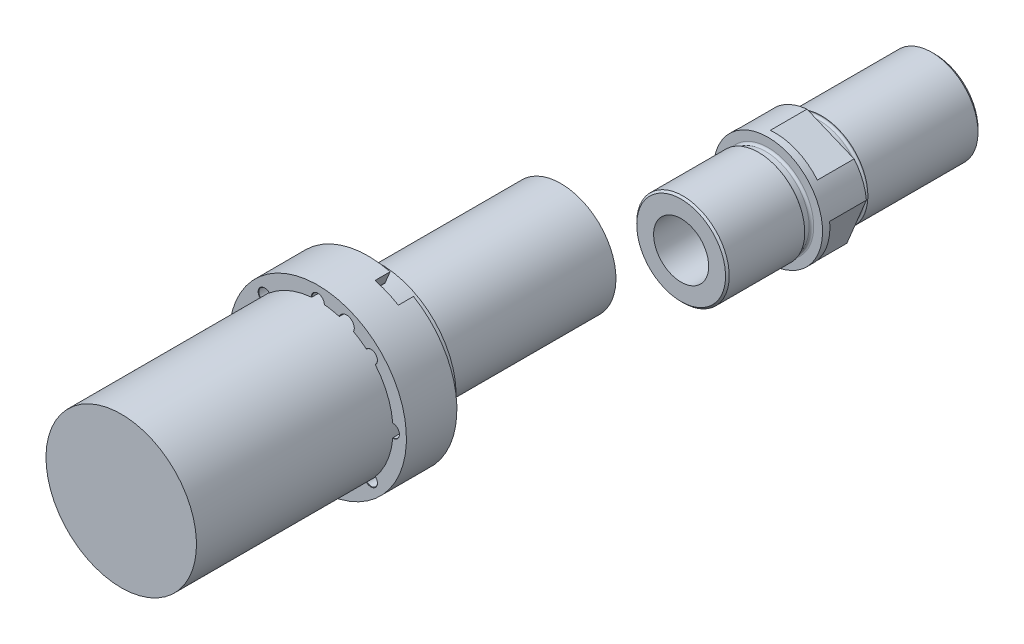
ISO-10303-21;
HEADER;
FILE_DESCRIPTION(('STEP AP214'),'2;1');
FILE_NAME('part.step','',(''),(''),'','','');
FILE_SCHEMA(('AUTOMOTIVE_DESIGN { 1 0 10303 214 1 1 1 1 }'));
ENDSEC;
DATA;
#1=APPLICATION_CONTEXT('core data for automotive mechanical design processes');
#2=APPLICATION_PROTOCOL_DEFINITION('international standard','automotive_design',2000,#1);
#3=PRODUCT_CONTEXT('',#1,'mechanical');
#4=PRODUCT('Part','Part','',(#3));
#5=PRODUCT_RELATED_PRODUCT_CATEGORY('part','',(#4));
#6=PRODUCT_DEFINITION_FORMATION('','',#4);
#7=PRODUCT_DEFINITION_CONTEXT('part definition',#1,'design');
#8=PRODUCT_DEFINITION('design','',#6,#7);
#9=PRODUCT_DEFINITION_SHAPE('','',#8);
#10=(LENGTH_UNIT() NAMED_UNIT(*) SI_UNIT(.MILLI.,.METRE.));
#11=(NAMED_UNIT(*) PLANE_ANGLE_UNIT() SI_UNIT($,.RADIAN.));
#12=(NAMED_UNIT(*) SI_UNIT($,.STERADIAN.) SOLID_ANGLE_UNIT());
#13=UNCERTAINTY_MEASURE_WITH_UNIT(LENGTH_MEASURE(1.E-05),#10,'distance_accuracy_value','');
#14=(GEOMETRIC_REPRESENTATION_CONTEXT(3) GLOBAL_UNCERTAINTY_ASSIGNED_CONTEXT((#13)) GLOBAL_UNIT_ASSIGNED_CONTEXT((#10,
#11,#12)) REPRESENTATION_CONTEXT('',''));
#15=CARTESIAN_POINT('',(0.,0.,0.));
#16=DIRECTION('',(0.,0.,1.));
#17=DIRECTION('',(1.,0.,0.));
#18=AXIS2_PLACEMENT_3D('',#15,#16,#17);
#19=CARTESIAN_POINT('',(0.,0.,145.54073));
#20=DIRECTION('',(0.,0.,-1.));
#21=DIRECTION('',(-0.923879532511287,0.382683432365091,0.));
#22=AXIS2_PLACEMENT_3D('',#19,#20,#21);
#23=CYLINDRICAL_SURFACE('',#22,52.07);
#24=CARTESIAN_POINT('',(0.,0.,-34.1122));
#25=DIRECTION('',(0.,0.,-1.));
#26=DIRECTION('',(-0.923879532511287,0.382683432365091,0.));
#27=AXIS2_PLACEMENT_3D('',#24,#25,#26);
#28=CIRCLE('',#27,52.07);
#29=CARTESIAN_POINT('',(-48.1064072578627,19.9263263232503,-34.1122));
#30=VERTEX_POINT('',#29);
#31=EDGE_CURVE('P0_E422',#30,#30,#28,.T.);
#32=ORIENTED_EDGE('',*,*,#31,.F.);
#33=EDGE_LOOP('',(#32));
#34=FACE_BOUND('',#33,.T.);
#35=CARTESIAN_POINT('',(0.,0.,-25.4));
#36=DIRECTION('',(0.,0.,-1.));
#37=DIRECTION('',(-0.923879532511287,0.382683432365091,0.));
#38=AXIS2_PLACEMENT_3D('',#35,#36,#37);
#39=CIRCLE('',#38,52.07);
#40=CARTESIAN_POINT('',(-27.705761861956,-44.0871371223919,-25.4));
#41=VERTEX_POINT('',#40);
#42=CARTESIAN_POINT('',(11.5833815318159,50.7652457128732,-25.4));
#43=VERTEX_POINT('',#42);
#44=EDGE_CURVE('P0_E352',#41,#43,#39,.T.);
#45=ORIENTED_EDGE('',*,*,#44,.T.);
#46=DIRECTION('',(0.,0.,-1.));
#47=VECTOR('',#46,1.);
#48=CARTESIAN_POINT('',(11.5833815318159,50.7652457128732,-24.511));
#49=LINE('',#48,#47);
#50=CARTESIAN_POINT('',(11.5833815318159,50.7652457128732,-14.9098));
#51=VERTEX_POINT('',#50);
#52=EDGE_CURVE('P0_E418',#43,#51,#49,.F.);
#53=ORIENTED_EDGE('',*,*,#52,.T.);
#54=CARTESIAN_POINT('',(0.,0.,-14.9098));
#55=DIRECTION('',(0.,0.,-1.));
#56=DIRECTION('',(-0.923879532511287,0.382683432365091,0.));
#57=AXIS2_PLACEMENT_3D('',#54,#55,#56);
#58=CIRCLE('',#57,52.07);
#59=CARTESIAN_POINT('',(14.87409674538,49.9003621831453,-14.9098));
#60=VERTEX_POINT('',#59);
#61=EDGE_CURVE('P0_E281',#60,#51,#58,.F.);
#62=ORIENTED_EDGE('',*,*,#61,.F.);
#63=DIRECTION('',(0.,0.,-1.));
#64=VECTOR('',#63,1.);
#65=CARTESIAN_POINT('',(14.87409674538,49.9003621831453,-2.6924));
#66=LINE('',#65,#64);
#67=CARTESIAN_POINT('',(14.87409674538,49.9003621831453,9.525));
#68=VERTEX_POINT('',#67);
#69=EDGE_CURVE('P0_E623',#60,#68,#66,.F.);
#70=ORIENTED_EDGE('',*,*,#69,.T.);
#71=CARTESIAN_POINT('',(0.,0.,9.525));
#72=DIRECTION('',(0.,0.,1.));
#73=DIRECTION('',(0.923879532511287,-0.382683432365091,0.));
#74=AXIS2_PLACEMENT_3D('',#71,#72,#73);
#75=CIRCLE('',#74,52.07);
#76=CARTESIAN_POINT('',(4.50226479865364,51.8749892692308,9.525));
#77=VERTEX_POINT('',#76);
#78=EDGE_CURVE('P0_E625',#77,#68,#75,.F.);
#79=ORIENTED_EDGE('',*,*,#78,.F.);
#80=CARTESIAN_POINT('',(4.2485367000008,51.8963855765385,9.2708));
#81=CARTESIAN_POINT('',(4.29086578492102,51.892920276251,9.31320093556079));
#82=CARTESIAN_POINT('',(4.33319096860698,51.8894031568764,9.35560140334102));
#83=CARTESIAN_POINT('',(4.41783353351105,51.8822652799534,9.44040140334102));
#84=CARTESIAN_POINT('',(4.46015091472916,51.8786445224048,9.48280093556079));
#85=CARTESIAN_POINT('',(4.50246439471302,51.8749719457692,9.5252));
#86=B_SPLINE_CURVE_WITH_KNOTS('',3,(#80,#81,#82,#83,#84,#85),.UNSPECIFIED.,.F.,.F.,(4,2,4),(0.,
0.180039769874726,0.360079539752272),.UNSPECIFIED.);
#87=CARTESIAN_POINT('',(4.24873636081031,51.8963692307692,9.271));
#88=VERTEX_POINT('',#87);
#89=EDGE_CURVE('P0_E426',#88,#77,#86,.T.);
#90=ORIENTED_EDGE('',*,*,#89,.F.);
#91=DIRECTION('',(0.,0.,1.));
#92=VECTOR('',#91,1.);
#93=CARTESIAN_POINT('',(4.2487363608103,51.8963692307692,-6.2611));
#94=LINE('',#93,#92);
#95=CARTESIAN_POINT('',(4.2487363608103,51.8963692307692,-21.7932));
#96=VERTEX_POINT('',#95);
#97=EDGE_CURVE('P0_E451',#88,#96,#94,.F.);
#98=ORIENTED_EDGE('',*,*,#97,.T.);
#99=CARTESIAN_POINT('',(4.24906865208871,51.8963420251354,-21.793));
#100=CARTESIAN_POINT('',(3.90149580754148,51.9248000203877,-22.0021869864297));
#101=CARTESIAN_POINT('',(3.55365753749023,51.9497643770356,-22.2114159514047));
#102=CARTESIAN_POINT('',(2.85761297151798,51.9926966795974,-22.6298642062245));
#103=CARTESIAN_POINT('',(2.50940673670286,52.0106656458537,-22.8390834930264));
#104=CARTESIAN_POINT('',(1.98418605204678,52.0324825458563,-23.1544909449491));
#105=CARTESIAN_POINT('',(1.80728542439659,52.0389273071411,-23.2606947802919));
#106=CARTESIAN_POINT('',(1.45339573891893,52.0500133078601,-23.4730768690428));
#107=CARTESIAN_POINT('',(1.27640667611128,52.0546544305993,-23.5792551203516));
#108=CARTESIAN_POINT('',(1.0096623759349,52.0602874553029,-23.7391227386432));
#109=CARTESIAN_POINT('',(0.919951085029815,52.0619500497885,-23.7928627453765));
#110=CARTESIAN_POINT('',(0.740473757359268,52.0648120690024,-23.9002654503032));
#111=CARTESIAN_POINT('',(0.65070772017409,52.0660114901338,-23.9539281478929));
#112=CARTESIAN_POINT('',(0.515013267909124,52.0674731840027,-24.034782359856));
#113=CARTESIAN_POINT('',(0.469143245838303,52.0679067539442,-24.062068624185));
#114=CARTESIAN_POINT('',(0.400253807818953,52.0684666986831,-24.1028781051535));
#115=CARTESIAN_POINT('',(0.377271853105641,52.0686383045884,-24.1164640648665));
#116=CARTESIAN_POINT('',(0.331264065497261,52.0689513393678,-24.1435671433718));
#117=CARTESIAN_POINT('',(0.308238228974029,52.0690927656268,-24.1570842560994));
#118=CARTESIAN_POINT('',(0.261298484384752,52.0693498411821,-24.1844536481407));
#119=CARTESIAN_POINT('',(0.237381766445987,52.0694644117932,-24.1983010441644));
#120=CARTESIAN_POINT('',(0.189382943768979,52.0696611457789,-24.2257060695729));
#121=CARTESIAN_POINT('',(0.165300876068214,52.0697433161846,-24.2392637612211));
#122=CARTESIAN_POINT('',(0.127775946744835,52.0698448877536,-24.2594268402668));
#123=CARTESIAN_POINT('',(0.114514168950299,52.069875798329,-24.2663713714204));
#124=CARTESIAN_POINT('',(0.0876037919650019,52.0699280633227,-24.279677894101));
#125=CARTESIAN_POINT('',(0.0739537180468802,52.0699493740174,-24.2860371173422));
#126=CARTESIAN_POINT('',(0.0518961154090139,52.0699747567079,-24.2946360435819));
#127=CARTESIAN_POINT('',(0.0437333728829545,52.0699823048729,-24.2974764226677));
#128=CARTESIAN_POINT('',(0.0271551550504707,52.0699935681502,-24.3019622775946));
#129=CARTESIAN_POINT('',(0.0187439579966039,52.0699973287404,-24.3036218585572));
#130=CARTESIAN_POINT('',(0.00158379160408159,52.0700006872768,-24.305091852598));
#131=CARTESIAN_POINT('',(-0.00716852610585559,52.0700002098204,-24.3048687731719));
#132=CARTESIAN_POINT('',(-0.0244975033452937,52.069994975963,-24.3026040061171));
#133=CARTESIAN_POINT('',(-0.0330709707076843,52.069990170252,-24.3005413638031));
#134=CARTESIAN_POINT('',(-0.0545197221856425,52.0699731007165,-24.2939977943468));
#135=CARTESIAN_POINT('',(-0.0671558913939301,52.0699581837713,-24.2888104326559));
#136=CARTESIAN_POINT('',(-0.0920482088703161,52.0699201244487,-24.2775678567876));
#137=CARTESIAN_POINT('',(-0.104302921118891,52.0698969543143,-24.2715097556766));
#138=CARTESIAN_POINT('',(-0.128686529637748,52.0698424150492,-24.2589624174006));
#139=CARTESIAN_POINT('',(-0.140814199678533,52.0698109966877,-24.2524707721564));
#140=CARTESIAN_POINT('',(-0.164936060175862,52.0697401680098,-24.2393001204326));
#141=CARTESIAN_POINT('',(-0.176930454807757,52.0697007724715,-24.2326214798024));
#142=CARTESIAN_POINT('',(-0.212491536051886,52.0695717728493,-24.212604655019));
#143=CARTESIAN_POINT('',(-0.235968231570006,52.069470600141,-24.1991065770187));
#144=CARTESIAN_POINT('',(-0.28282199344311,52.0692371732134,-24.1719386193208));
#145=CARTESIAN_POINT('',(-0.306199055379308,52.0691049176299,-24.1582687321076));
#146=CARTESIAN_POINT('',(-0.376288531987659,52.0686613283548,-24.1171076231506));
#147=CARTESIAN_POINT('',(-0.42292381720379,52.0683033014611,-24.0894854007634));
#148=CARTESIAN_POINT('',(-0.51585693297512,52.067465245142,-24.0342850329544));
#149=CARTESIAN_POINT('',(-0.562155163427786,52.0669859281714,-24.006707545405));
#150=CARTESIAN_POINT('',(-0.654702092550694,52.065904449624,-23.9514989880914));
#151=CARTESIAN_POINT('',(-0.700950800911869,52.065302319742,-23.9238679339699));
#152=CARTESIAN_POINT('',(-0.932461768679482,52.0619798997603,-23.7854587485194));
#153=CARTESIAN_POINT('',(-1.11759022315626,52.0583344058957,-23.6744774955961));
#154=CARTESIAN_POINT('',(-1.4877804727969,52.0490699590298,-23.452443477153));
#155=CARTESIAN_POINT('',(-1.67284225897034,52.0434507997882,-23.3413907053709));
#156=CARTESIAN_POINT('',(-2.04328676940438,52.0302249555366,-23.1190101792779));
#157=CARTESIAN_POINT('',(-2.22866929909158,52.0226139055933,-23.0076823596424));
#158=CARTESIAN_POINT('',(-2.59933460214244,52.0054110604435,-22.785026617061));
#159=CARTESIAN_POINT('',(-2.78461737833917,51.995819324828,-22.6736986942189));
#160=CARTESIAN_POINT('',(-3.18338262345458,51.9730384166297,-22.4340317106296));
#161=CARTESIAN_POINT('',(-3.39684693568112,51.9595234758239,-22.3056932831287));
#162=CARTESIAN_POINT('',(-3.82326382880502,51.9298869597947,-22.0492328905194));
#163=CARTESIAN_POINT('',(-4.03621668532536,51.9137695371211,-21.921110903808));
#164=CARTESIAN_POINT('',(-4.24906865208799,51.8963420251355,-21.793));
#165=B_SPLINE_CURVE_WITH_KNOTS('',3,(#99,#100,#101,#102,#103,#104,#105,#106,#107,#108,#109,#110,
#111,#112,#113,#114,#115,#116,#117,#118,#119,#120,#121,#122,#123,#124,#125,#126,#127,#128,#129,
#130,#131,#132,#133,#134,#135,#136,#137,#138,#139,#140,#141,#142,#143,#144,#145,#146,#147,#148,
#149,#150,#151,#152,#153,#154,#155,#156,#157,#158,#159,#160,#161,#162,#163,#164),.UNSPECIFIED.,
.F.,.F.,(4,2,2,2,2,2,2,2,2,2,2,2,2,2,2,2,2,2,2,2,2,2,2,2,2,2,2,2,2,2,2,2,4),(0.,
1.21998606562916,2.43979411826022,3.05908695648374,3.67841985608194,3.99218617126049,
4.30595492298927,4.46607656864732,4.54617038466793,4.62627113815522,4.70918269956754,
4.79207625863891,4.83698795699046,4.88210219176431,4.90799105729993,4.93356522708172,
4.95959530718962,4.98592574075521,5.02679744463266,5.06780792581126,5.10906898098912,
5.15025428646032,5.23149325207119,5.31273578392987,5.47534353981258,5.63701745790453,
5.79864970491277,6.44626883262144,7.09395565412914,7.743073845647,8.3921725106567,
9.14047895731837,9.88760298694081),.UNSPECIFIED.);
#166=CARTESIAN_POINT('',(-4.24873636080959,51.8963692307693,-21.7932));
#167=VERTEX_POINT('',#166);
#168=EDGE_CURVE('P0_E628',#96,#167,#165,.T.);
#169=ORIENTED_EDGE('',*,*,#168,.T.);
#170=DIRECTION('',(0.,0.,1.));
#171=VECTOR('',#170,1.);
#172=CARTESIAN_POINT('',(-4.24873636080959,51.8963692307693,-6.2611));
#173=LINE('',#172,#171);
#174=CARTESIAN_POINT('',(-4.24873636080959,51.8963692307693,9.271));
#175=VERTEX_POINT('',#174);
#176=EDGE_CURVE('P0_E622',#167,#175,#173,.T.);
#177=ORIENTED_EDGE('',*,*,#176,.T.);
#178=CARTESIAN_POINT('',(-4.5024643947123,51.8749719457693,9.5252));
#179=CARTESIAN_POINT('',(-4.46015091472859,51.8786445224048,9.48280093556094));
#180=CARTESIAN_POINT('',(-4.41783353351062,51.8822652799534,9.44040140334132));
#181=CARTESIAN_POINT('',(-4.33319096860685,51.8894031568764,9.35560140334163));
#182=CARTESIAN_POINT('',(-4.29086578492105,51.8929202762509,9.31320093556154));
#183=CARTESIAN_POINT('',(-4.24853670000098,51.8963855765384,9.2708000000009));
#184=B_SPLINE_CURVE_WITH_KNOTS('',3,(#178,#179,#180,#181,#182,#183),.UNSPECIFIED.,.F.,.F.,(4,2,
4),(0.,0.180039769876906,0.360079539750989),.UNSPECIFIED.);
#185=CARTESIAN_POINT('',(-4.50226479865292,51.8749892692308,9.525));
#186=VERTEX_POINT('',#185);
#187=EDGE_CURVE('P0_E471',#186,#175,#184,.T.);
#188=ORIENTED_EDGE('',*,*,#187,.F.);
#189=CARTESIAN_POINT('',(-33.497574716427,39.8647386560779,9.525));
#190=VERTEX_POINT('',#189);
#191=EDGE_CURVE('P0_E479',#190,#186,#75,.F.);
#192=ORIENTED_EDGE('',*,*,#191,.F.);
#193=CARTESIAN_POINT('',(-33.6921170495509,39.7004552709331,9.2708000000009));
#194=CARTESIAN_POINT('',(-33.6597355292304,39.7279361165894,9.31320093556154));
#195=CARTESIAN_POINT('',(-33.6273201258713,39.7553775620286,9.35560140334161));
#196=CARTESIAN_POINT('',(-33.5624215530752,39.8101816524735,9.44040140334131));
#197=CARTESIAN_POINT('',(-33.5299383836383,39.8375442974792,9.48280093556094));
#198=CARTESIAN_POINT('',(-33.4974213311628,39.8648675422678,9.5252));
#199=B_SPLINE_CURVE_WITH_KNOTS('',3,(#193,#194,#195,#196,#197,#198),.UNSPECIFIED.,.F.,.F.,(4,2,
4),(0.,0.180039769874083,0.360079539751),.UNSPECIFIED.);
#200=CARTESIAN_POINT('',(-33.6919643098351,39.7005848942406,9.271));
#201=VERTEX_POINT('',#200);
#202=EDGE_CURVE('P0_E481',#201,#190,#199,.T.);
#203=ORIENTED_EDGE('',*,*,#202,.F.);
#204=DIRECTION('',(0.,0.,1.));
#205=VECTOR('',#204,1.);
#206=CARTESIAN_POINT('',(-33.6919643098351,39.7005848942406,-6.2611));
#207=LINE('',#206,#205);
#208=CARTESIAN_POINT('',(-33.6919643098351,39.7005848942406,-21.7932));
#209=VERTEX_POINT('',#208);
#210=EDGE_CURVE('P0_E489',#201,#209,#207,.F.);
#211=ORIENTED_EDGE('',*,*,#210,.T.);
#212=CARTESIAN_POINT('',(-33.6917101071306,39.7008006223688,-21.793));
#213=CARTESIAN_POINT('',(-33.9576040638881,39.475152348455,-22.0021869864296));
#214=CARTESIAN_POINT('',(-34.2212153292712,39.2468460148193,-22.2114159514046));
#215=CARTESIAN_POINT('',(-34.7437508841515,38.7850259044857,-22.6298642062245));
#216=CARTESIAN_POINT('',(-35.0026758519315,38.5515128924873,-22.8390834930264));
#217=CARTESIAN_POINT('',(-35.3894898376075,38.1955526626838,-23.154490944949));
#218=CARTESIAN_POINT('',(-35.5191346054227,38.0750221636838,-23.2606947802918));
#219=CARTESIAN_POINT('',(-35.7772113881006,37.8326233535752,-23.4730768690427));
#220=CARTESIAN_POINT('',(-35.905643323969,37.7107549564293,-23.5792551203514));
#221=CARTESIAN_POINT('',(-36.0982431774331,37.5261214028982,-23.7391227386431));
#222=CARTESIAN_POINT('',(-36.1628542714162,37.4638615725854,-23.7928627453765));
#223=CARTESIAN_POINT('',(-36.2917876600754,37.3389756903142,-23.9002654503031));
#224=CARTESIAN_POINT('',(-36.3561099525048,37.2763496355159,-23.9539281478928));
#225=CARTESIAN_POINT('',(-36.4530939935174,37.1814327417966,-24.034782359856));
#226=CARTESIAN_POINT('',(-36.4858355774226,37.1493043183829,-24.062068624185));
#227=CARTESIAN_POINT('',(-36.5349437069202,37.1009880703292,-24.1028781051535));
#228=CARTESIAN_POINT('',(-36.5513157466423,37.0848587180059,-24.1164640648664));
#229=CARTESIAN_POINT('',(-36.5840695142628,37.0525476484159,-24.1435671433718));
#230=CARTESIAN_POINT('',(-36.6004512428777,37.0363659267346,-24.1570842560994));
#231=CARTESIAN_POINT('',(-36.6338244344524,37.0033562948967,-24.1844536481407));
#232=CARTESIAN_POINT('',(-36.6508171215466,36.9865256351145,-24.1983010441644));
#233=CARTESIAN_POINT('',(-36.6848965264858,36.952724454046,-24.2257060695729));
#234=CARTESIAN_POINT('',(-36.7019832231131,36.9357539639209,-24.2392637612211));
#235=CARTESIAN_POINT('',(-36.7285891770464,36.909291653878,-24.2594268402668));
#236=CARTESIAN_POINT('',(-36.7379885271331,36.8999360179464,-24.2663713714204));
#237=CARTESIAN_POINT('',(-36.7570539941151,36.8809444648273,-24.279677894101));
#238=CARTESIAN_POINT('',(-36.766721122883,36.8713074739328,-24.2860371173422));
#239=CARTESIAN_POINT('',(-36.7823361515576,36.8557283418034,-24.2946360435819));
#240=CARTESIAN_POINT('',(-36.7881134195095,36.8499617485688,-24.2974764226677));
#241=CARTESIAN_POINT('',(-36.7998439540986,36.8382471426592,-24.3019622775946));
#242=CARTESIAN_POINT('',(-36.8057942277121,36.8323021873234,-24.3036218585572));
#243=CARTESIAN_POINT('',(-36.8179306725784,36.8201704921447,-24.305091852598));
#244=CARTESIAN_POINT('',(-36.8241191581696,36.8139813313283,-24.3048687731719));
#245=CARTESIAN_POINT('',(-36.8363688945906,36.8017241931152,-24.3026040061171));
#246=CARTESIAN_POINT('',(-36.84242785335,36.7956584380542,-24.300541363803));
#247=CARTESIAN_POINT('',(-36.8575823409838,36.7804798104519,-24.2939977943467));
#248=CARTESIAN_POINT('',(-36.866506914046,36.7715341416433,-24.2888104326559));
#249=CARTESIAN_POINT('',(-36.8840815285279,36.7539057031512,-24.2775678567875));
#250=CARTESIAN_POINT('',(-36.8927305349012,36.7452239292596,-24.2715097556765));
#251=CARTESIAN_POINT('',(-36.9099337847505,36.7279435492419,-24.2589624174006));
#252=CARTESIAN_POINT('',(-36.9184871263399,36.7193457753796,-24.2524707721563));
#253=CARTESIAN_POINT('',(-36.9354937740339,36.7022389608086,-24.2393001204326));
#254=CARTESIAN_POINT('',(-36.9439472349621,36.6937297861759,-24.2326214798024));
#255=CARTESIAN_POINT('',(-36.9690015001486,36.6684930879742,-24.212604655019));
#256=CARTESIAN_POINT('',(-36.9855304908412,36.6518210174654,-24.1991065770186));
#257=CARTESIAN_POINT('',(-37.0184960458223,36.6185253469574,-24.1719386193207));
#258=CARTESIAN_POINT('',(-37.0349326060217,36.6019017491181,-24.1582687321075));
#259=CARTESIAN_POINT('',(-37.0841796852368,36.552027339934,-24.1171076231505));
#260=CARTESIAN_POINT('',(-37.1169026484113,36.5187980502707,-24.0894854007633));
#261=CARTESIAN_POINT('',(-37.1820236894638,36.4524918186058,-24.0342850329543));
#262=CARTESIAN_POINT('',(-37.2144225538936,36.4194150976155,-24.0067075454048));
#263=CARTESIAN_POINT('',(-37.2790983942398,36.3532098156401,-23.9514989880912));
#264=CARTESIAN_POINT('',(-37.3113753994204,36.320081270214,-23.9238679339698));
#265=CARTESIAN_POINT('',(-37.472729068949,36.1540289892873,-23.7854587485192));
#266=CARTESIAN_POINT('',(-37.6010569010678,36.0205456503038,-23.6744774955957));
#267=CARTESIAN_POINT('',(-37.8562699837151,35.7522306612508,-23.4524434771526));
#268=CARTESIAN_POINT('',(-37.9831550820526,35.6173988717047,-23.3413907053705));
#269=CARTESIAN_POINT('',(-38.2357468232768,35.3461029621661,-23.1190101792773));
#270=CARTESIAN_POINT('',(-38.3614502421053,35.2096358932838,-23.0076823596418));
#271=CARTESIAN_POINT('',(-38.6113859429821,34.9353716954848,-22.7850266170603));
#272=CARTESIAN_POINT('',(-38.7356182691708,34.7975746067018,-22.6736986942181));
#273=CARTESIAN_POINT('',(-39.0014793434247,34.4994964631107,-22.4340317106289));
#274=CARTESIAN_POINT('',(-39.1428648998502,34.3389978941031,-22.3056932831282));
#275=CARTESIAN_POINT('',(-39.4234309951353,34.016519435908,-22.0492328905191));
#276=CARTESIAN_POINT('',(-39.5626146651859,33.8545422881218,-21.9211109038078));
#277=CARTESIAN_POINT('',(-39.7008006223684,33.6917101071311,-21.793));
#278=B_SPLINE_CURVE_WITH_KNOTS('',3,(#212,#213,#214,#215,#216,#217,#218,#219,#220,#221,#222,
#223,#224,#225,#226,#227,#228,#229,#230,#231,#232,#233,#234,#235,#236,#237,#238,#239,#240,#241,
#242,#243,#244,#245,#246,#247,#248,#249,#250,#251,#252,#253,#254,#255,#256,#257,#258,#259,#260,
#261,#262,#263,#264,#265,#266,#267,#268,#269,#270,#271,#272,#273,#274,#275,#276,#277),
.UNSPECIFIED.,.F.,.F.,(4,2,2,2,2,2,2,2,2,2,2,2,2,2,2,2,2,2,2,2,2,2,2,2,2,2,2,2,2,2,2,2,4),(0.,
1.21998606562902,2.43979411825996,3.05908695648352,3.67841985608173,3.99218617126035,
4.30595492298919,4.46607656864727,4.5461703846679,4.6262711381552,4.70918269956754,
4.79207625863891,4.83698795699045,4.88210219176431,4.90799105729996,4.93356522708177,
4.95959530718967,4.98592574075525,5.02679744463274,5.06780792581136,5.10906898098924,
5.15025428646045,5.23149325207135,5.31273578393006,5.47534353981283,5.63701745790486,
5.79864970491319,6.44626883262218,7.0939556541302,7.74307384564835,8.39217251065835,
9.14047895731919,9.88760298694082),.UNSPECIFIED.);
#279=CARTESIAN_POINT('',(-39.7005848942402,33.6919643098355,-21.7932));
#280=VERTEX_POINT('',#279);
#281=EDGE_CURVE('P0_E551',#209,#280,#278,.T.);
#282=ORIENTED_EDGE('',*,*,#281,.T.);
#283=DIRECTION('',(0.,0.,1.));
#284=VECTOR('',#283,1.);
#285=CARTESIAN_POINT('',(-39.7005848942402,33.6919643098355,-6.2611));
#286=LINE('',#285,#284);
#287=CARTESIAN_POINT('',(-39.7005848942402,33.6919643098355,9.271));
#288=VERTEX_POINT('',#287);
#289=EDGE_CURVE('P0_E515',#280,#288,#286,.T.);
#290=ORIENTED_EDGE('',*,*,#289,.T.);
#291=CARTESIAN_POINT('',(-39.8648675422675,33.4974213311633,9.5252));
#292=CARTESIAN_POINT('',(-39.8375442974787,33.5299383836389,9.4828009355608));
#293=CARTESIAN_POINT('',(-39.8101816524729,33.5624215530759,9.44040140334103));
#294=CARTESIAN_POINT('',(-39.7553775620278,33.6273201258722,9.35560140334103));
#295=CARTESIAN_POINT('',(-39.7279361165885,33.6597355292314,9.3132009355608));
#296=CARTESIAN_POINT('',(-39.7004552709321,33.6921170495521,9.2708));
#297=B_SPLINE_CURVE_WITH_KNOTS('',3,(#291,#292,#293,#294,#295,#296),.UNSPECIFIED.,.F.,.F.,(4,2,
4),(0.,0.180039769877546,0.360079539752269),.UNSPECIFIED.);
#298=CARTESIAN_POINT('',(-39.8647386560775,33.4975747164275,9.525));
#299=VERTEX_POINT('',#298);
#300=EDGE_CURVE('P0_E506',#299,#288,#297,.T.);
#301=ORIENTED_EDGE('',*,*,#300,.F.);
#302=CARTESIAN_POINT('',(-51.8749892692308,4.50226479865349,9.525));
#303=VERTEX_POINT('',#302);
#304=EDGE_CURVE('P0_E514',#303,#299,#75,.F.);
#305=ORIENTED_EDGE('',*,*,#304,.F.);
#306=CARTESIAN_POINT('',(-51.8963855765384,4.24853670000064,9.2708));
#307=CARTESIAN_POINT('',(-51.8929202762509,4.29086578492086,9.31320093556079));
#308=CARTESIAN_POINT('',(-51.8894031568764,4.33319096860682,9.35560140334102));
#309=CARTESIAN_POINT('',(-51.8822652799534,4.41783353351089,9.44040140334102));
#310=CARTESIAN_POINT('',(-51.8786445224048,4.460150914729,9.48280093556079));
#311=CARTESIAN_POINT('',(-51.8749719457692,4.50246439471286,9.5252));
#312=B_SPLINE_CURVE_WITH_KNOTS('',3,(#306,#307,#308,#309,#310,#311),.UNSPECIFIED.,.F.,.F.,(4,2,
4),(0.,0.180039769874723,0.360079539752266),.UNSPECIFIED.);
#313=CARTESIAN_POINT('',(-51.8963692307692,4.24873636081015,9.271));
#314=VERTEX_POINT('',#313);
#315=EDGE_CURVE('P0_E516',#314,#303,#312,.T.);
#316=ORIENTED_EDGE('',*,*,#315,.F.);
#317=DIRECTION('',(0.,0.,1.));
#318=VECTOR('',#317,1.);
#319=CARTESIAN_POINT('',(-51.8963692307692,4.24873636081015,-6.2611));
#320=LINE('',#319,#318);
#321=CARTESIAN_POINT('',(-51.8963692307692,4.24873636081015,-21.7932));
#322=VERTEX_POINT('',#321);
#323=EDGE_CURVE('P0_E523',#314,#322,#320,.F.);
#324=ORIENTED_EDGE('',*,*,#323,.T.);
#325=CARTESIAN_POINT('',(-51.8963420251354,4.24906865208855,-21.793));
#326=CARTESIAN_POINT('',(-51.9248000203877,3.90149580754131,-22.0021869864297));
#327=CARTESIAN_POINT('',(-51.9497643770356,3.55365753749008,-22.2114159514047));
#328=CARTESIAN_POINT('',(-51.9926966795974,2.85761297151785,-22.6298642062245));
#329=CARTESIAN_POINT('',(-52.0106656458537,2.50940673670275,-22.8390834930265));
#330=CARTESIAN_POINT('',(-52.0324825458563,1.98418605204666,-23.1544909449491));
#331=CARTESIAN_POINT('',(-52.0389273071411,1.80728542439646,-23.2606947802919));
#332=CARTESIAN_POINT('',(-52.0500133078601,1.4533957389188,-23.4730768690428));
#333=CARTESIAN_POINT('',(-52.0546544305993,1.27640667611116,-23.5792551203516));
#334=CARTESIAN_POINT('',(-52.0602874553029,1.00966237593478,-23.7391227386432));
#335=CARTESIAN_POINT('',(-52.0619500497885,0.919951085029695,-23.7928627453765));
#336=CARTESIAN_POINT('',(-52.0648120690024,0.740473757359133,-23.9002654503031));
#337=CARTESIAN_POINT('',(-52.0660114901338,0.65070772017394,-23.9539281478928));
#338=CARTESIAN_POINT('',(-52.0674731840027,0.515013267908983,-24.034782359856));
#339=CARTESIAN_POINT('',(-52.0679067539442,0.469143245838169,-24.062068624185));
#340=CARTESIAN_POINT('',(-52.0684666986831,0.400253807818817,-24.1028781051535));
#341=CARTESIAN_POINT('',(-52.0686383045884,0.377271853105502,-24.1164640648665));
#342=CARTESIAN_POINT('',(-52.0689513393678,0.331264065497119,-24.1435671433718));
#343=CARTESIAN_POINT('',(-52.0690927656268,0.308238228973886,-24.1570842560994));
#344=CARTESIAN_POINT('',(-52.0693498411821,0.261298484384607,-24.1844536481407));
#345=CARTESIAN_POINT('',(-52.0694644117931,0.23738176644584,-24.1983010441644));
#346=CARTESIAN_POINT('',(-52.0696611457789,0.18938294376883,-24.2257060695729));
#347=CARTESIAN_POINT('',(-52.0697433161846,0.165300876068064,-24.2392637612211));
#348=CARTESIAN_POINT('',(-52.0698448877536,0.127775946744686,-24.2594268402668));
#349=CARTESIAN_POINT('',(-52.069875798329,0.11451416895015,-24.2663713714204));
#350=CARTESIAN_POINT('',(-52.0699280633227,0.0876037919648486,-24.279677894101));
#351=CARTESIAN_POINT('',(-52.0699493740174,0.073953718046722,-24.2860371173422));
#352=CARTESIAN_POINT('',(-52.0699747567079,0.0518961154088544,-24.2946360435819));
#353=CARTESIAN_POINT('',(-52.0699823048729,0.0437333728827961,-24.2974764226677));
#354=CARTESIAN_POINT('',(-52.0699935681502,0.0271551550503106,-24.3019622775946));
#355=CARTESIAN_POINT('',(-52.0699973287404,0.018743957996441,-24.3036218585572));
#356=CARTESIAN_POINT('',(-52.0700006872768,0.0015837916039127,-24.305091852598));
#357=CARTESIAN_POINT('',(-52.0700002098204,-0.00716852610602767,-24.3048687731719));
#358=CARTESIAN_POINT('',(-52.069994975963,-0.0244975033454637,-24.3026040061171));
#359=CARTESIAN_POINT('',(-52.069990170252,-0.0330709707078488,-24.300541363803));
#360=CARTESIAN_POINT('',(-52.0699731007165,-0.0545197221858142,-24.2939977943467));
#361=CARTESIAN_POINT('',(-52.0699581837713,-0.0671558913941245,-24.2888104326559));
#362=CARTESIAN_POINT('',(-52.0699201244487,-0.0920482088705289,-24.2775678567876));
#363=CARTESIAN_POINT('',(-52.0698969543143,-0.1043029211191,-24.2715097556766));
#364=CARTESIAN_POINT('',(-52.0698424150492,-0.128686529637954,-24.2589624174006));
#365=CARTESIAN_POINT('',(-52.0698109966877,-0.140814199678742,-24.2524707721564));
#366=CARTESIAN_POINT('',(-52.0697401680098,-0.164936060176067,-24.2393001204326));
#367=CARTESIAN_POINT('',(-52.0697007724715,-0.176930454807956,-24.2326214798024));
#368=CARTESIAN_POINT('',(-52.0695717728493,-0.212491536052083,-24.212604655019));
#369=CARTESIAN_POINT('',(-52.069470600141,-0.235968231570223,-24.1991065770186));
#370=CARTESIAN_POINT('',(-52.0692371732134,-0.282821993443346,-24.1719386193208));
#371=CARTESIAN_POINT('',(-52.0691049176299,-0.306199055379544,-24.1582687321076));
#372=CARTESIAN_POINT('',(-52.0686613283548,-0.3762885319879,-24.1171076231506));
#373=CARTESIAN_POINT('',(-52.068303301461,-0.422923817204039,-24.0894854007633));
#374=CARTESIAN_POINT('',(-52.067465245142,-0.515856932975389,-24.0342850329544));
#375=CARTESIAN_POINT('',(-52.0669859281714,-0.562155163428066,-24.0067075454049));
#376=CARTESIAN_POINT('',(-52.065904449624,-0.654702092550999,-23.9514989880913));
#377=CARTESIAN_POINT('',(-52.065302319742,-0.700950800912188,-23.9238679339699));
#378=CARTESIAN_POINT('',(-52.0619798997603,-0.932461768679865,-23.7854587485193));
#379=CARTESIAN_POINT('',(-52.0583344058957,-1.11759022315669,-23.6744774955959));
#380=CARTESIAN_POINT('',(-52.0490699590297,-1.48778047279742,-23.4524434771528));
#381=CARTESIAN_POINT('',(-52.0434507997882,-1.67284225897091,-23.3413907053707));
#382=CARTESIAN_POINT('',(-52.0302249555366,-2.04328676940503,-23.1190101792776));
#383=CARTESIAN_POINT('',(-52.0226139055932,-2.22866929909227,-23.0076823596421));
#384=CARTESIAN_POINT('',(-52.0054110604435,-2.59933460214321,-22.7850266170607));
#385=CARTESIAN_POINT('',(-51.9958193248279,-2.78461737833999,-22.6736986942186));
#386=CARTESIAN_POINT('',(-51.9730384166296,-3.18338262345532,-22.4340317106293));
#387=CARTESIAN_POINT('',(-51.9595234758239,-3.39684693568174,-22.3056932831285));
#388=CARTESIAN_POINT('',(-51.9298869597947,-3.8232638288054,-22.0492328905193));
#389=CARTESIAN_POINT('',(-51.913769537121,-4.03621668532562,-21.9211109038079));
#390=CARTESIAN_POINT('',(-51.8963420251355,-4.24906865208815,-21.793));
#391=B_SPLINE_CURVE_WITH_KNOTS('',3,(#325,#326,#327,#328,#329,#330,#331,#332,#333,#334,#335,
#336,#337,#338,#339,#340,#341,#342,#343,#344,#345,#346,#347,#348,#349,#350,#351,#352,#353,#354,
#355,#356,#357,#358,#359,#360,#361,#362,#363,#364,#365,#366,#367,#368,#369,#370,#371,#372,#373,
#374,#375,#376,#377,#378,#379,#380,#381,#382,#383,#384,#385,#386,#387,#388,#389,#390),
.UNSPECIFIED.,.F.,.F.,(4,2,2,2,2,2,2,2,2,2,2,2,2,2,2,2,2,2,2,2,2,2,2,2,2,2,2,2,2,2,2,2,4),(0.,
1.21998606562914,2.43979411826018,3.05908695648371,3.6784198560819,3.99218617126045,
4.30595492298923,4.46607656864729,4.54617038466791,4.6262711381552,4.70918269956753,
4.7920762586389,4.83698795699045,4.88210219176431,4.90799105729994,4.93356522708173,
4.95959530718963,4.98592574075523,5.0267974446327,5.06780792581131,5.10906898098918,
5.15025428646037,5.23149325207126,5.31273578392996,5.47534353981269,5.63701745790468,
5.79864970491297,6.44626883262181,7.09395565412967,7.74307384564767,8.39217251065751,
9.14047895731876,9.88760298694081),.UNSPECIFIED.);
#392=CARTESIAN_POINT('',(-51.8963692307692,-4.24873636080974,-21.7932));
#393=VERTEX_POINT('',#392);
#394=EDGE_CURVE('P0_E525',#322,#393,#391,.T.);
#395=ORIENTED_EDGE('',*,*,#394,.T.);
#396=DIRECTION('',(0.,0.,1.));
#397=VECTOR('',#396,1.);
#398=CARTESIAN_POINT('',(-51.8963692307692,-4.24873636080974,-6.2611));
#399=LINE('',#398,#397);
#400=CARTESIAN_POINT('',(-51.8963692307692,-4.24873636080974,9.271));
#401=VERTEX_POINT('',#400);
#402=EDGE_CURVE('P0_E532',#393,#401,#399,.T.);
#403=ORIENTED_EDGE('',*,*,#402,.T.);
#404=CARTESIAN_POINT('',(-51.8749719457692,-4.50246439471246,9.5252));
#405=CARTESIAN_POINT('',(-51.8786445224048,-4.46015091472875,9.48280093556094));
#406=CARTESIAN_POINT('',(-51.8822652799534,-4.41783353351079,9.44040140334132));
#407=CARTESIAN_POINT('',(-51.8894031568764,-4.33319096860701,9.35560140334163));
#408=CARTESIAN_POINT('',(-51.8929202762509,-4.2908657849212,9.31320093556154));
#409=CARTESIAN_POINT('',(-51.8963855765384,-4.24853670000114,9.2708000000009));
#410=B_SPLINE_CURVE_WITH_KNOTS('',3,(#404,#405,#406,#407,#408,#409),.UNSPECIFIED.,.F.,.F.,(4,2,
4),(0.,0.18003976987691,0.360079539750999),.UNSPECIFIED.);
#411=CARTESIAN_POINT('',(-51.8749892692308,-4.50226479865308,9.525));
#412=VERTEX_POINT('',#411);
#413=EDGE_CURVE('P0_E784',#412,#401,#410,.T.);
#414=ORIENTED_EDGE('',*,*,#413,.F.);
#415=CARTESIAN_POINT('',(-39.8647386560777,-33.4975747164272,9.525));
#416=VERTEX_POINT('',#415);
#417=EDGE_CURVE('P0_E753',#416,#412,#75,.F.);
#418=ORIENTED_EDGE('',*,*,#417,.F.);
#419=CARTESIAN_POINT('',(-39.7004552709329,-33.6921170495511,9.27080000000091));
#420=CARTESIAN_POINT('',(-39.7279361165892,-33.6597355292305,9.31320093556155));
#421=CARTESIAN_POINT('',(-39.7553775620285,-33.6273201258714,9.35560140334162));
#422=CARTESIAN_POINT('',(-39.8101816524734,-33.5624215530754,9.44040140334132));
#423=CARTESIAN_POINT('',(-39.837544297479,-33.5299383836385,9.48280093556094));
#424=CARTESIAN_POINT('',(-39.8648675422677,-33.497421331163,9.5252));
#425=B_SPLINE_CURVE_WITH_KNOTS('',3,(#419,#420,#421,#422,#423,#424),.UNSPECIFIED.,.F.,.F.,(4,2,
4),(0.,0.180039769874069,0.360079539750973),.UNSPECIFIED.);
#426=CARTESIAN_POINT('',(-39.7005848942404,-33.6919643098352,9.271));
#427=VERTEX_POINT('',#426);
#428=EDGE_CURVE('P0_E776',#427,#416,#425,.T.);
#429=ORIENTED_EDGE('',*,*,#428,.F.);
#430=DIRECTION('',(0.,0.,1.));
#431=VECTOR('',#430,1.);
#432=CARTESIAN_POINT('',(-39.7005848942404,-33.6919643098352,-6.2611));
#433=LINE('',#432,#431);
#434=CARTESIAN_POINT('',(-39.7005848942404,-33.6919643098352,-21.7932));
#435=VERTEX_POINT('',#434);
#436=EDGE_CURVE('P0_E783',#427,#435,#433,.F.);
#437=ORIENTED_EDGE('',*,*,#436,.T.);
#438=CARTESIAN_POINT('',(-39.7008006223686,-33.6917101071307,-21.793));
#439=CARTESIAN_POINT('',(-39.4751523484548,-33.9576040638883,-22.0021869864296));
#440=CARTESIAN_POINT('',(-39.2468460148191,-34.2212153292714,-22.2114159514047));
#441=CARTESIAN_POINT('',(-38.7850259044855,-34.7437508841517,-22.6298642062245));
#442=CARTESIAN_POINT('',(-38.5515128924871,-35.0026758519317,-22.8390834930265));
#443=CARTESIAN_POINT('',(-38.1955526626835,-35.3894898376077,-23.1544909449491));
#444=CARTESIAN_POINT('',(-38.0750221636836,-35.519134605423,-23.2606947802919));
#445=CARTESIAN_POINT('',(-37.832623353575,-35.7772113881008,-23.4730768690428));
#446=CARTESIAN_POINT('',(-37.7107549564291,-35.9056433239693,-23.5792551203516));
#447=CARTESIAN_POINT('',(-37.526121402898,-36.0982431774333,-23.7391227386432));
#448=CARTESIAN_POINT('',(-37.4638615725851,-36.1628542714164,-23.7928627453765));
#449=CARTESIAN_POINT('',(-37.338975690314,-36.2917876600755,-23.9002654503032));
#450=CARTESIAN_POINT('',(-37.2763496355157,-36.3561099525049,-23.9539281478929));
#451=CARTESIAN_POINT('',(-37.1814327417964,-36.4530939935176,-24.034782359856));
#452=CARTESIAN_POINT('',(-37.1493043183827,-36.4858355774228,-24.062068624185));
#453=CARTESIAN_POINT('',(-37.1009880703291,-36.5349437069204,-24.1028781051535));
#454=CARTESIAN_POINT('',(-37.0848587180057,-36.5513157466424,-24.1164640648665));
#455=CARTESIAN_POINT('',(-37.0525476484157,-36.584069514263,-24.1435671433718));
#456=CARTESIAN_POINT('',(-37.0363659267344,-36.6004512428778,-24.1570842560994));
#457=CARTESIAN_POINT('',(-37.0033562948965,-36.6338244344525,-24.1844536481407));
#458=CARTESIAN_POINT('',(-36.9865256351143,-36.6508171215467,-24.1983010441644));
#459=CARTESIAN_POINT('',(-36.9527244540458,-36.684896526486,-24.2257060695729));
#460=CARTESIAN_POINT('',(-36.9357539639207,-36.7019832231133,-24.2392637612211));
#461=CARTESIAN_POINT('',(-36.9092916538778,-36.7285891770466,-24.2594268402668));
#462=CARTESIAN_POINT('',(-36.8999360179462,-36.7379885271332,-24.2663713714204));
#463=CARTESIAN_POINT('',(-36.8809444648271,-36.7570539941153,-24.2796778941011));
#464=CARTESIAN_POINT('',(-36.8713074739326,-36.7667211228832,-24.2860371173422));
#465=CARTESIAN_POINT('',(-36.8557283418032,-36.7823361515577,-24.2946360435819));
#466=CARTESIAN_POINT('',(-36.8499617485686,-36.7881134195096,-24.2974764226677));
#467=CARTESIAN_POINT('',(-36.8382471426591,-36.7998439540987,-24.3019622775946));
#468=CARTESIAN_POINT('',(-36.8323021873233,-36.8057942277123,-24.3036218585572));
#469=CARTESIAN_POINT('',(-36.8201704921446,-36.8179306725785,-24.305091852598));
#470=CARTESIAN_POINT('',(-36.8139813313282,-36.8241191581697,-24.3048687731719));
#471=CARTESIAN_POINT('',(-36.8017241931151,-36.8363688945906,-24.3026040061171));
#472=CARTESIAN_POINT('',(-36.7956584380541,-36.8424278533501,-24.3005413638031));
#473=CARTESIAN_POINT('',(-36.7804798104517,-36.8575823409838,-24.2939977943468));
#474=CARTESIAN_POINT('',(-36.7715341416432,-36.8665069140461,-24.2888104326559));
#475=CARTESIAN_POINT('',(-36.7539057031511,-36.884081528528,-24.2775678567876));
#476=CARTESIAN_POINT('',(-36.7452239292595,-36.8927305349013,-24.2715097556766));
#477=CARTESIAN_POINT('',(-36.7279435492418,-36.9099337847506,-24.2589624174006));
#478=CARTESIAN_POINT('',(-36.7193457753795,-36.9184871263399,-24.2524707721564));
#479=CARTESIAN_POINT('',(-36.7022389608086,-36.935493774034,-24.2393001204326));
#480=CARTESIAN_POINT('',(-36.6937297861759,-36.9439472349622,-24.2326214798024));
#481=CARTESIAN_POINT('',(-36.6684930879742,-36.9690015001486,-24.212604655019));
#482=CARTESIAN_POINT('',(-36.6518210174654,-36.9855304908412,-24.1991065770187));
#483=CARTESIAN_POINT('',(-36.6185253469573,-37.0184960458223,-24.1719386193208));
#484=CARTESIAN_POINT('',(-36.6019017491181,-37.0349326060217,-24.1582687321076));
#485=CARTESIAN_POINT('',(-36.5520273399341,-37.0841796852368,-24.1171076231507));
#486=CARTESIAN_POINT('',(-36.5187980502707,-37.1169026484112,-24.0894854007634));
#487=CARTESIAN_POINT('',(-36.4524918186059,-37.1820236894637,-24.0342850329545));
#488=CARTESIAN_POINT('',(-36.4194150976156,-37.2144225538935,-24.006707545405));
#489=CARTESIAN_POINT('',(-36.3532098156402,-37.2790983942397,-23.9514989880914));
#490=CARTESIAN_POINT('',(-36.3200812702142,-37.3113753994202,-23.92386793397));
#491=CARTESIAN_POINT('',(-36.1540289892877,-37.4727290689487,-23.7854587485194));
#492=CARTESIAN_POINT('',(-36.0205456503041,-37.6010569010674,-23.6744774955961));
#493=CARTESIAN_POINT('',(-35.7522306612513,-37.8562699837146,-23.4524434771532));
#494=CARTESIAN_POINT('',(-35.6173988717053,-37.983155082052,-23.3413907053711));
#495=CARTESIAN_POINT('',(-35.3461029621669,-38.235746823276,-23.1190101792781));
#496=CARTESIAN_POINT('',(-35.2096358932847,-38.3614502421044,-23.0076823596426));
#497=CARTESIAN_POINT('',(-34.9353716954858,-38.6113859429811,-22.7850266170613));
#498=CARTESIAN_POINT('',(-34.7975746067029,-38.7356182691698,-22.6736986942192));
#499=CARTESIAN_POINT('',(-34.4994964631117,-39.0014793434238,-22.4340317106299));
#500=CARTESIAN_POINT('',(-34.3389978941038,-39.1428648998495,-22.3056932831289));
#501=CARTESIAN_POINT('',(-34.0165194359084,-39.423430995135,-22.0492328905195));
#502=CARTESIAN_POINT('',(-33.8545422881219,-39.5626146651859,-21.921110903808));
#503=CARTESIAN_POINT('',(-33.6917101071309,-39.7008006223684,-21.793));
#504=B_SPLINE_CURVE_WITH_KNOTS('',3,(#438,#439,#440,#441,#442,#443,#444,#445,#446,#447,#448,
#449,#450,#451,#452,#453,#454,#455,#456,#457,#458,#459,#460,#461,#462,#463,#464,#465,#466,#467,
#468,#469,#470,#471,#472,#473,#474,#475,#476,#477,#478,#479,#480,#481,#482,#483,#484,#485,#486,
#487,#488,#489,#490,#491,#492,#493,#494,#495,#496,#497,#498,#499,#500,#501,#502,#503),
.UNSPECIFIED.,.F.,.F.,(4,2,2,2,2,2,2,2,2,2,2,2,2,2,2,2,2,2,2,2,2,2,2,2,2,2,2,2,2,2,2,2,4),(0.,
1.21998606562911,2.43979411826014,3.05908695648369,3.6784198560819,3.99218617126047,
4.30595492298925,4.46607656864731,4.54617038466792,4.62627113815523,4.70918269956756,
4.79207625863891,4.83698795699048,4.88210219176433,4.90799105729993,4.93356522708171,
4.95959530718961,4.98592574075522,5.02679744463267,5.06780792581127,5.10906898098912,
5.15025428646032,5.23149325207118,5.31273578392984,5.47534353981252,5.63701745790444,
5.79864970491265,6.44626883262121,7.0939556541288,7.74307384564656,8.39217251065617,
9.14047895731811,9.88760298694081),.UNSPECIFIED.);
#505=CARTESIAN_POINT('',(-33.6919643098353,-39.7005848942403,-21.7932));
#506=VERTEX_POINT('',#505);
#507=EDGE_CURVE('P0_E789',#435,#506,#504,.T.);
#508=ORIENTED_EDGE('',*,*,#507,.T.);
#509=DIRECTION('',(0.,0.,1.));
#510=VECTOR('',#509,1.);
#511=CARTESIAN_POINT('',(-33.6919643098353,-39.7005848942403,-6.2611));
#512=LINE('',#511,#510);
#513=CARTESIAN_POINT('',(-33.6919643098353,-39.7005848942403,9.271));
#514=VERTEX_POINT('',#513);
#515=EDGE_CURVE('P0_E762',#506,#514,#512,.T.);
#516=ORIENTED_EDGE('',*,*,#515,.T.);
#517=CARTESIAN_POINT('',(-33.4974213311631,-39.8648675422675,9.5252));
#518=CARTESIAN_POINT('',(-33.5299383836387,-39.8375442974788,9.4828009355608));
#519=CARTESIAN_POINT('',(-33.5624215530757,-39.8101816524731,9.44040140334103));
#520=CARTESIAN_POINT('',(-33.627320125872,-39.755377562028,9.35560140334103));
#521=CARTESIAN_POINT('',(-33.6597355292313,-39.7279361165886,9.3132009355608));
#522=CARTESIAN_POINT('',(-33.6921170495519,-39.7004552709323,9.2708));
#523=B_SPLINE_CURVE_WITH_KNOTS('',3,(#517,#518,#519,#520,#521,#522),.UNSPECIFIED.,.F.,.F.,(4,2,
4),(0.,0.180039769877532,0.360079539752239),.UNSPECIFIED.);
#524=CARTESIAN_POINT('',(-33.4975747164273,-39.8647386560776,9.525));
#525=VERTEX_POINT('',#524);
#526=EDGE_CURVE('P0_E752',#525,#514,#523,.T.);
#527=ORIENTED_EDGE('',*,*,#526,.F.);
#528=CARTESIAN_POINT('',(-24.767309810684,-45.8024591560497,9.525));
#529=VERTEX_POINT('',#528);
#530=EDGE_CURVE('P0_E749',#529,#525,#75,.F.);
#531=ORIENTED_EDGE('',*,*,#530,.F.);
#532=DIRECTION('',(0.,0.,-1.));
#533=VECTOR('',#532,1.);
#534=CARTESIAN_POINT('',(-24.767309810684,-45.8024591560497,-2.6924));
#535=LINE('',#534,#533);
#536=CARTESIAN_POINT('',(-24.767309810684,-45.8024591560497,-14.9098));
#537=VERTEX_POINT('',#536);
#538=EDGE_CURVE('P0_E746',#529,#537,#535,.T.);
#539=ORIENTED_EDGE('',*,*,#538,.T.);
#540=CARTESIAN_POINT('',(0.,0.,-14.9098));
#541=DIRECTION('',(0.,0.,-1.));
#542=DIRECTION('',(-0.923879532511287,0.382683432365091,0.));
#543=AXIS2_PLACEMENT_3D('',#540,#541,#542);
#544=CIRCLE('',#543,52.07);
#545=CARTESIAN_POINT('',(-27.705761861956,-44.0871371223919,-14.9098));
#546=VERTEX_POINT('',#545);
#547=EDGE_CURVE('P0_E738',#546,#537,#544,.F.);
#548=ORIENTED_EDGE('',*,*,#547,.F.);
#549=DIRECTION('',(0.,0.,-1.));
#550=VECTOR('',#549,1.);
#551=CARTESIAN_POINT('',(-27.705761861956,-44.0871371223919,-24.511));
#552=LINE('',#551,#550);
#553=EDGE_CURVE('P0_E416',#546,#41,#552,.T.);
#554=ORIENTED_EDGE('',*,*,#553,.T.);
#555=EDGE_LOOP('',(#45,#53,#62,#70,#79,#90,#98,#169,#177,#188,#192,#203,#211,#282,#290,#301,
#305,#316,#324,#395,#403,#414,#418,#429,#437,#508,#516,#527,#531,#539,#548,#554));
#556=FACE_BOUND('',#555,.T.);
#557=DIRECTION('',(0.,0.,-1.));
#558=VECTOR('',#557,1.);
#559=CARTESIAN_POINT('',(27.705761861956,44.0871371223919,-24.511));
#560=LINE('',#559,#558);
#561=CARTESIAN_POINT('',(27.705761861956,44.0871371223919,-14.9098));
#562=VERTEX_POINT('',#561);
#563=CARTESIAN_POINT('',(27.705761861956,44.0871371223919,-25.4));
#564=VERTEX_POINT('',#563);
#565=EDGE_CURVE('P0_E420',#562,#564,#560,.T.);
#566=ORIENTED_EDGE('',*,*,#565,.T.);
#567=CARTESIAN_POINT('',(-11.5833815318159,-50.7652457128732,-25.4));
#568=VERTEX_POINT('',#567);
#569=EDGE_CURVE('P0_E350',#564,#568,#39,.T.);
#570=ORIENTED_EDGE('',*,*,#569,.T.);
#571=DIRECTION('',(0.,0.,-1.));
#572=VECTOR('',#571,1.);
#573=CARTESIAN_POINT('',(-11.5833815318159,-50.7652457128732,-24.511));
#574=LINE('',#573,#572);
#575=CARTESIAN_POINT('',(-11.5833815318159,-50.7652457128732,-14.9098));
#576=VERTEX_POINT('',#575);
#577=EDGE_CURVE('P0_E405',#568,#576,#574,.F.);
#578=ORIENTED_EDGE('',*,*,#577,.T.);
#579=CARTESIAN_POINT('',(-14.8740967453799,-49.9003621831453,-14.9098));
#580=VERTEX_POINT('',#579);
#581=EDGE_CURVE('P0_E728',#580,#576,#544,.F.);
#582=ORIENTED_EDGE('',*,*,#581,.F.);
#583=DIRECTION('',(0.,0.,-1.));
#584=VECTOR('',#583,1.);
#585=CARTESIAN_POINT('',(-14.8740967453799,-49.9003621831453,-2.6924));
#586=LINE('',#585,#584);
#587=CARTESIAN_POINT('',(-14.8740967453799,-49.9003621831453,9.525));
#588=VERTEX_POINT('',#587);
#589=EDGE_CURVE('P0_E735',#580,#588,#586,.F.);
#590=ORIENTED_EDGE('',*,*,#589,.T.);
#591=CARTESIAN_POINT('',(-4.50226479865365,-51.8749892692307,9.525));
#592=VERTEX_POINT('',#591);
#593=EDGE_CURVE('P0_E621',#592,#588,#75,.F.);
#594=ORIENTED_EDGE('',*,*,#593,.F.);
#595=CARTESIAN_POINT('',(-4.24853670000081,-51.8963855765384,9.2708));
#596=CARTESIAN_POINT('',(-4.29086578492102,-51.8929202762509,9.31320093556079));
#597=CARTESIAN_POINT('',(-4.33319096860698,-51.8894031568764,9.35560140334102));
#598=CARTESIAN_POINT('',(-4.41783353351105,-51.8822652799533,9.44040140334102));
#599=CARTESIAN_POINT('',(-4.46015091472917,-51.8786445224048,9.48280093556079));
#600=CARTESIAN_POINT('',(-4.50246439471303,-51.8749719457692,9.5252));
#601=B_SPLINE_CURVE_WITH_KNOTS('',3,(#595,#596,#597,#598,#599,#600),.UNSPECIFIED.,.F.,.F.,(4,2,
4),(0.,0.180039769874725,0.36007953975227),.UNSPECIFIED.);
#602=CARTESIAN_POINT('',(-4.24873636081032,-51.8963692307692,9.271));
#603=VERTEX_POINT('',#602);
#604=EDGE_CURVE('P0_E829',#603,#592,#601,.T.);
#605=ORIENTED_EDGE('',*,*,#604,.F.);
#606=DIRECTION('',(0.,0.,1.));
#607=VECTOR('',#606,1.);
#608=CARTESIAN_POINT('',(-4.24873636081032,-51.8963692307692,-6.2611));
#609=LINE('',#608,#607);
#610=CARTESIAN_POINT('',(-4.24873636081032,-51.8963692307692,-21.7932));
#611=VERTEX_POINT('',#610);
#612=EDGE_CURVE('P0_E30',#603,#611,#609,.F.);
#613=ORIENTED_EDGE('',*,*,#612,.T.);
#614=CARTESIAN_POINT('',(-4.24906865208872,-51.8963420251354,-21.793));
#615=CARTESIAN_POINT('',(-3.90149580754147,-51.9248000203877,-22.0021869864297));
#616=CARTESIAN_POINT('',(-3.55365753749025,-51.9497643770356,-22.2114159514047));
#617=CARTESIAN_POINT('',(-2.85761297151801,-51.9926966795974,-22.6298642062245));
#618=CARTESIAN_POINT('',(-2.50940673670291,-52.0106656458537,-22.8390834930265));
#619=CARTESIAN_POINT('',(-1.98418605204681,-52.0324825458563,-23.1544909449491));
#620=CARTESIAN_POINT('',(-1.80728542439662,-52.0389273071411,-23.2606947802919));
#621=CARTESIAN_POINT('',(-1.45339573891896,-52.0500133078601,-23.4730768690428));
#622=CARTESIAN_POINT('',(-1.27640667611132,-52.0546544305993,-23.5792551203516));
#623=CARTESIAN_POINT('',(-1.00966237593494,-52.0602874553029,-23.7391227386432));
#624=CARTESIAN_POINT('',(-0.919951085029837,-52.0619500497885,-23.7928627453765));
#625=CARTESIAN_POINT('',(-0.740473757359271,-52.0648120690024,-23.9002654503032));
#626=CARTESIAN_POINT('',(-0.650707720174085,-52.0660114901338,-23.9539281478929));
#627=CARTESIAN_POINT('',(-0.515013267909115,-52.0674731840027,-24.034782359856));
#628=CARTESIAN_POINT('',(-0.469143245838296,-52.0679067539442,-24.062068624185));
#629=CARTESIAN_POINT('',(-0.40025380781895,-52.0684666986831,-24.1028781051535));
#630=CARTESIAN_POINT('',(-0.377271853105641,-52.0686383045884,-24.1164640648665));
#631=CARTESIAN_POINT('',(-0.331264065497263,-52.0689513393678,-24.1435671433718));
#632=CARTESIAN_POINT('',(-0.308238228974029,-52.0690927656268,-24.1570842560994));
#633=CARTESIAN_POINT('',(-0.261298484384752,-52.0693498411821,-24.1844536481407));
#634=CARTESIAN_POINT('',(-0.237381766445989,-52.0694644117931,-24.1983010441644));
#635=CARTESIAN_POINT('',(-0.189382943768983,-52.0696611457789,-24.2257060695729));
#636=CARTESIAN_POINT('',(-0.165300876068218,-52.0697433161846,-24.2392637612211));
#637=CARTESIAN_POINT('',(-0.127775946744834,-52.0698448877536,-24.2594268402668));
#638=CARTESIAN_POINT('',(-0.114514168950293,-52.069875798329,-24.2663713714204));
#639=CARTESIAN_POINT('',(-0.0876037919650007,-52.0699280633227,-24.279677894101));
#640=CARTESIAN_POINT('',(-0.0739537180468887,-52.0699493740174,-24.2860371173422));
#641=CARTESIAN_POINT('',(-0.0518961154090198,-52.0699747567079,-24.2946360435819));
#642=CARTESIAN_POINT('',(-0.043733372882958,-52.0699823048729,-24.2974764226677));
#643=CARTESIAN_POINT('',(-0.0271551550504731,-52.0699935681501,-24.3019622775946));
#644=CARTESIAN_POINT('',(-0.0187439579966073,-52.0699973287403,-24.3036218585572));
#645=CARTESIAN_POINT('',(-0.00158379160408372,-52.0700006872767,-24.305091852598));
#646=CARTESIAN_POINT('',(0.00716852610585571,-52.0700002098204,-24.3048687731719));
#647=CARTESIAN_POINT('',(0.0244975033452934,-52.069994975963,-24.3026040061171));
#648=CARTESIAN_POINT('',(0.0330709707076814,-52.069990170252,-24.3005413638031));
#649=CARTESIAN_POINT('',(0.0545197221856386,-52.0699731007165,-24.2939977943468));
#650=CARTESIAN_POINT('',(0.0671558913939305,-52.0699581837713,-24.2888104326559));
#651=CARTESIAN_POINT('',(0.0920482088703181,-52.0699201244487,-24.2775678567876));
#652=CARTESIAN_POINT('',(0.10430292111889,-52.0698969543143,-24.2715097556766));
#653=CARTESIAN_POINT('',(0.128686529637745,-52.0698424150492,-24.2589624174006));
#654=CARTESIAN_POINT('',(0.140814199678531,-52.0698109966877,-24.2524707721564));
#655=CARTESIAN_POINT('',(0.164936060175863,-52.0697401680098,-24.2393001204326));
#656=CARTESIAN_POINT('',(0.176930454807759,-52.0697007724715,-24.2326214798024));
#657=CARTESIAN_POINT('',(0.212491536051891,-52.0695717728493,-24.212604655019));
#658=CARTESIAN_POINT('',(0.235968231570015,-52.069470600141,-24.1991065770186));
#659=CARTESIAN_POINT('',(0.282821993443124,-52.0692371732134,-24.1719386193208));
#660=CARTESIAN_POINT('',(0.306199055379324,-52.0691049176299,-24.1582687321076));
#661=CARTESIAN_POINT('',(0.376288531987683,-52.0686613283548,-24.1171076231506));
#662=CARTESIAN_POINT('',(0.422923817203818,-52.068303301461,-24.0894854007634));
#663=CARTESIAN_POINT('',(0.515856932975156,-52.067465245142,-24.0342850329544));
#664=CARTESIAN_POINT('',(0.562155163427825,-52.0669859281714,-24.006707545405));
#665=CARTESIAN_POINT('',(0.654702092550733,-52.065904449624,-23.9514989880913));
#666=CARTESIAN_POINT('',(0.700950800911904,-52.065302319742,-23.9238679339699));
#667=CARTESIAN_POINT('',(0.932461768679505,-52.0619798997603,-23.7854587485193));
#668=CARTESIAN_POINT('',(1.11759022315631,-52.0583344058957,-23.674477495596));
#669=CARTESIAN_POINT('',(1.48778047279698,-52.0490699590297,-23.452443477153));
#670=CARTESIAN_POINT('',(1.67284225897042,-52.0434507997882,-23.3413907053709));
#671=CARTESIAN_POINT('',(2.04328676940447,-52.0302249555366,-23.1190101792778));
#672=CARTESIAN_POINT('',(2.22866929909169,-52.0226139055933,-23.0076823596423));
#673=CARTESIAN_POINT('',(2.59933460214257,-52.0054110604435,-22.7850266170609));
#674=CARTESIAN_POINT('',(2.78461737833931,-51.9958193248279,-22.6736986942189));
#675=CARTESIAN_POINT('',(3.1833826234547,-51.9730384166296,-22.4340317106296));
#676=CARTESIAN_POINT('',(3.39684693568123,-51.9595234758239,-22.3056932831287));
#677=CARTESIAN_POINT('',(3.82326382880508,-51.9298869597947,-22.0492328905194));
#678=CARTESIAN_POINT('',(4.03621668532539,-51.9137695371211,-21.921110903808));
#679=CARTESIAN_POINT('',(4.24906865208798,-51.8963420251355,-21.793));
#680=B_SPLINE_CURVE_WITH_KNOTS('',3,(#614,#615,#616,#617,#618,#619,#620,#621,#622,#623,#624,
#625,#626,#627,#628,#629,#630,#631,#632,#633,#634,#635,#636,#637,#638,#639,#640,#641,#642,#643,
#644,#645,#646,#647,#648,#649,#650,#651,#652,#653,#654,#655,#656,#657,#658,#659,#660,#661,#662,
#663,#664,#665,#666,#667,#668,#669,#670,#671,#672,#673,#674,#675,#676,#677,#678,#679),
.UNSPECIFIED.,.F.,.F.,(4,2,2,2,2,2,2,2,2,2,2,2,2,2,2,2,2,2,2,2,2,2,2,2,2,2,2,2,2,2,2,2,4),(0.,
1.21998606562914,2.43979411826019,3.05908695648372,3.67841985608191,3.99218617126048,
4.30595492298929,4.46607656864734,4.54617038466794,4.62627113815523,4.70918269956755,
4.79207625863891,4.83698795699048,4.88210219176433,4.90799105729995,4.93356522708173,
4.95959530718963,4.98592574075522,5.02679744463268,5.06780792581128,5.10906898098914,
5.15025428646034,5.23149325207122,5.31273578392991,5.47534353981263,5.63701745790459,
5.79864970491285,6.44626883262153,7.09395565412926,7.74307384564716,8.3921725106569,
9.14047895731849,9.88760298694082),.UNSPECIFIED.);
#681=CARTESIAN_POINT('',(4.24873636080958,-51.8963692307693,-21.7932));
#682=VERTEX_POINT('',#681);
#683=EDGE_CURVE('P0_E10',#611,#682,#680,.T.);
#684=ORIENTED_EDGE('',*,*,#683,.T.);
#685=DIRECTION('',(0.,0.,1.));
#686=VECTOR('',#685,1.);
#687=CARTESIAN_POINT('',(4.24873636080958,-51.8963692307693,-6.2611));
#688=LINE('',#687,#686);
#689=CARTESIAN_POINT('',(4.24873636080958,-51.8963692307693,9.271));
#690=VERTEX_POINT('',#689);
#691=EDGE_CURVE('P0_E1395',#682,#690,#688,.T.);
#692=ORIENTED_EDGE('',*,*,#691,.T.);
#693=CARTESIAN_POINT('',(4.50246439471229,-51.8749719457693,9.5252));
#694=CARTESIAN_POINT('',(4.46015091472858,-51.8786445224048,9.48280093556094));
#695=CARTESIAN_POINT('',(4.41783353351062,-51.8822652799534,9.44040140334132));
#696=CARTESIAN_POINT('',(4.33319096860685,-51.8894031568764,9.35560140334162));
#697=CARTESIAN_POINT('',(4.29086578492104,-51.8929202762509,9.31320093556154));
#698=CARTESIAN_POINT('',(4.24853670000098,-51.8963855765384,9.2708000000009));
#699=B_SPLINE_CURVE_WITH_KNOTS('',3,(#693,#694,#695,#696,#697,#698),.UNSPECIFIED.,.F.,.F.,(4,2,
4),(0.,0.180039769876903,0.360079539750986),.UNSPECIFIED.);
#700=CARTESIAN_POINT('',(4.50226479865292,-51.8749892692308,9.525));
#701=VERTEX_POINT('',#700);
#702=EDGE_CURVE('P0_E1392',#701,#690,#699,.T.);
#703=ORIENTED_EDGE('',*,*,#702,.F.);
#704=CARTESIAN_POINT('',(33.4975747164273,-39.8647386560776,9.525));
#705=VERTEX_POINT('',#704);
#706=EDGE_CURVE('P0_E629',#705,#701,#75,.F.);
#707=ORIENTED_EDGE('',*,*,#706,.F.);
#708=CARTESIAN_POINT('',(33.6921170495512,-39.7004552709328,9.2708000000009));
#709=CARTESIAN_POINT('',(33.6597355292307,-39.7279361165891,9.31320093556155));
#710=CARTESIAN_POINT('',(33.6273201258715,-39.7553775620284,9.35560140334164));
#711=CARTESIAN_POINT('',(33.5624215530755,-39.8101816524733,9.44040140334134));
#712=CARTESIAN_POINT('',(33.5299383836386,-39.8375442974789,9.48280093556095));
#713=CARTESIAN_POINT('',(33.4974213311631,-39.8648675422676,9.5252));
#714=B_SPLINE_CURVE_WITH_KNOTS('',3,(#708,#709,#710,#711,#712,#713),.UNSPECIFIED.,.F.,.F.,(4,2,
4),(0.,0.180039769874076,0.360079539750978),.UNSPECIFIED.);
#715=CARTESIAN_POINT('',(33.6919643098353,-39.7005848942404,9.271));
#716=VERTEX_POINT('',#715);
#717=EDGE_CURVE('P0_E739',#716,#705,#714,.T.);
#718=ORIENTED_EDGE('',*,*,#717,.F.);
#719=DIRECTION('',(0.,0.,1.));
#720=VECTOR('',#719,1.);
#721=CARTESIAN_POINT('',(33.6919643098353,-39.7005848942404,-6.2611));
#722=LINE('',#721,#720);
#723=CARTESIAN_POINT('',(33.6919643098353,-39.7005848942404,-21.7932));
#724=VERTEX_POINT('',#723);
#725=EDGE_CURVE('P0_E736',#716,#724,#722,.F.);
#726=ORIENTED_EDGE('',*,*,#725,.T.);
#727=CARTESIAN_POINT('',(33.6917101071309,-39.7008006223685,-21.793));
#728=CARTESIAN_POINT('',(33.9576040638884,-39.4751523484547,-22.0021869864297));
#729=CARTESIAN_POINT('',(34.2212153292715,-39.246846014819,-22.2114159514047));
#730=CARTESIAN_POINT('',(34.7437508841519,-38.7850259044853,-22.6298642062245));
#731=CARTESIAN_POINT('',(35.0026758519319,-38.5515128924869,-22.8390834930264));
#732=CARTESIAN_POINT('',(35.3894898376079,-38.1955526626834,-23.154490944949));
#733=CARTESIAN_POINT('',(35.5191346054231,-38.0750221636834,-23.2606947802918));
#734=CARTESIAN_POINT('',(35.777211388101,-37.8326233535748,-23.4730768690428));
#735=CARTESIAN_POINT('',(35.9056433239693,-37.710754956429,-23.5792551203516));
#736=CARTESIAN_POINT('',(36.0982431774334,-37.5261214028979,-23.7391227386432));
#737=CARTESIAN_POINT('',(36.1628542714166,-37.463861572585,-23.7928627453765));
#738=CARTESIAN_POINT('',(36.2917876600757,-37.3389756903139,-23.9002654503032));
#739=CARTESIAN_POINT('',(36.3561099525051,-37.2763496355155,-23.9539281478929));
#740=CARTESIAN_POINT('',(36.4530939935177,-37.1814327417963,-24.034782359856));
#741=CARTESIAN_POINT('',(36.485835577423,-37.1493043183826,-24.062068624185));
#742=CARTESIAN_POINT('',(36.5349437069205,-37.1009880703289,-24.1028781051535));
#743=CARTESIAN_POINT('',(36.5513157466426,-37.0848587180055,-24.1164640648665));
#744=CARTESIAN_POINT('',(36.5840695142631,-37.0525476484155,-24.1435671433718));
#745=CARTESIAN_POINT('',(36.600451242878,-37.0363659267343,-24.1570842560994));
#746=CARTESIAN_POINT('',(36.6338244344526,-37.0033562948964,-24.1844536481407));
#747=CARTESIAN_POINT('',(36.6508171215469,-36.9865256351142,-24.1983010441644));
#748=CARTESIAN_POINT('',(36.6848965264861,-36.9527244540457,-24.2257060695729));
#749=CARTESIAN_POINT('',(36.7019832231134,-36.9357539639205,-24.2392637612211));
#750=CARTESIAN_POINT('',(36.7285891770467,-36.9092916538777,-24.2594268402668));
#751=CARTESIAN_POINT('',(36.7379885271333,-36.8999360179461,-24.2663713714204));
#752=CARTESIAN_POINT('',(36.7570539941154,-36.880944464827,-24.279677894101));
#753=CARTESIAN_POINT('',(36.7667211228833,-36.8713074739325,-24.2860371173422));
#754=CARTESIAN_POINT('',(36.7823361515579,-36.8557283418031,-24.2946360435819));
#755=CARTESIAN_POINT('',(36.7881134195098,-36.8499617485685,-24.2974764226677));
#756=CARTESIAN_POINT('',(36.7998439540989,-36.8382471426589,-24.3019622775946));
#757=CARTESIAN_POINT('',(36.8057942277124,-36.8323021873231,-24.3036218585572));
#758=CARTESIAN_POINT('',(36.8179306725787,-36.8201704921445,-24.305091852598));
#759=CARTESIAN_POINT('',(36.8241191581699,-36.8139813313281,-24.3048687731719));
#760=CARTESIAN_POINT('',(36.8363688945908,-36.8017241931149,-24.3026040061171));
#761=CARTESIAN_POINT('',(36.8424278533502,-36.7956584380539,-24.300541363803));
#762=CARTESIAN_POINT('',(36.857582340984,-36.7804798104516,-24.2939977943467));
#763=CARTESIAN_POINT('',(36.8665069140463,-36.771534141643,-24.2888104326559));
#764=CARTESIAN_POINT('',(36.8840815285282,-36.7539057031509,-24.2775678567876));
#765=CARTESIAN_POINT('',(36.8927305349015,-36.7452239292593,-24.2715097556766));
#766=CARTESIAN_POINT('',(36.9099337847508,-36.7279435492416,-24.2589624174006));
#767=CARTESIAN_POINT('',(36.9184871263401,-36.7193457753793,-24.2524707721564));
#768=CARTESIAN_POINT('',(36.9354937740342,-36.7022389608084,-24.2393001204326));
#769=CARTESIAN_POINT('',(36.9439472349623,-36.6937297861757,-24.2326214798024));
#770=CARTESIAN_POINT('',(36.9690015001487,-36.668493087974,-24.212604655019));
#771=CARTESIAN_POINT('',(36.9855304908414,-36.6518210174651,-24.1991065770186));
#772=CARTESIAN_POINT('',(37.0184960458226,-36.6185253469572,-24.1719386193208));
#773=CARTESIAN_POINT('',(37.0349326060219,-36.6019017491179,-24.1582687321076));
#774=CARTESIAN_POINT('',(37.084179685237,-36.5520273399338,-24.1171076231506));
#775=CARTESIAN_POINT('',(37.1169026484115,-36.5187980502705,-24.0894854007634));
#776=CARTESIAN_POINT('',(37.182023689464,-36.4524918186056,-24.0342850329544));
#777=CARTESIAN_POINT('',(37.2144225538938,-36.4194150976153,-24.0067075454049));
#778=CARTESIAN_POINT('',(37.27909839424,-36.3532098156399,-23.9514989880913));
#779=CARTESIAN_POINT('',(37.3113753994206,-36.3200812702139,-23.9238679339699));
#780=CARTESIAN_POINT('',(37.4727290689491,-36.1540289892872,-23.7854587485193));
#781=CARTESIAN_POINT('',(37.6010569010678,-36.0205456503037,-23.6744774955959));
#782=CARTESIAN_POINT('',(37.8562699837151,-35.7522306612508,-23.4524434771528));
#783=CARTESIAN_POINT('',(37.9831550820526,-35.6173988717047,-23.3413907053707));
#784=CARTESIAN_POINT('',(38.2357468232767,-35.3461029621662,-23.1190101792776));
#785=CARTESIAN_POINT('',(38.3614502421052,-35.2096358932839,-23.0076823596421));
#786=CARTESIAN_POINT('',(38.611385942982,-34.935371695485,-22.7850266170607));
#787=CARTESIAN_POINT('',(38.7356182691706,-34.797574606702,-22.6736986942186));
#788=CARTESIAN_POINT('',(39.0014793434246,-34.4994964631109,-22.4340317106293));
#789=CARTESIAN_POINT('',(39.1428648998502,-34.3389978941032,-22.3056932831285));
#790=CARTESIAN_POINT('',(39.4234309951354,-34.0165194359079,-22.0492328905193));
#791=CARTESIAN_POINT('',(39.5626146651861,-33.8545422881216,-21.9211109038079));
#792=CARTESIAN_POINT('',(39.7008006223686,-33.6917101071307,-21.793));
#793=B_SPLINE_CURVE_WITH_KNOTS('',3,(#727,#728,#729,#730,#731,#732,#733,#734,#735,#736,#737,
#738,#739,#740,#741,#742,#743,#744,#745,#746,#747,#748,#749,#750,#751,#752,#753,#754,#755,#756,
#757,#758,#759,#760,#761,#762,#763,#764,#765,#766,#767,#768,#769,#770,#771,#772,#773,#774,#775,
#776,#777,#778,#779,#780,#781,#782,#783,#784,#785,#786,#787,#788,#789,#790,#791,#792),
.UNSPECIFIED.,.F.,.F.,(4,2,2,2,2,2,2,2,2,2,2,2,2,2,2,2,2,2,2,2,2,2,2,2,2,2,2,2,2,2,2,2,4),(0.,
1.21998606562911,2.43979411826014,3.05908695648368,3.67841985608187,3.99218617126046,
4.30595492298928,4.46607656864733,4.54617038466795,4.62627113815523,4.70918269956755,
4.79207625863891,4.83698795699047,4.88210219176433,4.90799105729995,4.93356522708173,
4.95959530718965,4.98592574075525,5.02679744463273,5.06780792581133,5.10906898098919,
5.15025428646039,5.23149325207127,5.31273578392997,5.4753435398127,5.6370174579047,
5.79864970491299,6.44626883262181,7.09395565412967,7.74307384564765,8.39217251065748,
9.14047895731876,9.88760298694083),.UNSPECIFIED.);
#794=CARTESIAN_POINT('',(39.7005848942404,-33.6919643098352,-21.7932));
#795=VERTEX_POINT('',#794);
#796=EDGE_CURVE('P0_E741',#724,#795,#793,.T.);
#797=ORIENTED_EDGE('',*,*,#796,.T.);
#798=DIRECTION('',(0.,0.,1.));
#799=VECTOR('',#798,1.);
#800=CARTESIAN_POINT('',(39.7005848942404,-33.6919643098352,-6.2611));
#801=LINE('',#800,#799);
#802=CARTESIAN_POINT('',(39.7005848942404,-33.6919643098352,9.271));
#803=VERTEX_POINT('',#802);
#804=EDGE_CURVE('P0_E615',#795,#803,#801,.T.);
#805=ORIENTED_EDGE('',*,*,#804,.T.);
#806=CARTESIAN_POINT('',(39.8648675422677,-33.497421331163,9.5252));
#807=CARTESIAN_POINT('',(39.837544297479,-33.5299383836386,9.48280093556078));
#808=CARTESIAN_POINT('',(39.8101816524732,-33.5624215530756,9.44040140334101));
#809=CARTESIAN_POINT('',(39.7553775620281,-33.6273201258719,9.35560140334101));
#810=CARTESIAN_POINT('',(39.7279361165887,-33.6597355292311,9.31320093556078));
#811=CARTESIAN_POINT('',(39.7004552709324,-33.6921170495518,9.2708));
#812=B_SPLINE_CURVE_WITH_KNOTS('',3,(#806,#807,#808,#809,#810,#811),.UNSPECIFIED.,.F.,.F.,(4,2,
4),(0.,0.18003976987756,0.360079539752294),.UNSPECIFIED.);
#813=CARTESIAN_POINT('',(39.8647386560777,-33.4975747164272,9.525));
#814=VERTEX_POINT('',#813);
#815=EDGE_CURVE('P0_E612',#814,#803,#812,.T.);
#816=ORIENTED_EDGE('',*,*,#815,.F.);
#817=CARTESIAN_POINT('',(51.8749892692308,-4.50226479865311,9.525));
#818=VERTEX_POINT('',#817);
#819=EDGE_CURVE('P0_E613',#818,#814,#75,.F.);
#820=ORIENTED_EDGE('',*,*,#819,.F.);
#821=CARTESIAN_POINT('',(51.8963855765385,-4.24853670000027,9.2708));
#822=CARTESIAN_POINT('',(51.892920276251,-4.29086578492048,9.31320093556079));
#823=CARTESIAN_POINT('',(51.8894031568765,-4.33319096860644,9.35560140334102));
#824=CARTESIAN_POINT('',(51.8822652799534,-4.41783353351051,9.44040140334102));
#825=CARTESIAN_POINT('',(51.8786445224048,-4.46015091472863,9.48280093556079));
#826=CARTESIAN_POINT('',(51.8749719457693,-4.50246439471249,9.5252));
#827=B_SPLINE_CURVE_WITH_KNOTS('',3,(#821,#822,#823,#824,#825,#826),.UNSPECIFIED.,.F.,.F.,(4,2,
4),(0.,0.180039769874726,0.360079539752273),.UNSPECIFIED.);
#828=CARTESIAN_POINT('',(51.8963692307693,-4.24873636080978,9.271));
#829=VERTEX_POINT('',#828);
#830=EDGE_CURVE('P0_E618',#829,#818,#827,.T.);
#831=ORIENTED_EDGE('',*,*,#830,.F.);
#832=DIRECTION('',(0.,0.,1.));
#833=VECTOR('',#832,1.);
#834=CARTESIAN_POINT('',(51.8963692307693,-4.24873636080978,-6.2611));
#835=LINE('',#834,#833);
#836=CARTESIAN_POINT('',(51.8963692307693,-4.24873636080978,-21.7932));
#837=VERTEX_POINT('',#836);
#838=EDGE_CURVE('P0_E855',#829,#837,#835,.F.);
#839=ORIENTED_EDGE('',*,*,#838,.T.);
#840=CARTESIAN_POINT('',(51.8963420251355,-4.24906865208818,-21.793));
#841=CARTESIAN_POINT('',(51.9248000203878,-3.90149580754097,-22.0021869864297));
#842=CARTESIAN_POINT('',(51.9497643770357,-3.55365753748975,-22.2114159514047));
#843=CARTESIAN_POINT('',(51.9926966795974,-2.85761297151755,-22.6298642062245));
#844=CARTESIAN_POINT('',(52.0106656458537,-2.50940673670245,-22.8390834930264));
#845=CARTESIAN_POINT('',(52.0324825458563,-1.98418605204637,-23.154490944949));
#846=CARTESIAN_POINT('',(52.0389273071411,-1.80728542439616,-23.2606947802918));
#847=CARTESIAN_POINT('',(52.0500133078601,-1.45339573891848,-23.4730768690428));
#848=CARTESIAN_POINT('',(52.0546544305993,-1.27640667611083,-23.5792551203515));
#849=CARTESIAN_POINT('',(52.0602874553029,-1.00966237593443,-23.7391227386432));
#850=CARTESIAN_POINT('',(52.0619500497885,-0.919951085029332,-23.7928627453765));
#851=CARTESIAN_POINT('',(52.0648120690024,-0.740473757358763,-23.9002654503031));
#852=CARTESIAN_POINT('',(52.0660114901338,-0.650707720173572,-23.9539281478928));
#853=CARTESIAN_POINT('',(52.0674731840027,-0.51501326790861,-24.034782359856));
#854=CARTESIAN_POINT('',(52.0679067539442,-0.469143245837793,-24.062068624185));
#855=CARTESIAN_POINT('',(52.0684666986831,-0.400253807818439,-24.1028781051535));
#856=CARTESIAN_POINT('',(52.0686383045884,-0.377271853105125,-24.1164640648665));
#857=CARTESIAN_POINT('',(52.0689513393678,-0.331264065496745,-24.1435671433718));
#858=CARTESIAN_POINT('',(52.0690927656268,-0.308238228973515,-24.1570842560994));
#859=CARTESIAN_POINT('',(52.0693498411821,-0.261298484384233,-24.1844536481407));
#860=CARTESIAN_POINT('',(52.0694644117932,-0.237381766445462,-24.1983010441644));
#861=CARTESIAN_POINT('',(52.0696611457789,-0.189382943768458,-24.2257060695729));
#862=CARTESIAN_POINT('',(52.0697433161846,-0.165300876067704,-24.2392637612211));
#863=CARTESIAN_POINT('',(52.0698448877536,-0.127775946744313,-24.2594268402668));
#864=CARTESIAN_POINT('',(52.069875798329,-0.114514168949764,-24.2663713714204));
#865=CARTESIAN_POINT('',(52.0699280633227,-0.0876037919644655,-24.279677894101));
#866=CARTESIAN_POINT('',(52.0699493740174,-0.0739537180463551,-24.2860371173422));
#867=CARTESIAN_POINT('',(52.0699747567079,-0.0518961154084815,-24.2946360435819));
#868=CARTESIAN_POINT('',(52.0699823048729,-0.0437333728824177,-24.2974764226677));
#869=CARTESIAN_POINT('',(52.0699935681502,-0.0271551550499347,-24.3019622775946));
#870=CARTESIAN_POINT('',(52.0699973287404,-0.0187439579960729,-24.3036218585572));
#871=CARTESIAN_POINT('',(52.0700006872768,-0.00158379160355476,-24.305091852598));
#872=CARTESIAN_POINT('',(52.0700002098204,0.00716852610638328,-24.3048687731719));
#873=CARTESIAN_POINT('',(52.069994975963,0.0244975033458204,-24.3026040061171));
#874=CARTESIAN_POINT('',(52.069990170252,0.0330709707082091,-24.3005413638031));
#875=CARTESIAN_POINT('',(52.0699731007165,0.054519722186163,-24.2939977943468));
#876=CARTESIAN_POINT('',(52.0699581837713,0.06715589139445,-24.2888104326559));
#877=CARTESIAN_POINT('',(52.0699201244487,0.0920482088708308,-24.2775678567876));
#878=CARTESIAN_POINT('',(52.0698969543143,0.104302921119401,-24.2715097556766));
#879=CARTESIAN_POINT('',(52.0698424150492,0.128686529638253,-24.2589624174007));
#880=CARTESIAN_POINT('',(52.0698109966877,0.140814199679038,-24.2524707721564));
#881=CARTESIAN_POINT('',(52.0697401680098,0.164936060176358,-24.2393001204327));
#882=CARTESIAN_POINT('',(52.0697007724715,0.176930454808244,-24.2326214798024));
#883=CARTESIAN_POINT('',(52.0695717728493,0.212491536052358,-24.212604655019));
#884=CARTESIAN_POINT('',(52.069470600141,0.235968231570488,-24.1991065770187));
#885=CARTESIAN_POINT('',(52.0692371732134,0.282821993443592,-24.1719386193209));
#886=CARTESIAN_POINT('',(52.0691049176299,0.30619905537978,-24.1582687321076));
#887=CARTESIAN_POINT('',(52.0686613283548,0.376288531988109,-24.1171076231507));
#888=CARTESIAN_POINT('',(52.0683033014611,0.422923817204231,-24.0894854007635));
#889=CARTESIAN_POINT('',(52.067465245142,0.515856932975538,-24.0342850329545));
#890=CARTESIAN_POINT('',(52.0669859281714,0.562155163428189,-24.0067075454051));
#891=CARTESIAN_POINT('',(52.065904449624,0.654702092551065,-23.9514989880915));
#892=CARTESIAN_POINT('',(52.065302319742,0.700950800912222,-23.92386793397));
#893=CARTESIAN_POINT('',(52.0619798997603,0.932461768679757,-23.7854587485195));
#894=CARTESIAN_POINT('',(52.0583344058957,1.1175902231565,-23.6744774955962));
#895=CARTESIAN_POINT('',(52.0490699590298,1.48778047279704,-23.4524434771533));
#896=CARTESIAN_POINT('',(52.0434507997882,1.67284225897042,-23.3413907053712));
#897=CARTESIAN_POINT('',(52.0302249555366,2.04328676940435,-23.1190101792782));
#898=CARTESIAN_POINT('',(52.0226139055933,2.22866929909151,-23.0076823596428));
#899=CARTESIAN_POINT('',(52.0054110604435,2.59933460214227,-22.7850266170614));
#900=CARTESIAN_POINT('',(51.995819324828,2.78461737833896,-22.6736986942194));
#901=CARTESIAN_POINT('',(51.9730384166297,3.18338262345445,-22.4340317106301));
#902=CARTESIAN_POINT('',(51.9595234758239,3.39684693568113,-22.3056932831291));
#903=CARTESIAN_POINT('',(51.9298869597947,3.82326382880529,-22.0492328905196));
#904=CARTESIAN_POINT('',(51.913769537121,4.03621668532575,-21.921110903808));
#905=CARTESIAN_POINT('',(51.8963420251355,4.24906865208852,-21.793));
#906=B_SPLINE_CURVE_WITH_KNOTS('',3,(#840,#841,#842,#843,#844,#845,#846,#847,#848,#849,#850,
#851,#852,#853,#854,#855,#856,#857,#858,#859,#860,#861,#862,#863,#864,#865,#866,#867,#868,#869,
#870,#871,#872,#873,#874,#875,#876,#877,#878,#879,#880,#881,#882,#883,#884,#885,#886,#887,#888,
#889,#890,#891,#892,#893,#894,#895,#896,#897,#898,#899,#900,#901,#902,#903,#904,#905),
.UNSPECIFIED.,.F.,.F.,(4,2,2,2,2,2,2,2,2,2,2,2,2,2,2,2,2,2,2,2,2,2,2,2,2,2,2,2,2,2,2,2,4),(0.,
1.21998606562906,2.43979411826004,3.05908695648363,3.67841985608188,3.99218617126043,
4.30595492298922,4.46607656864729,4.54617038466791,4.6262711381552,4.70918269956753,
4.79207625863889,4.83698795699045,4.88210219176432,4.90799105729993,4.93356522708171,
4.95959530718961,4.9859257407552,5.02679744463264,5.06780792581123,5.10906898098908,
5.15025428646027,5.23149325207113,5.31273578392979,5.47534353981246,5.63701745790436,
5.79864970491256,6.44626883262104,7.09395565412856,7.74307384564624,8.39217251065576,
9.14047895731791,9.88760298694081),.UNSPECIFIED.);
#907=CARTESIAN_POINT('',(51.8963692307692,4.24873636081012,-21.7932));
#908=VERTEX_POINT('',#907);
#909=EDGE_CURVE('P0_E864',#837,#908,#906,.T.);
#910=ORIENTED_EDGE('',*,*,#909,.T.);
#911=DIRECTION('',(0.,0.,1.));
#912=VECTOR('',#911,1.);
#913=CARTESIAN_POINT('',(51.8963692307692,4.24873636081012,-6.2611));
#914=LINE('',#913,#912);
#915=CARTESIAN_POINT('',(51.8963692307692,4.24873636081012,9.271));
#916=VERTEX_POINT('',#915);
#917=EDGE_CURVE('P0_E870',#908,#916,#914,.T.);
#918=ORIENTED_EDGE('',*,*,#917,.T.);
#919=CARTESIAN_POINT('',(51.8749719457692,4.50246439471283,9.5252));
#920=CARTESIAN_POINT('',(51.8786445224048,4.46015091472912,9.48280093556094));
#921=CARTESIAN_POINT('',(51.8822652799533,4.41783353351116,9.44040140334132));
#922=CARTESIAN_POINT('',(51.8894031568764,4.33319096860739,9.35560140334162));
#923=CARTESIAN_POINT('',(51.8929202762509,4.29086578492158,9.31320093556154));
#924=CARTESIAN_POINT('',(51.8963855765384,4.24853670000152,9.2708000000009));
#925=B_SPLINE_CURVE_WITH_KNOTS('',3,(#919,#920,#921,#922,#923,#924),.UNSPECIFIED.,.F.,.F.,(4,2,
4),(0.,0.180039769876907,0.360079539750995),.UNSPECIFIED.);
#926=CARTESIAN_POINT('',(51.8749892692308,4.50226479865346,9.525));
#927=VERTEX_POINT('',#926);
#928=EDGE_CURVE('P0_E895',#927,#916,#925,.T.);
#929=ORIENTED_EDGE('',*,*,#928,.F.);
#930=CARTESIAN_POINT('',(39.8647386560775,33.4975747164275,9.525));
#931=VERTEX_POINT('',#930);
#932=EDGE_CURVE('P0_E754',#931,#927,#75,.F.);
#933=ORIENTED_EDGE('',*,*,#932,.F.);
#934=CARTESIAN_POINT('',(39.7004552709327,33.6921170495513,9.2708000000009));
#935=CARTESIAN_POINT('',(39.727936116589,33.6597355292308,9.31320093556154));
#936=CARTESIAN_POINT('',(39.7553775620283,33.6273201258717,9.35560140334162));
#937=CARTESIAN_POINT('',(39.8101816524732,33.5624215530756,9.44040140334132));
#938=CARTESIAN_POINT('',(39.8375442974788,33.5299383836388,9.48280093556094));
#939=CARTESIAN_POINT('',(39.8648675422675,33.4974213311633,9.5252));
#940=B_SPLINE_CURVE_WITH_KNOTS('',3,(#934,#935,#936,#937,#938,#939),.UNSPECIFIED.,.F.,.F.,(4,2,
4),(0.,0.180039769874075,0.360079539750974),.UNSPECIFIED.);
#941=CARTESIAN_POINT('',(39.7005848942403,33.6919643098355,9.271));
#942=VERTEX_POINT('',#941);
#943=EDGE_CURVE('P0_E745',#942,#931,#940,.T.);
#944=ORIENTED_EDGE('',*,*,#943,.F.);
#945=DIRECTION('',(0.,0.,1.));
#946=VECTOR('',#945,1.);
#947=CARTESIAN_POINT('',(39.7005848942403,33.6919643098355,-6.2611));
#948=LINE('',#947,#946);
#949=CARTESIAN_POINT('',(39.7005848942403,33.6919643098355,-21.7932));
#950=VERTEX_POINT('',#949);
#951=EDGE_CURVE('P0_E748',#942,#950,#948,.F.);
#952=ORIENTED_EDGE('',*,*,#951,.T.);
#953=CARTESIAN_POINT('',(39.7008006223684,33.6917101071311,-21.793));
#954=CARTESIAN_POINT('',(39.4751523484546,33.9576040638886,-22.0021869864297));
#955=CARTESIAN_POINT('',(39.2468460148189,34.2212153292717,-22.2114159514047));
#956=CARTESIAN_POINT('',(38.7850259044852,34.743750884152,-22.6298642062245));
#957=CARTESIAN_POINT('',(38.5515128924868,35.002675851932,-22.8390834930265));
#958=CARTESIAN_POINT('',(38.1955526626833,35.389489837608,-23.1544909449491));
#959=CARTESIAN_POINT('',(38.0750221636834,35.5191346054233,-23.2606947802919));
#960=CARTESIAN_POINT('',(37.8326233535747,35.7772113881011,-23.4730768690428));
#961=CARTESIAN_POINT('',(37.7107549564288,35.9056433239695,-23.5792551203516));
#962=CARTESIAN_POINT('',(37.5261214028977,36.0982431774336,-23.7391227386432));
#963=CARTESIAN_POINT('',(37.4638615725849,36.1628542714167,-23.7928627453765));
#964=CARTESIAN_POINT('',(37.3389756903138,36.2917876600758,-23.9002654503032));
#965=CARTESIAN_POINT('',(37.2763496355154,36.3561099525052,-23.9539281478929));
#966=CARTESIAN_POINT('',(37.1814327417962,36.4530939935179,-24.034782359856));
#967=CARTESIAN_POINT('',(37.1493043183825,36.4858355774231,-24.062068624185));
#968=CARTESIAN_POINT('',(37.1009880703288,36.5349437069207,-24.1028781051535));
#969=CARTESIAN_POINT('',(37.0848587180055,36.5513157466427,-24.1164640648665));
#970=CARTESIAN_POINT('',(37.0525476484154,36.5840695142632,-24.1435671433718));
#971=CARTESIAN_POINT('',(37.0363659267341,36.6004512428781,-24.1570842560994));
#972=CARTESIAN_POINT('',(37.0033562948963,36.6338244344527,-24.1844536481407));
#973=CARTESIAN_POINT('',(36.9865256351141,36.650817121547,-24.1983010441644));
#974=CARTESIAN_POINT('',(36.9527244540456,36.6848965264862,-24.2257060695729));
#975=CARTESIAN_POINT('',(36.9357539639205,36.7019832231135,-24.2392637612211));
#976=CARTESIAN_POINT('',(36.9092916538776,36.7285891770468,-24.2594268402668));
#977=CARTESIAN_POINT('',(36.899936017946,36.7379885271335,-24.2663713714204));
#978=CARTESIAN_POINT('',(36.8809444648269,36.7570539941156,-24.279677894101));
#979=CARTESIAN_POINT('',(36.8713074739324,36.7667211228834,-24.2860371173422));
#980=CARTESIAN_POINT('',(36.855728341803,36.782336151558,-24.2946360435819));
#981=CARTESIAN_POINT('',(36.8499617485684,36.7881134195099,-24.2974764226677));
#982=CARTESIAN_POINT('',(36.8382471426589,36.799843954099,-24.3019622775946));
#983=CARTESIAN_POINT('',(36.832302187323,36.8057942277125,-24.3036218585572));
#984=CARTESIAN_POINT('',(36.8201704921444,36.8179306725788,-24.305091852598));
#985=CARTESIAN_POINT('',(36.813981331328,36.82411915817,-24.3048687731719));
#986=CARTESIAN_POINT('',(36.8017241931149,36.8363688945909,-24.3026040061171));
#987=CARTESIAN_POINT('',(36.7956584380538,36.8424278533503,-24.3005413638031));
#988=CARTESIAN_POINT('',(36.7804798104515,36.8575823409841,-24.2939977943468));
#989=CARTESIAN_POINT('',(36.771534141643,36.8665069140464,-24.2888104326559));
#990=CARTESIAN_POINT('',(36.7539057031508,36.8840815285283,-24.2775678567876));
#991=CARTESIAN_POINT('',(36.7452239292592,36.8927305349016,-24.2715097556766));
#992=CARTESIAN_POINT('',(36.7279435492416,36.9099337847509,-24.2589624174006));
#993=CARTESIAN_POINT('',(36.7193457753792,36.9184871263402,-24.2524707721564));
#994=CARTESIAN_POINT('',(36.7022389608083,36.9354937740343,-24.2393001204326));
#995=CARTESIAN_POINT('',(36.6937297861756,36.9439472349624,-24.2326214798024));
#996=CARTESIAN_POINT('',(36.6684930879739,36.9690015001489,-24.212604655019));
#997=CARTESIAN_POINT('',(36.6518210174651,36.9855304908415,-24.1991065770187));
#998=CARTESIAN_POINT('',(36.6185253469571,37.0184960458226,-24.1719386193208));
#999=CARTESIAN_POINT('',(36.6019017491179,37.034932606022,-24.1582687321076));
#1000=CARTESIAN_POINT('',(36.5520273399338,37.0841796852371,-24.1171076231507));
#1001=CARTESIAN_POINT('',(36.5187980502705,37.1169026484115,-24.0894854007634));
#1002=CARTESIAN_POINT('',(36.4524918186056,37.182023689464,-24.0342850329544));
#1003=CARTESIAN_POINT('',(36.4194150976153,37.2144225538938,-24.006707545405));
#1004=CARTESIAN_POINT('',(36.3532098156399,37.27909839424,-23.9514989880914));
#1005=CARTESIAN_POINT('',(36.3200812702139,37.3113753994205,-23.92386793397));
#1006=CARTESIAN_POINT('',(36.1540289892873,37.472729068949,-23.7854587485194));
#1007=CARTESIAN_POINT('',(36.0205456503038,37.6010569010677,-23.6744774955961));
#1008=CARTESIAN_POINT('',(35.752230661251,37.856269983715,-23.4524434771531));
#1009=CARTESIAN_POINT('',(35.617398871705,37.9831550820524,-23.341390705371));
#1010=CARTESIAN_POINT('',(35.3461029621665,38.2357468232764,-23.119010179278));
#1011=CARTESIAN_POINT('',(35.2096358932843,38.3614502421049,-23.0076823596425));
#1012=CARTESIAN_POINT('',(34.9353716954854,38.6113859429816,-22.7850266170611));
#1013=CARTESIAN_POINT('',(34.7975746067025,38.7356182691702,-22.673698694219));
#1014=CARTESIAN_POINT('',(34.4994964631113,39.0014793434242,-22.4340317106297));
#1015=CARTESIAN_POINT('',(34.3389978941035,39.1428648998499,-22.3056932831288));
#1016=CARTESIAN_POINT('',(34.016519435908,39.4234309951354,-22.0492328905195));
#1017=CARTESIAN_POINT('',(33.8545422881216,39.5626146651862,-21.921110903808));
#1018=CARTESIAN_POINT('',(33.6917101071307,39.7008006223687,-21.793));
#1019=B_SPLINE_CURVE_WITH_KNOTS('',3,(#953,#954,#955,#956,#957,#958,#959,#960,#961,#962,#963,
#964,#965,#966,#967,#968,#969,#970,#971,#972,#973,#974,#975,#976,#977,#978,#979,#980,#981,#982,
#983,#984,#985,#986,#987,#988,#989,#990,#991,#992,#993,#994,#995,#996,#997,#998,#999,#1000,
#1001,#1002,#1003,#1004,#1005,#1006,#1007,#1008,#1009,#1010,#1011,#1012,#1013,#1014,#1015,#1016,
#1017,#1018),.UNSPECIFIED.,.F.,.F.,(4,2,2,2,2,2,2,2,2,2,2,2,2,2,2,2,2,2,2,2,2,2,2,2,2,2,2,2,2,2,
2,2,4),(0.,1.21998606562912,2.43979411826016,3.0590869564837,3.6784198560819,3.99218617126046,
4.30595492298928,4.46607656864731,4.54617038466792,4.62627113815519,4.70918269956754,
4.79207625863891,4.83698795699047,4.88210219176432,4.90799105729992,4.9335652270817,
4.95959530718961,4.9859257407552,5.02679744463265,5.06780792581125,5.10906898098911,
5.15025428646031,5.23149325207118,5.31273578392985,5.47534353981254,5.63701745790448,
5.79864970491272,6.44626883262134,7.093955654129,7.74307384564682,8.39217251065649,
9.14047895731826,9.88760298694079),.UNSPECIFIED.);
#1020=CARTESIAN_POINT('',(33.6919643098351,39.7005848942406,-21.7932));
#1021=VERTEX_POINT('',#1020);
#1022=EDGE_CURVE('P0_E887',#950,#1021,#1019,.T.);
#1023=ORIENTED_EDGE('',*,*,#1022,.T.);
#1024=DIRECTION('',(0.,0.,1.));
#1025=VECTOR('',#1024,1.);
#1026=CARTESIAN_POINT('',(33.6919643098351,39.7005848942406,-6.2611));
#1027=LINE('',#1026,#1025);
#1028=CARTESIAN_POINT('',(33.6919643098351,39.7005848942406,9.271));
#1029=VERTEX_POINT('',#1028);
#1030=EDGE_CURVE('P0_E894',#1021,#1029,#1027,.T.);
#1031=ORIENTED_EDGE('',*,*,#1030,.T.);
#1032=CARTESIAN_POINT('',(33.4974213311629,39.8648675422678,9.5252));
#1033=CARTESIAN_POINT('',(33.5299383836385,39.8375442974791,9.4828009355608));
#1034=CARTESIAN_POINT('',(33.5624215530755,39.8101816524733,9.44040140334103));
#1035=CARTESIAN_POINT('',(33.6273201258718,39.7553775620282,9.35560140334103));
#1036=CARTESIAN_POINT('',(33.659735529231,39.7279361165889,9.3132009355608));
#1037=CARTESIAN_POINT('',(33.6921170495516,39.7004552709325,9.2708));
#1038=B_SPLINE_CURVE_WITH_KNOTS('',3,(#1032,#1033,#1034,#1035,#1036,#1037),.UNSPECIFIED.,.F.,
.F.,(4,2,4),(0.,0.180039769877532,0.360079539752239),.UNSPECIFIED.);
#1039=CARTESIAN_POINT('',(33.497574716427,39.8647386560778,9.525));
#1040=VERTEX_POINT('',#1039);
#1041=EDGE_CURVE('P0_E857',#1040,#1029,#1038,.T.);
#1042=ORIENTED_EDGE('',*,*,#1041,.F.);
#1043=CARTESIAN_POINT('',(24.767309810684,45.8024591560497,9.525));
#1044=VERTEX_POINT('',#1043);
#1045=EDGE_CURVE('P0_E620',#1044,#1040,#75,.F.);
#1046=ORIENTED_EDGE('',*,*,#1045,.F.);
#1047=DIRECTION('',(0.,0.,-1.));
#1048=VECTOR('',#1047,1.);
#1049=CARTESIAN_POINT('',(24.767309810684,45.8024591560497,-2.6924));
#1050=LINE('',#1049,#1048);
#1051=CARTESIAN_POINT('',(24.767309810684,45.8024591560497,-14.9098));
#1052=VERTEX_POINT('',#1051);
#1053=EDGE_CURVE('P0_E610',#1044,#1052,#1050,.T.);
#1054=ORIENTED_EDGE('',*,*,#1053,.T.);
#1055=EDGE_CURVE('P0_E608',#562,#1052,#58,.F.);
#1056=ORIENTED_EDGE('',*,*,#1055,.F.);
#1057=EDGE_LOOP('',(#566,#570,#578,#582,#590,#594,#605,#613,#684,#692,#703,#707,#718,#726,#797,
#805,#816,#820,#831,#839,#910,#918,#929,#933,#944,#952,#1023,#1031,#1042,#1046,#1054,#1056));
#1058=FACE_BOUND('',#1057,.T.);
#1059=CARTESIAN_POINT('',(0.,0.,145.54073));
#1060=DIRECTION('',(0.,0.,-1.));
#1061=DIRECTION('',(-0.923879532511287,0.382683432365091,0.));
#1062=AXIS2_PLACEMENT_3D('',#1059,#1060,#1061);
#1063=CIRCLE('',#1062,52.07);
#1064=CARTESIAN_POINT('',(-48.1064072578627,19.9263263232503,145.54073));
#1065=VERTEX_POINT('',#1064);
#1066=EDGE_CURVE('P0_E428',#1065,#1065,#1063,.T.);
#1067=ORIENTED_EDGE('',*,*,#1066,.T.);
#1068=EDGE_LOOP('',(#1067));
#1069=FACE_BOUND('',#1068,.T.);
#1070=ADVANCED_FACE('P0_F16',(#34,#556,#1058,#1069),#23,.T.);
#1071=CARTESIAN_POINT('',(0.,0.,0.));
#1072=DIRECTION('',(0.,0.,-1.));
#1073=DIRECTION('',(-0.923879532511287,0.382683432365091,0.));
#1074=AXIS2_PLACEMENT_3D('',#1071,#1072,#1073);
#1075=CYLINDRICAL_SURFACE('',#1074,38.05174);
#1076=CARTESIAN_POINT('',(0.,0.,-38.3595807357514));
#1077=DIRECTION('',(0.,0.,-1.));
#1078=DIRECTION('',(-0.923879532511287,0.382683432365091,0.));
#1079=AXIS2_PLACEMENT_3D('',#1076,#1077,#1078);
#1080=CIRCLE('',#1079,38.05174);
#1081=CARTESIAN_POINT('',(-35.155223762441,14.561770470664,-38.3595807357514));
#1082=VERTEX_POINT('',#1081);
#1083=EDGE_CURVE('P0_E423',#1082,#1082,#1080,.F.);
#1084=ORIENTED_EDGE('',*,*,#1083,.F.);
#1085=EDGE_LOOP('',(#1084));
#1086=FACE_BOUND('',#1085,.T.);
#1087=CARTESIAN_POINT('',(0.,0.,-158.75));
#1088=DIRECTION('',(0.,0.,1.));
#1089=DIRECTION('',(0.923879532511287,-0.382683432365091,0.));
#1090=AXIS2_PLACEMENT_3D('',#1087,#1088,#1089);
#1091=CIRCLE('',#1090,38.05174);
#1092=CARTESIAN_POINT('',(35.155223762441,-14.561770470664,-158.75));
#1093=VERTEX_POINT('',#1092);
#1094=EDGE_CURVE('P0_E431',#1093,#1093,#1091,.T.);
#1095=ORIENTED_EDGE('',*,*,#1094,.T.);
#1096=EDGE_LOOP('',(#1095));
#1097=FACE_BOUND('',#1096,.T.);
#1098=ADVANCED_FACE('P0_F18',(#1086,#1097),#1075,.T.);
#1099=CARTESIAN_POINT('',(0.,0.,-158.75));
#1100=DIRECTION('',(0.,0.,-1.));
#1101=DIRECTION('',(-0.923879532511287,0.382683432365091,0.));
#1102=AXIS2_PLACEMENT_3D('',#1099,#1100,#1101);
#1103=CONICAL_SURFACE('',#1102,32.278,0.785398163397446);
#1104=CARTESIAN_POINT('',(0.,0.,-156.972));
#1105=DIRECTION('',(0.,0.,1.));
#1106=DIRECTION('',(0.923879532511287,-0.382683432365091,0.));
#1107=AXIS2_PLACEMENT_3D('',#1104,#1105,#1106);
#1108=CIRCLE('',#1107,30.5);
#1109=CARTESIAN_POINT('',(28.1783257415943,-11.6718446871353,-156.972));
#1110=VERTEX_POINT('',#1109);
#1111=EDGE_CURVE('P0_E439',#1110,#1110,#1108,.F.);
#1112=ORIENTED_EDGE('',*,*,#1111,.F.);
#1113=EDGE_LOOP('',(#1112));
#1114=FACE_BOUND('',#1113,.T.);
#1115=CARTESIAN_POINT('',(0.,0.,-158.75));
#1116=DIRECTION('',(0.,0.,1.));
#1117=DIRECTION('',(0.923879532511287,-0.382683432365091,0.));
#1118=AXIS2_PLACEMENT_3D('',#1115,#1116,#1117);
#1119=CIRCLE('',#1118,32.278);
#1120=CARTESIAN_POINT('',(29.8209835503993,-12.3522558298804,-158.75));
#1121=VERTEX_POINT('',#1120);
#1122=EDGE_CURVE('P0_E436',#1121,#1121,#1119,.T.);
#1123=ORIENTED_EDGE('',*,*,#1122,.F.);
#1124=EDGE_LOOP('',(#1123));
#1125=FACE_BOUND('',#1124,.T.);
#1126=ADVANCED_FACE('P0_F659',(#1114,#1125),#1103,.F.);
#1127=CARTESIAN_POINT('',(0.,0.,-158.75));
#1128=DIRECTION('',(0.,0.,1.));
#1129=DIRECTION('',(0.923879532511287,-0.382683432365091,0.));
#1130=AXIS2_PLACEMENT_3D('',#1127,#1128,#1129);
#1131=PLANE('',#1130);
#1132=ORIENTED_EDGE('',*,*,#1122,.T.);
#1133=EDGE_LOOP('',(#1132));
#1134=FACE_BOUND('',#1133,.T.);
#1135=ORIENTED_EDGE('',*,*,#1094,.F.);
#1136=EDGE_LOOP('',(#1135));
#1137=FACE_BOUND('',#1136,.T.);
#1138=ADVANCED_FACE('P0_F670',(#1134,#1137),#1131,.F.);
#1139=CARTESIAN_POINT('',(0.,0.,-38.8747));
#1140=DIRECTION('',(0.,0.,1.));
#1141=DIRECTION('',(0.923879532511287,-0.382683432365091,0.));
#1142=AXIS2_PLACEMENT_3D('',#1139,#1140,#1141);
#1143=TOROIDAL_SURFACE('',#1142,42.7863,4.7625);
#1144=ORIENTED_EDGE('',*,*,#1083,.T.);
#1145=EDGE_LOOP('',(#1144));
#1146=FACE_BOUND('',#1145,.T.);
#1147=CARTESIAN_POINT('',(0.,0.,-34.1122));
#1148=DIRECTION('',(0.,0.,1.));
#1149=DIRECTION('',(0.923879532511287,-0.382683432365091,0.));
#1150=AXIS2_PLACEMENT_3D('',#1147,#1148,#1149);
#1151=CIRCLE('',#1150,42.7863);
#1152=CARTESIAN_POINT('',(39.5293868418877,-16.3736081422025,-34.1122));
#1153=VERTEX_POINT('',#1152);
#1154=EDGE_CURVE('P0_E427',#1153,#1153,#1151,.F.);
#1155=ORIENTED_EDGE('',*,*,#1154,.T.);
#1156=EDGE_LOOP('',(#1155));
#1157=FACE_BOUND('',#1156,.T.);
#1158=ADVANCED_FACE('P0_F467',(#1146,#1157),#1143,.F.);
#1159=CARTESIAN_POINT('',(0.,0.,145.54073));
#1160=DIRECTION('',(0.,0.,-1.));
#1161=DIRECTION('',(-0.923879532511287,0.382683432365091,0.));
#1162=AXIS2_PLACEMENT_3D('',#1159,#1160,#1161);
#1163=PLANE('',#1162);
#1164=ORIENTED_EDGE('',*,*,#1066,.F.);
#1165=EDGE_LOOP('',(#1164));
#1166=FACE_BOUND('',#1165,.T.);
#1167=ADVANCED_FACE('P0_F666',(#1166),#1163,.F.);
#1168=CARTESIAN_POINT('',(0.,0.,-34.1122));
#1169=DIRECTION('',(0.,0.,-1.));
#1170=DIRECTION('',(-0.923879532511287,0.382683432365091,0.));
#1171=AXIS2_PLACEMENT_3D('',#1168,#1169,#1170);
#1172=PLANE('',#1171);
#1173=ORIENTED_EDGE('',*,*,#31,.T.);
#1174=EDGE_LOOP('',(#1173));
#1175=FACE_BOUND('',#1174,.T.);
#1176=ORIENTED_EDGE('',*,*,#1154,.F.);
#1177=EDGE_LOOP('',(#1176));
#1178=FACE_BOUND('',#1177,.T.);
#1179=ADVANCED_FACE('P0_F663',(#1175,#1178),#1172,.T.);
#1180=CARTESIAN_POINT('',(19.897165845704,48.0360076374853,-14.9098));
#1181=DIRECTION('',(0.,0.,-1.));
#1182=DIRECTION('',(-0.923879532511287,0.382683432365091,0.));
#1183=AXIS2_PLACEMENT_3D('',#1180,#1181,#1182);
#1184=CYLINDRICAL_SURFACE('',#1183,8.7503);
#1185=ORIENTED_EDGE('',*,*,#565,.F.);
#1186=CARTESIAN_POINT('',(19.897165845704,48.0360076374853,-14.9098));
#1187=DIRECTION('',(0.,0.,-1.));
#1188=DIRECTION('',(-0.923879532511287,0.382683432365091,0.));
#1189=AXIS2_PLACEMENT_3D('',#1186,#1187,#1188);
#1190=CIRCLE('',#1189,8.7503);
#1191=CARTESIAN_POINT('',(27.9837595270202,44.6931416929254,-14.9098));
#1192=VERTEX_POINT('',#1191);
#1193=EDGE_CURVE('P0_E285',#1192,#562,#1190,.T.);
#1194=ORIENTED_EDGE('',*,*,#1193,.F.);
#1195=DIRECTION('',(0.,0.,1.));
#1196=VECTOR('',#1195,1.);
#1197=CARTESIAN_POINT('',(27.9837615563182,44.6931408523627,-38.8747));
#1198=LINE('',#1197,#1196);
#1199=CARTESIAN_POINT('',(27.9837615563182,44.6931408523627,-25.4));
#1200=VERTEX_POINT('',#1199);
#1201=EDGE_CURVE('P0_E301',#1200,#1192,#1198,.T.);
#1202=ORIENTED_EDGE('',*,*,#1201,.F.);
#1203=CARTESIAN_POINT('',(19.897165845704,48.0360076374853,-25.4));
#1204=DIRECTION('',(0.,0.,-1.));
#1205=DIRECTION('',(-0.923879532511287,0.382683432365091,0.));
#1206=AXIS2_PLACEMENT_3D('',#1203,#1204,#1205);
#1207=CIRCLE('',#1206,8.7503);
#1208=EDGE_CURVE('P0_E347',#1200,#564,#1207,.T.);
#1209=ORIENTED_EDGE('',*,*,#1208,.T.);
#1210=EDGE_LOOP('',(#1185,#1194,#1202,#1209));
#1211=FACE_BOUND('',#1210,.T.);
#1212=ADVANCED_FACE('P0_F602',(#1211),#1184,.F.);
#1213=CARTESIAN_POINT('',(-19.897165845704,-48.0360076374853,-14.9098));
#1214=DIRECTION('',(0.,0.,-1.));
#1215=DIRECTION('',(-0.923879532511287,0.382683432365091,0.));
#1216=AXIS2_PLACEMENT_3D('',#1213,#1214,#1215);
#1217=CYLINDRICAL_SURFACE('',#1216,8.7503);
#1218=ORIENTED_EDGE('',*,*,#553,.F.);
#1219=CARTESIAN_POINT('',(-19.897165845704,-48.0360076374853,-14.9098));
#1220=DIRECTION('',(0.,0.,-1.));
#1221=DIRECTION('',(-0.923879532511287,0.382683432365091,0.));
#1222=AXIS2_PLACEMENT_3D('',#1219,#1220,#1221);
#1223=CIRCLE('',#1222,8.7503);
#1224=CARTESIAN_POINT('',(-27.9837595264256,-44.6931416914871,-14.9098));
#1225=VERTEX_POINT('',#1224);
#1226=EDGE_CURVE('P0_E286',#1225,#546,#1223,.T.);
#1227=ORIENTED_EDGE('',*,*,#1226,.F.);
#1228=DIRECTION('',(0.,0.,1.));
#1229=VECTOR('',#1228,1.);
#1230=CARTESIAN_POINT('',(-27.9837615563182,-44.6931408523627,-38.8747));
#1231=LINE('',#1230,#1229);
#1232=CARTESIAN_POINT('',(-27.9837615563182,-44.6931408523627,-25.4));
#1233=VERTEX_POINT('',#1232);
#1234=EDGE_CURVE('P0_E313',#1233,#1225,#1231,.T.);
#1235=ORIENTED_EDGE('',*,*,#1234,.F.);
#1236=CARTESIAN_POINT('',(-19.897165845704,-48.0360076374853,-25.4));
#1237=DIRECTION('',(0.,0.,-1.));
#1238=DIRECTION('',(-0.923879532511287,0.382683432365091,0.));
#1239=AXIS2_PLACEMENT_3D('',#1236,#1237,#1238);
#1240=CIRCLE('',#1239,8.7503);
#1241=EDGE_CURVE('P0_E348',#1233,#41,#1240,.T.);
#1242=ORIENTED_EDGE('',*,*,#1241,.T.);
#1243=EDGE_LOOP('',(#1218,#1227,#1235,#1242));
#1244=FACE_BOUND('',#1243,.T.);
#1245=ADVANCED_FACE('P0_F708',(#1244),#1217,.F.);
#1246=CARTESIAN_POINT('',(0.,0.,-25.4));
#1247=DIRECTION('',(0.,0.,1.));
#1248=DIRECTION('',(0.923879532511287,-0.382683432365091,0.));
#1249=AXIS2_PLACEMENT_3D('',#1246,#1247,#1248);
#1250=CYLINDRICAL_SURFACE('',#1249,61.341);
#1251=DIRECTION('',(0.,0.,1.));
#1252=VECTOR('',#1251,1.);
#1253=CARTESIAN_POINT('',(31.3183412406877,52.7435283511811,-25.4));
#1254=LINE('',#1253,#1252);
#1255=CARTESIAN_POINT('',(31.3183412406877,52.7435283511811,-14.9098));
#1256=VERTEX_POINT('',#1255);
#1257=CARTESIAN_POINT('',(31.3183412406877,52.7435283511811,-25.4));
#1258=VERTEX_POINT('',#1257);
#1259=EDGE_CURVE('P0_E333',#1256,#1258,#1254,.F.);
#1260=ORIENTED_EDGE('',*,*,#1259,.F.);
#1261=CARTESIAN_POINT('',(0.,0.,-14.9098));
#1262=DIRECTION('',(0.,0.,1.));
#1263=DIRECTION('',(0.923879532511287,-0.382683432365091,0.));
#1264=AXIS2_PLACEMENT_3D('',#1261,#1262,#1263);
#1265=CIRCLE('',#1264,61.341);
#1266=CARTESIAN_POINT('',(15.1498950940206,59.4407180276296,-14.9098));
#1267=VERTEX_POINT('',#1266);
#1268=EDGE_CURVE('P0_E338',#1256,#1267,#1265,.T.);
#1269=ORIENTED_EDGE('',*,*,#1268,.T.);
#1270=DIRECTION('',(0.,0.,1.));
#1271=VECTOR('',#1270,1.);
#1272=CARTESIAN_POINT('',(15.1498950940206,59.4407180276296,-25.4));
#1273=LINE('',#1272,#1271);
#1274=CARTESIAN_POINT('',(15.1498950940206,59.4407180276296,-25.4));
#1275=VERTEX_POINT('',#1274);
#1276=EDGE_CURVE('P0_E294',#1275,#1267,#1273,.T.);
#1277=ORIENTED_EDGE('',*,*,#1276,.F.);
#1278=CARTESIAN_POINT('',(0.,0.,-25.4));
#1279=DIRECTION('',(0.,0.,-1.));
#1280=DIRECTION('',(-0.923879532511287,0.382683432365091,0.));
#1281=AXIS2_PLACEMENT_3D('',#1278,#1279,#1280);
#1282=CIRCLE('',#1281,61.341);
#1283=CARTESIAN_POINT('',(-31.3183412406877,-52.7435283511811,-25.4));
#1284=VERTEX_POINT('',#1283);
#1285=EDGE_CURVE('P0_E377',#1284,#1275,#1282,.T.);
#1286=ORIENTED_EDGE('',*,*,#1285,.F.);
#1287=DIRECTION('',(0.,0.,1.));
#1288=VECTOR('',#1287,1.);
#1289=CARTESIAN_POINT('',(-31.3183412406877,-52.7435283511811,-25.4));
#1290=LINE('',#1289,#1288);
#1291=CARTESIAN_POINT('',(-31.3183412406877,-52.7435283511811,-14.9098));
#1292=VERTEX_POINT('',#1291);
#1293=EDGE_CURVE('P0_E303',#1292,#1284,#1290,.F.);
#1294=ORIENTED_EDGE('',*,*,#1293,.F.);
#1295=CARTESIAN_POINT('',(0.,0.,-14.9098));
#1296=DIRECTION('',(0.,0.,-1.));
#1297=DIRECTION('',(-0.923879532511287,0.382683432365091,0.));
#1298=AXIS2_PLACEMENT_3D('',#1295,#1296,#1297);
#1299=CIRCLE('',#1298,61.341);
#1300=CARTESIAN_POINT('',(-15.1498950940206,-59.4407180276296,-14.9098));
#1301=VERTEX_POINT('',#1300);
#1302=EDGE_CURVE('P0_E328',#1301,#1292,#1299,.T.);
#1303=ORIENTED_EDGE('',*,*,#1302,.F.);
#1304=DIRECTION('',(0.,0.,1.));
#1305=VECTOR('',#1304,1.);
#1306=CARTESIAN_POINT('',(-15.1498950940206,-59.4407180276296,-25.4));
#1307=LINE('',#1306,#1305);
#1308=CARTESIAN_POINT('',(-15.1498950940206,-59.4407180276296,-25.4));
#1309=VERTEX_POINT('',#1308);
#1310=EDGE_CURVE('P0_E323',#1309,#1301,#1307,.T.);
#1311=ORIENTED_EDGE('',*,*,#1310,.F.);
#1312=EDGE_CURVE('P0_E380',#1258,#1309,#1282,.T.);
#1313=ORIENTED_EDGE('',*,*,#1312,.F.);
#1314=EDGE_LOOP('',(#1260,#1269,#1277,#1286,#1294,#1303,#1311,#1313));
#1315=FACE_BOUND('',#1314,.T.);
#1316=CARTESIAN_POINT('',(0.,0.,9.525));
#1317=DIRECTION('',(0.,0.,1.));
#1318=DIRECTION('',(0.923879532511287,-0.382683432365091,0.));
#1319=AXIS2_PLACEMENT_3D('',#1316,#1317,#1318);
#1320=CIRCLE('',#1319,61.341);
#1321=CARTESIAN_POINT('',(56.6716944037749,-23.474184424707,9.525));
#1322=VERTEX_POINT('',#1321);
#1323=EDGE_CURVE('P0_E414',#1322,#1322,#1320,.T.);
#1324=ORIENTED_EDGE('',*,*,#1323,.F.);
#1325=EDGE_LOOP('',(#1324));
#1326=FACE_BOUND('',#1325,.T.);
#1327=ADVANCED_FACE('P0_F499',(#1315,#1326),#1250,.T.);
#1328=CARTESIAN_POINT('',(-19.8995384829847,-48.0417356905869,-25.4));
#1329=DIRECTION('',(0.,0.,-1.));
#1330=DIRECTION('',(-0.923879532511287,0.382683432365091,0.));
#1331=AXIS2_PLACEMENT_3D('',#1328,#1329,#1330);
#1332=CYLINDRICAL_SURFACE('',#1331,5.35813);
#1333=ORIENTED_EDGE('',*,*,#538,.F.);
#1334=CARTESIAN_POINT('',(-19.8995384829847,-48.0417356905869,9.525));
#1335=DIRECTION('',(0.,0.,1.));
#1336=DIRECTION('',(0.923879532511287,-0.382683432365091,0.));
#1337=AXIS2_PLACEMENT_3D('',#1334,#1335,#1336);
#1338=CIRCLE('',#1337,5.35813);
#1339=EDGE_CURVE('P0_E311',#588,#529,#1338,.F.);
#1340=ORIENTED_EDGE('',*,*,#1339,.F.);
#1341=ORIENTED_EDGE('',*,*,#589,.F.);
#1342=CARTESIAN_POINT('',(-19.8995384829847,-48.0417356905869,-14.9098));
#1343=DIRECTION('',(0.,0.,-1.));
#1344=DIRECTION('',(-0.923879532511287,0.382683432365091,0.));
#1345=AXIS2_PLACEMENT_3D('',#1342,#1343,#1344);
#1346=CIRCLE('',#1345,5.35813);
#1347=EDGE_CURVE('P0_E407',#537,#580,#1346,.F.);
#1348=ORIENTED_EDGE('',*,*,#1347,.F.);
#1349=EDGE_LOOP('',(#1333,#1340,#1341,#1348));
#1350=FACE_BOUND('',#1349,.T.);
#1351=ADVANCED_FACE('P0_F650',(#1350),#1332,.F.);
#1352=CARTESIAN_POINT('',(19.8995384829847,48.0417356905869,-25.4));
#1353=DIRECTION('',(0.,0.,-1.));
#1354=DIRECTION('',(-0.923879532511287,0.382683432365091,0.));
#1355=AXIS2_PLACEMENT_3D('',#1352,#1353,#1354);
#1356=CYLINDRICAL_SURFACE('',#1355,5.35813);
#1357=ORIENTED_EDGE('',*,*,#1053,.F.);
#1358=CARTESIAN_POINT('',(19.8995384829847,48.0417356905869,9.525));
#1359=DIRECTION('',(0.,0.,1.));
#1360=DIRECTION('',(0.923879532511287,-0.382683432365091,0.));
#1361=AXIS2_PLACEMENT_3D('',#1358,#1359,#1360);
#1362=CIRCLE('',#1361,5.35813);
#1363=EDGE_CURVE('P0_E589',#68,#1044,#1362,.F.);
#1364=ORIENTED_EDGE('',*,*,#1363,.F.);
#1365=ORIENTED_EDGE('',*,*,#69,.F.);
#1366=CARTESIAN_POINT('',(19.8995384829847,48.0417356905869,-14.9098));
#1367=DIRECTION('',(0.,0.,-1.));
#1368=DIRECTION('',(-0.923879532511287,0.382683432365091,0.));
#1369=AXIS2_PLACEMENT_3D('',#1366,#1367,#1368);
#1370=CIRCLE('',#1369,5.35813);
#1371=EDGE_CURVE('P0_E341',#1052,#60,#1370,.F.);
#1372=ORIENTED_EDGE('',*,*,#1371,.F.);
#1373=EDGE_LOOP('',(#1357,#1364,#1365,#1372));
#1374=FACE_BOUND('',#1373,.T.);
#1375=ADVANCED_FACE('P0_F641',(#1374),#1356,.F.);
#1376=CARTESIAN_POINT('',(0.,0.,-25.4));
#1377=DIRECTION('',(0.,0.,-1.));
#1378=DIRECTION('',(-0.923879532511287,0.382683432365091,0.));
#1379=AXIS2_PLACEMENT_3D('',#1376,#1377,#1378);
#1380=PLANE('',#1379);
#1381=ORIENTED_EDGE('',*,*,#1208,.F.);
#1382=DIRECTION('',(0.382683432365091,0.923879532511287,0.));
#1383=VECTOR('',#1382,1.);
#1384=CARTESIAN_POINT('',(8.08422307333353,-3.34859483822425,-25.4));
#1385=LINE('',#1384,#1383);
#1386=EDGE_CURVE('P0_E335',#1200,#1258,#1385,.T.);
#1387=ORIENTED_EDGE('',*,*,#1386,.T.);
#1388=ORIENTED_EDGE('',*,*,#1312,.T.);
#1389=DIRECTION('',(0.382683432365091,0.923879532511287,0.));
#1390=VECTOR('',#1389,1.);
#1391=CARTESIAN_POINT('',(8.08422307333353,-3.34859483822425,-25.4));
#1392=LINE('',#1391,#1390);
#1393=CARTESIAN_POINT('',(-11.8153154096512,-51.3903305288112,-25.4));
#1394=VERTEX_POINT('',#1393);
#1395=EDGE_CURVE('P0_E325',#1309,#1394,#1392,.T.);
#1396=ORIENTED_EDGE('',*,*,#1395,.T.);
#1397=EDGE_CURVE('P0_E344',#568,#1394,#1240,.T.);
#1398=ORIENTED_EDGE('',*,*,#1397,.F.);
#1399=ORIENTED_EDGE('',*,*,#569,.F.);
#1400=EDGE_LOOP('',(#1381,#1387,#1388,#1396,#1398,#1399));
#1401=FACE_BOUND('',#1400,.T.);
#1402=ADVANCED_FACE('P0_F638',(#1401),#1380,.T.);
#1403=ORIENTED_EDGE('',*,*,#1285,.T.);
#1404=DIRECTION('',(-0.38268343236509,-0.923879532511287,0.));
#1405=VECTOR('',#1404,1.);
#1406=CARTESIAN_POINT('',(-8.08422307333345,3.34859483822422,-25.4));
#1407=LINE('',#1406,#1405);
#1408=CARTESIAN_POINT('',(11.8153154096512,51.3903305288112,-25.4));
#1409=VERTEX_POINT('',#1408);
#1410=EDGE_CURVE('P0_E331',#1275,#1409,#1407,.T.);
#1411=ORIENTED_EDGE('',*,*,#1410,.T.);
#1412=EDGE_CURVE('P0_E300',#43,#1409,#1207,.T.);
#1413=ORIENTED_EDGE('',*,*,#1412,.F.);
#1414=ORIENTED_EDGE('',*,*,#44,.F.);
#1415=ORIENTED_EDGE('',*,*,#1241,.F.);
#1416=DIRECTION('',(-0.382683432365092,-0.923879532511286,0.));
#1417=VECTOR('',#1416,1.);
#1418=CARTESIAN_POINT('',(-8.08422307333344,3.34859483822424,-25.4));
#1419=LINE('',#1418,#1417);
#1420=EDGE_CURVE('P0_E320',#1233,#1284,#1419,.T.);
#1421=ORIENTED_EDGE('',*,*,#1420,.T.);
#1422=EDGE_LOOP('',(#1403,#1411,#1413,#1414,#1415,#1421));
#1423=FACE_BOUND('',#1422,.T.);
#1424=ADVANCED_FACE('P0_F640',(#1423),#1380,.T.);
#1425=ORIENTED_EDGE('',*,*,#52,.F.);
#1426=ORIENTED_EDGE('',*,*,#1412,.T.);
#1427=DIRECTION('',(0.,0.,1.));
#1428=VECTOR('',#1427,1.);
#1429=CARTESIAN_POINT('',(11.8153154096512,51.3903305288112,-38.8747));
#1430=LINE('',#1429,#1428);
#1431=CARTESIAN_POINT('',(11.8153154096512,51.3903305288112,-14.9098));
#1432=VERTEX_POINT('',#1431);
#1433=EDGE_CURVE('P0_E291',#1409,#1432,#1430,.T.);
#1434=ORIENTED_EDGE('',*,*,#1433,.T.);
#1435=EDGE_CURVE('P0_E275',#51,#1432,#1190,.T.);
#1436=ORIENTED_EDGE('',*,*,#1435,.F.);
#1437=EDGE_LOOP('',(#1425,#1426,#1434,#1436));
#1438=FACE_BOUND('',#1437,.T.);
#1439=ADVANCED_FACE('P0_F298',(#1438),#1184,.F.);
#1440=ORIENTED_EDGE('',*,*,#577,.F.);
#1441=ORIENTED_EDGE('',*,*,#1397,.T.);
#1442=DIRECTION('',(0.,0.,1.));
#1443=VECTOR('',#1442,1.);
#1444=CARTESIAN_POINT('',(-11.8153154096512,-51.3903305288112,-38.8747));
#1445=LINE('',#1444,#1443);
#1446=CARTESIAN_POINT('',(-11.8153154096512,-51.3903305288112,-14.9098));
#1447=VERTEX_POINT('',#1446);
#1448=EDGE_CURVE('P0_E316',#1394,#1447,#1445,.T.);
#1449=ORIENTED_EDGE('',*,*,#1448,.T.);
#1450=EDGE_CURVE('P0_E339',#576,#1447,#1223,.T.);
#1451=ORIENTED_EDGE('',*,*,#1450,.F.);
#1452=EDGE_LOOP('',(#1440,#1441,#1449,#1451));
#1453=FACE_BOUND('',#1452,.T.);
#1454=ADVANCED_FACE('P0_F719',(#1453),#1217,.F.);
#1455=CARTESIAN_POINT('',(19.897165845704,48.0360076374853,-14.9098));
#1456=DIRECTION('',(0.,0.,-1.));
#1457=DIRECTION('',(-0.923879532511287,0.382683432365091,0.));
#1458=AXIS2_PLACEMENT_3D('',#1455,#1456,#1457);
#1459=PLANE('',#1458);
#1460=ORIENTED_EDGE('',*,*,#1193,.T.);
#1461=ORIENTED_EDGE('',*,*,#1055,.T.);
#1462=ORIENTED_EDGE('',*,*,#1371,.T.);
#1463=ORIENTED_EDGE('',*,*,#61,.T.);
#1464=ORIENTED_EDGE('',*,*,#1435,.T.);
#1465=DIRECTION('',(0.38268343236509,0.923879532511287,0.));
#1466=VECTOR('',#1465,1.);
#1467=CARTESIAN_POINT('',(15.3899613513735,60.0202892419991,-14.9098));
#1468=LINE('',#1467,#1466);
#1469=EDGE_CURVE('P0_E279',#1432,#1267,#1468,.T.);
#1470=ORIENTED_EDGE('',*,*,#1469,.T.);
#1471=ORIENTED_EDGE('',*,*,#1268,.F.);
#1472=DIRECTION('',(-0.382683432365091,-0.923879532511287,0.));
#1473=VECTOR('',#1472,1.);
#1474=CARTESIAN_POINT('',(31.5584074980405,53.3230995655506,-14.9098));
#1475=LINE('',#1474,#1473);
#1476=EDGE_CURVE('P0_E295',#1256,#1192,#1475,.T.);
#1477=ORIENTED_EDGE('',*,*,#1476,.T.);
#1478=EDGE_LOOP('',(#1460,#1461,#1462,#1463,#1464,#1470,#1471,#1477));
#1479=FACE_BOUND('',#1478,.T.);
#1480=ADVANCED_FACE('P0_F278',(#1479),#1459,.T.);
#1481=CARTESIAN_POINT('',(-19.897165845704,-48.0360076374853,-14.9098));
#1482=DIRECTION('',(0.,0.,-1.));
#1483=DIRECTION('',(-0.923879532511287,0.382683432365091,0.));
#1484=AXIS2_PLACEMENT_3D('',#1481,#1482,#1483);
#1485=PLANE('',#1484);
#1486=ORIENTED_EDGE('',*,*,#1226,.T.);
#1487=ORIENTED_EDGE('',*,*,#547,.T.);
#1488=ORIENTED_EDGE('',*,*,#1347,.T.);
#1489=ORIENTED_EDGE('',*,*,#581,.T.);
#1490=ORIENTED_EDGE('',*,*,#1450,.T.);
#1491=DIRECTION('',(-0.382683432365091,-0.923879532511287,0.));
#1492=VECTOR('',#1491,1.);
#1493=CARTESIAN_POINT('',(-15.3899613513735,-60.0202892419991,-14.9098));
#1494=LINE('',#1493,#1492);
#1495=EDGE_CURVE('P0_E307',#1447,#1301,#1494,.T.);
#1496=ORIENTED_EDGE('',*,*,#1495,.T.);
#1497=ORIENTED_EDGE('',*,*,#1302,.T.);
#1498=DIRECTION('',(0.382683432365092,0.923879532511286,0.));
#1499=VECTOR('',#1498,1.);
#1500=CARTESIAN_POINT('',(-31.5584074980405,-53.3230995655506,-14.9098));
#1501=LINE('',#1500,#1499);
#1502=EDGE_CURVE('P0_E310',#1292,#1225,#1501,.T.);
#1503=ORIENTED_EDGE('',*,*,#1502,.T.);
#1504=EDGE_LOOP('',(#1486,#1487,#1488,#1489,#1490,#1496,#1497,#1503));
#1505=FACE_BOUND('',#1504,.T.);
#1506=ADVANCED_FACE('P0_F731',(#1505),#1485,.T.);
#1507=CARTESIAN_POINT('',(-15.3899613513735,-60.0202892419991,-38.8747));
#1508=DIRECTION('',(-0.923879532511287,0.382683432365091,0.));
#1509=DIRECTION('',(0.,0.,1.));
#1510=AXIS2_PLACEMENT_3D('',#1507,#1508,#1509);
#1511=PLANE('',#1510);
#1512=ORIENTED_EDGE('',*,*,#1310,.T.);
#1513=ORIENTED_EDGE('',*,*,#1495,.F.);
#1514=ORIENTED_EDGE('',*,*,#1448,.F.);
#1515=ORIENTED_EDGE('',*,*,#1395,.F.);
#1516=EDGE_LOOP('',(#1512,#1513,#1514,#1515));
#1517=FACE_BOUND('',#1516,.T.);
#1518=ADVANCED_FACE('P0_F1054',(#1517),#1511,.T.);
#1519=CARTESIAN_POINT('',(-31.5584074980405,-53.3230995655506,-38.8747));
#1520=DIRECTION('',(0.923879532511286,-0.382683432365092,0.));
#1521=DIRECTION('',(-0.382683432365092,-0.923879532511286,0.));
#1522=AXIS2_PLACEMENT_3D('',#1519,#1520,#1521);
#1523=PLANE('',#1522);
#1524=ORIENTED_EDGE('',*,*,#1234,.T.);
#1525=ORIENTED_EDGE('',*,*,#1502,.F.);
#1526=ORIENTED_EDGE('',*,*,#1293,.T.);
#1527=ORIENTED_EDGE('',*,*,#1420,.F.);
#1528=EDGE_LOOP('',(#1524,#1525,#1526,#1527));
#1529=FACE_BOUND('',#1528,.T.);
#1530=ADVANCED_FACE('P0_F1044',(#1529),#1523,.T.);
#1531=CARTESIAN_POINT('',(31.5584074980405,53.3230995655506,-38.8747));
#1532=DIRECTION('',(-0.923879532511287,0.382683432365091,0.));
#1533=DIRECTION('',(0.,0.,1.));
#1534=AXIS2_PLACEMENT_3D('',#1531,#1532,#1533);
#1535=PLANE('',#1534);
#1536=ORIENTED_EDGE('',*,*,#1201,.T.);
#1537=ORIENTED_EDGE('',*,*,#1476,.F.);
#1538=ORIENTED_EDGE('',*,*,#1259,.T.);
#1539=ORIENTED_EDGE('',*,*,#1386,.F.);
#1540=EDGE_LOOP('',(#1536,#1537,#1538,#1539));
#1541=FACE_BOUND('',#1540,.T.);
#1542=ADVANCED_FACE('P0_F723',(#1541),#1535,.T.);
#1543=CARTESIAN_POINT('',(15.3899613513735,60.0202892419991,-38.8747));
#1544=DIRECTION('',(0.923879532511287,-0.38268343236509,0.));
#1545=DIRECTION('',(-0.38268343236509,-0.923879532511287,0.));
#1546=AXIS2_PLACEMENT_3D('',#1543,#1544,#1545);
#1547=PLANE('',#1546);
#1548=ORIENTED_EDGE('',*,*,#1276,.T.);
#1549=ORIENTED_EDGE('',*,*,#1469,.F.);
#1550=ORIENTED_EDGE('',*,*,#1433,.F.);
#1551=ORIENTED_EDGE('',*,*,#1410,.F.);
#1552=EDGE_LOOP('',(#1548,#1549,#1550,#1551));
#1553=FACE_BOUND('',#1552,.T.);
#1554=ADVANCED_FACE('P0_F290',(#1553),#1547,.T.);
#1555=CARTESIAN_POINT('',(0.,0.,9.525));
#1556=DIRECTION('',(0.,0.,1.));
#1557=DIRECTION('',(0.923879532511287,-0.382683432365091,0.));
#1558=AXIS2_PLACEMENT_3D('',#1555,#1556,#1557);
#1559=PLANE('',#1558);
#1560=CARTESIAN_POINT('',(36.7695526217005,-36.7695526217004,9.525));
#1561=DIRECTION('',(0.,0.,1.));
#1562=DIRECTION('',(0.923879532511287,-0.382683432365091,0.));
#1563=AXIS2_PLACEMENT_3D('',#1560,#1561,#1562);
#1564=CIRCLE('',#1563,4.504);
#1565=EDGE_CURVE('P0_E580',#705,#814,#1564,.T.);
#1566=ORIENTED_EDGE('',*,*,#1565,.F.);
#1567=ORIENTED_EDGE('',*,*,#706,.T.);
#1568=CARTESIAN_POINT('',(-3.67711786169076E-13,-52.,9.525));
#1569=DIRECTION('',(0.,0.,1.));
#1570=DIRECTION('',(0.923879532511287,-0.382683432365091,0.));
#1571=AXIS2_PLACEMENT_3D('',#1568,#1569,#1570);
#1572=CIRCLE('',#1571,4.504);
#1573=EDGE_CURVE('P0_E577',#592,#701,#1572,.T.);
#1574=ORIENTED_EDGE('',*,*,#1573,.F.);
#1575=ORIENTED_EDGE('',*,*,#593,.T.);
#1576=ORIENTED_EDGE('',*,*,#1339,.T.);
#1577=ORIENTED_EDGE('',*,*,#530,.T.);
#1578=CARTESIAN_POINT('',(-36.7695526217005,-36.7695526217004,9.525));
#1579=DIRECTION('',(0.,0.,1.));
#1580=DIRECTION('',(0.923879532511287,-0.382683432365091,0.));
#1581=AXIS2_PLACEMENT_3D('',#1578,#1579,#1580);
#1582=CIRCLE('',#1581,4.504);
#1583=EDGE_CURVE('P0_E570',#416,#525,#1582,.T.);
#1584=ORIENTED_EDGE('',*,*,#1583,.F.);
#1585=ORIENTED_EDGE('',*,*,#417,.T.);
#1586=CARTESIAN_POINT('',(-52.,2.0458921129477E-13,9.525));
#1587=DIRECTION('',(0.,0.,1.));
#1588=DIRECTION('',(0.923879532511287,-0.382683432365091,0.));
#1589=AXIS2_PLACEMENT_3D('',#1586,#1587,#1588);
#1590=CIRCLE('',#1589,4.504);
#1591=EDGE_CURVE('P0_E567',#303,#412,#1590,.T.);
#1592=ORIENTED_EDGE('',*,*,#1591,.F.);
#1593=ORIENTED_EDGE('',*,*,#304,.T.);
#1594=CARTESIAN_POINT('',(-36.7695526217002,36.7695526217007,9.525));
#1595=DIRECTION('',(0.,0.,1.));
#1596=DIRECTION('',(0.923879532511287,-0.382683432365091,0.));
#1597=AXIS2_PLACEMENT_3D('',#1594,#1595,#1596);
#1598=CIRCLE('',#1597,4.504);
#1599=EDGE_CURVE('P0_E413',#190,#299,#1598,.T.);
#1600=ORIENTED_EDGE('',*,*,#1599,.F.);
#1601=ORIENTED_EDGE('',*,*,#191,.T.);
#1602=CARTESIAN_POINT('',(3.64341520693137E-13,52.,9.525));
#1603=DIRECTION('',(0.,0.,1.));
#1604=DIRECTION('',(0.923879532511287,-0.382683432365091,0.));
#1605=AXIS2_PLACEMENT_3D('',#1602,#1603,#1604);
#1606=CIRCLE('',#1605,4.504);
#1607=EDGE_CURVE('P0_E410',#77,#186,#1606,.T.);
#1608=ORIENTED_EDGE('',*,*,#1607,.F.);
#1609=ORIENTED_EDGE('',*,*,#78,.T.);
#1610=ORIENTED_EDGE('',*,*,#1363,.T.);
#1611=ORIENTED_EDGE('',*,*,#1045,.T.);
#1612=CARTESIAN_POINT('',(36.7695526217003,36.7695526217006,9.525));
#1613=DIRECTION('',(0.,0.,1.));
#1614=DIRECTION('',(0.923879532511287,-0.382683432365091,0.));
#1615=AXIS2_PLACEMENT_3D('',#1612,#1613,#1614);
#1616=CIRCLE('',#1615,4.504);
#1617=EDGE_CURVE('P0_E586',#931,#1040,#1616,.T.);
#1618=ORIENTED_EDGE('',*,*,#1617,.F.);
#1619=ORIENTED_EDGE('',*,*,#932,.T.);
#1620=CARTESIAN_POINT('',(52.,1.73364188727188E-13,9.525));
#1621=DIRECTION('',(0.,0.,1.));
#1622=DIRECTION('',(0.923879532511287,-0.382683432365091,0.));
#1623=AXIS2_PLACEMENT_3D('',#1620,#1621,#1622);
#1624=CIRCLE('',#1623,4.504);
#1625=EDGE_CURVE('P0_E583',#818,#927,#1624,.T.);
#1626=ORIENTED_EDGE('',*,*,#1625,.F.);
#1627=ORIENTED_EDGE('',*,*,#819,.T.);
#1628=EDGE_LOOP('',(#1566,#1567,#1574,#1575,#1576,#1577,#1584,#1585,#1592,#1593,#1600,#1601,
#1608,#1609,#1610,#1611,#1618,#1619,#1626,#1627));
#1629=FACE_BOUND('',#1628,.T.);
#1630=ORIENTED_EDGE('',*,*,#1323,.T.);
#1631=EDGE_LOOP('',(#1630));
#1632=FACE_BOUND('',#1631,.T.);
#1633=ADVANCED_FACE('P0_F548',(#1629,#1632),#1559,.T.);
#1634=CARTESIAN_POINT('',(-36.7695526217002,36.7695526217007,-21.7932));
#1635=DIRECTION('',(0.,0.,1.));
#1636=DIRECTION('',(0.923879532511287,-0.382683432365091,0.));
#1637=AXIS2_PLACEMENT_3D('',#1634,#1635,#1636);
#1638=CONICAL_SURFACE('',#1637,4.25,1.02974425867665);
#1639=ORIENTED_EDGE('',*,*,#281,.F.);
#1640=CARTESIAN_POINT('',(-36.7695526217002,36.7695526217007,-21.7932));
#1641=DIRECTION('',(0.,0.,1.));
#1642=DIRECTION('',(0.923879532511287,-0.382683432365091,0.));
#1643=AXIS2_PLACEMENT_3D('',#1640,#1641,#1642);
#1644=CIRCLE('',#1643,4.25);
#1645=EDGE_CURVE('P0_E371',#209,#280,#1644,.T.);
#1646=ORIENTED_EDGE('',*,*,#1645,.T.);
#1647=EDGE_LOOP('',(#1639,#1646));
#1648=FACE_BOUND('',#1647,.T.);
#1649=ADVANCED_FACE('P0_F543',(#1648),#1638,.F.);
#1650=CARTESIAN_POINT('',(-36.7695526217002,36.7695526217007,11.303));
#1651=DIRECTION('',(0.,0.,1.));
#1652=DIRECTION('',(0.923879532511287,-0.382683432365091,0.));
#1653=AXIS2_PLACEMENT_3D('',#1650,#1651,#1652);
#1654=CYLINDRICAL_SURFACE('',#1653,4.25);
#1655=ORIENTED_EDGE('',*,*,#210,.F.);
#1656=CARTESIAN_POINT('',(-36.7695526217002,36.7695526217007,9.271));
#1657=DIRECTION('',(0.,0.,-1.));
#1658=DIRECTION('',(-0.923879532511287,0.382683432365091,0.));
#1659=AXIS2_PLACEMENT_3D('',#1656,#1657,#1658);
#1660=CIRCLE('',#1659,4.25);
#1661=EDGE_CURVE('P0_E381',#201,#288,#1660,.F.);
#1662=ORIENTED_EDGE('',*,*,#1661,.T.);
#1663=ORIENTED_EDGE('',*,*,#289,.F.);
#1664=ORIENTED_EDGE('',*,*,#1645,.F.);
#1665=EDGE_LOOP('',(#1655,#1662,#1663,#1664));
#1666=FACE_BOUND('',#1665,.T.);
#1667=ADVANCED_FACE('P0_F497',(#1666),#1654,.F.);
#1668=CARTESIAN_POINT('',(-36.7695526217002,36.7695526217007,9.271));
#1669=DIRECTION('',(0.,0.,1.));
#1670=DIRECTION('',(0.923879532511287,-0.382683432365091,0.));
#1671=AXIS2_PLACEMENT_3D('',#1668,#1669,#1670);
#1672=CONICAL_SURFACE('',#1671,4.25,0.785398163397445);
#1673=ORIENTED_EDGE('',*,*,#1599,.T.);
#1674=ORIENTED_EDGE('',*,*,#300,.T.);
#1675=ORIENTED_EDGE('',*,*,#1661,.F.);
#1676=ORIENTED_EDGE('',*,*,#202,.T.);
#1677=EDGE_LOOP('',(#1673,#1674,#1675,#1676));
#1678=FACE_BOUND('',#1677,.T.);
#1679=ADVANCED_FACE('P0_F491',(#1678),#1672,.F.);
#1680=CARTESIAN_POINT('',(-52.,2.04944837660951E-13,-21.7932));
#1681=DIRECTION('',(0.,0.,1.));
#1682=DIRECTION('',(0.923879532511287,-0.382683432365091,0.));
#1683=AXIS2_PLACEMENT_3D('',#1680,#1681,#1682);
#1684=CONICAL_SURFACE('',#1683,4.25,1.02974425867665);
#1685=ORIENTED_EDGE('',*,*,#394,.F.);
#1686=CARTESIAN_POINT('',(-52.,2.04944837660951E-13,-21.7932));
#1687=DIRECTION('',(0.,0.,1.));
#1688=DIRECTION('',(0.923879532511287,-0.382683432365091,0.));
#1689=AXIS2_PLACEMENT_3D('',#1686,#1687,#1688);
#1690=CIRCLE('',#1689,4.25);
#1691=EDGE_CURVE('P0_E368',#322,#393,#1690,.T.);
#1692=ORIENTED_EDGE('',*,*,#1691,.T.);
#1693=EDGE_LOOP('',(#1685,#1692));
#1694=FACE_BOUND('',#1693,.T.);
#1695=ADVANCED_FACE('P0_F496',(#1694),#1684,.F.);
#1696=CARTESIAN_POINT('',(-52.,2.04569021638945E-13,11.303));
#1697=DIRECTION('',(0.,0.,1.));
#1698=DIRECTION('',(0.923879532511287,-0.382683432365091,0.));
#1699=AXIS2_PLACEMENT_3D('',#1696,#1697,#1698);
#1700=CYLINDRICAL_SURFACE('',#1699,4.25);
#1701=ORIENTED_EDGE('',*,*,#323,.F.);
#1702=CARTESIAN_POINT('',(-52.,2.04592095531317E-13,9.271));
#1703=DIRECTION('',(0.,0.,-1.));
#1704=DIRECTION('',(-0.923879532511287,0.382683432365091,0.));
#1705=AXIS2_PLACEMENT_3D('',#1702,#1703,#1704);
#1706=CIRCLE('',#1705,4.25);
#1707=EDGE_CURVE('P0_E384',#314,#401,#1706,.F.);
#1708=ORIENTED_EDGE('',*,*,#1707,.T.);
#1709=ORIENTED_EDGE('',*,*,#402,.F.);
#1710=ORIENTED_EDGE('',*,*,#1691,.F.);
#1711=EDGE_LOOP('',(#1701,#1708,#1709,#1710));
#1712=FACE_BOUND('',#1711,.T.);
#1713=ADVANCED_FACE('P0_F538',(#1712),#1700,.F.);
#1714=CARTESIAN_POINT('',(-52.,2.04592095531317E-13,9.271));
#1715=DIRECTION('',(0.,0.,1.));
#1716=DIRECTION('',(0.923879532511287,-0.382683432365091,0.));
#1717=AXIS2_PLACEMENT_3D('',#1714,#1715,#1716);
#1718=CONICAL_SURFACE('',#1717,4.25,0.785398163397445);
#1719=ORIENTED_EDGE('',*,*,#1591,.T.);
#1720=ORIENTED_EDGE('',*,*,#413,.T.);
#1721=ORIENTED_EDGE('',*,*,#1707,.F.);
#1722=ORIENTED_EDGE('',*,*,#315,.T.);
#1723=EDGE_LOOP('',(#1719,#1720,#1721,#1722));
#1724=FACE_BOUND('',#1723,.T.);
#1725=ADVANCED_FACE('P0_F501',(#1724),#1718,.F.);
#1726=CARTESIAN_POINT('',(-36.7695526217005,-36.7695526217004,-21.7932));
#1727=DIRECTION('',(0.,0.,1.));
#1728=DIRECTION('',(0.923879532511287,-0.382683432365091,0.));
#1729=AXIS2_PLACEMENT_3D('',#1726,#1727,#1728);
#1730=CONICAL_SURFACE('',#1729,4.25,1.02974425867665);
#1731=ORIENTED_EDGE('',*,*,#507,.F.);
#1732=CARTESIAN_POINT('',(-36.7695526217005,-36.7695526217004,-21.7932));
#1733=DIRECTION('',(0.,0.,1.));
#1734=DIRECTION('',(0.923879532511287,-0.382683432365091,0.));
#1735=AXIS2_PLACEMENT_3D('',#1732,#1733,#1734);
#1736=CIRCLE('',#1735,4.25);
#1737=EDGE_CURVE('P0_E365',#435,#506,#1736,.T.);
#1738=ORIENTED_EDGE('',*,*,#1737,.T.);
#1739=EDGE_LOOP('',(#1731,#1738));
#1740=FACE_BOUND('',#1739,.T.);
#1741=ADVANCED_FACE('P0_F794',(#1740),#1730,.F.);
#1742=CARTESIAN_POINT('',(-36.7695526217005,-36.7695526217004,11.303));
#1743=DIRECTION('',(0.,0.,1.));
#1744=DIRECTION('',(0.923879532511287,-0.382683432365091,0.));
#1745=AXIS2_PLACEMENT_3D('',#1742,#1743,#1744);
#1746=CYLINDRICAL_SURFACE('',#1745,4.25);
#1747=ORIENTED_EDGE('',*,*,#436,.F.);
#1748=CARTESIAN_POINT('',(-36.7695526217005,-36.7695526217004,9.271));
#1749=DIRECTION('',(0.,0.,-1.));
#1750=DIRECTION('',(-0.923879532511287,0.382683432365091,0.));
#1751=AXIS2_PLACEMENT_3D('',#1748,#1749,#1750);
#1752=CIRCLE('',#1751,4.25);
#1753=EDGE_CURVE('P0_E387',#427,#514,#1752,.F.);
#1754=ORIENTED_EDGE('',*,*,#1753,.T.);
#1755=ORIENTED_EDGE('',*,*,#515,.F.);
#1756=ORIENTED_EDGE('',*,*,#1737,.F.);
#1757=EDGE_LOOP('',(#1747,#1754,#1755,#1756));
#1758=FACE_BOUND('',#1757,.T.);
#1759=ADVANCED_FACE('P0_F769',(#1758),#1746,.F.);
#1760=CARTESIAN_POINT('',(-36.7695526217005,-36.7695526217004,9.271));
#1761=DIRECTION('',(0.,0.,1.));
#1762=DIRECTION('',(0.923879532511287,-0.382683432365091,0.));
#1763=AXIS2_PLACEMENT_3D('',#1760,#1761,#1762);
#1764=CONICAL_SURFACE('',#1763,4.25,0.785398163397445);
#1765=ORIENTED_EDGE('',*,*,#1583,.T.);
#1766=ORIENTED_EDGE('',*,*,#526,.T.);
#1767=ORIENTED_EDGE('',*,*,#1753,.F.);
#1768=ORIENTED_EDGE('',*,*,#428,.T.);
#1769=EDGE_LOOP('',(#1765,#1766,#1767,#1768));
#1770=FACE_BOUND('',#1769,.T.);
#1771=ADVANCED_FACE('P0_F764',(#1770),#1764,.F.);
#1772=CARTESIAN_POINT('',(-3.67874840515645E-13,-52.,-21.7932));
#1773=DIRECTION('',(0.,0.,1.));
#1774=DIRECTION('',(0.923879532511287,-0.382683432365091,0.));
#1775=AXIS2_PLACEMENT_3D('',#1772,#1773,#1774);
#1776=CONICAL_SURFACE('',#1775,4.25,1.02974425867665);
#1777=ORIENTED_EDGE('',*,*,#683,.F.);
#1778=CARTESIAN_POINT('',(-3.67874840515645E-13,-52.,-21.7932));
#1779=DIRECTION('',(0.,0.,1.));
#1780=DIRECTION('',(0.923879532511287,-0.382683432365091,0.));
#1781=AXIS2_PLACEMENT_3D('',#1778,#1779,#1780);
#1782=CIRCLE('',#1781,4.25);
#1783=EDGE_CURVE('P0_E362',#611,#682,#1782,.T.);
#1784=ORIENTED_EDGE('',*,*,#1783,.T.);
#1785=EDGE_LOOP('',(#1777,#1784));
#1786=FACE_BOUND('',#1785,.T.);
#1787=ADVANCED_FACE('P0_F768',(#1786),#1776,.F.);
#1788=CARTESIAN_POINT('',(-3.67702529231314E-13,-52.,11.303));
#1789=DIRECTION('',(0.,0.,1.));
#1790=DIRECTION('',(0.923879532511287,-0.382683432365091,0.));
#1791=AXIS2_PLACEMENT_3D('',#1788,#1789,#1790);
#1792=CYLINDRICAL_SURFACE('',#1791,4.25);
#1793=ORIENTED_EDGE('',*,*,#612,.F.);
#1794=CARTESIAN_POINT('',(-3.67713108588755E-13,-52.,9.271));
#1795=DIRECTION('',(0.,0.,-1.));
#1796=DIRECTION('',(-0.923879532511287,0.382683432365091,0.));
#1797=AXIS2_PLACEMENT_3D('',#1794,#1795,#1796);
#1798=CIRCLE('',#1797,4.25);
#1799=EDGE_CURVE('P0_E390',#603,#690,#1798,.F.);
#1800=ORIENTED_EDGE('',*,*,#1799,.T.);
#1801=ORIENTED_EDGE('',*,*,#691,.F.);
#1802=ORIENTED_EDGE('',*,*,#1783,.F.);
#1803=EDGE_LOOP('',(#1793,#1800,#1801,#1802));
#1804=FACE_BOUND('',#1803,.T.);
#1805=ADVANCED_FACE('P0_F804',(#1804),#1792,.F.);
#1806=CARTESIAN_POINT('',(-3.67713108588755E-13,-52.,9.271));
#1807=DIRECTION('',(0.,0.,1.));
#1808=DIRECTION('',(0.923879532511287,-0.382683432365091,0.));
#1809=AXIS2_PLACEMENT_3D('',#1806,#1807,#1808);
#1810=CONICAL_SURFACE('',#1809,4.25,0.785398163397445);
#1811=ORIENTED_EDGE('',*,*,#1573,.T.);
#1812=ORIENTED_EDGE('',*,*,#702,.T.);
#1813=ORIENTED_EDGE('',*,*,#1799,.F.);
#1814=ORIENTED_EDGE('',*,*,#604,.T.);
#1815=EDGE_LOOP('',(#1811,#1812,#1813,#1814));
#1816=FACE_BOUND('',#1815,.T.);
#1817=ADVANCED_FACE('P0_F771',(#1816),#1810,.F.);
#1818=CARTESIAN_POINT('',(36.7695526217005,-36.7695526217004,-21.7932));
#1819=DIRECTION('',(0.,0.,1.));
#1820=DIRECTION('',(0.923879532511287,-0.382683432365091,0.));
#1821=AXIS2_PLACEMENT_3D('',#1818,#1819,#1820);
#1822=CONICAL_SURFACE('',#1821,4.25,1.02974425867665);
#1823=ORIENTED_EDGE('',*,*,#796,.F.);
#1824=CARTESIAN_POINT('',(36.7695526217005,-36.7695526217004,-21.7932));
#1825=DIRECTION('',(0.,0.,1.));
#1826=DIRECTION('',(0.923879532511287,-0.382683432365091,0.));
#1827=AXIS2_PLACEMENT_3D('',#1824,#1825,#1826);
#1828=CIRCLE('',#1827,4.25);
#1829=EDGE_CURVE('P0_E359',#724,#795,#1828,.T.);
#1830=ORIENTED_EDGE('',*,*,#1829,.T.);
#1831=EDGE_LOOP('',(#1823,#1830));
#1832=FACE_BOUND('',#1831,.T.);
#1833=ADVANCED_FACE('P0_F809',(#1832),#1822,.F.);
#1834=CARTESIAN_POINT('',(36.7695526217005,-36.7695526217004,11.303));
#1835=DIRECTION('',(0.,0.,1.));
#1836=DIRECTION('',(0.923879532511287,-0.382683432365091,0.));
#1837=AXIS2_PLACEMENT_3D('',#1834,#1835,#1836);
#1838=CYLINDRICAL_SURFACE('',#1837,4.25);
#1839=ORIENTED_EDGE('',*,*,#725,.F.);
#1840=CARTESIAN_POINT('',(36.7695526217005,-36.7695526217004,9.271));
#1841=DIRECTION('',(0.,0.,-1.));
#1842=DIRECTION('',(-0.923879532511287,0.382683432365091,0.));
#1843=AXIS2_PLACEMENT_3D('',#1840,#1841,#1842);
#1844=CIRCLE('',#1843,4.25);
#1845=EDGE_CURVE('P0_E393',#716,#803,#1844,.F.);
#1846=ORIENTED_EDGE('',*,*,#1845,.T.);
#1847=ORIENTED_EDGE('',*,*,#804,.F.);
#1848=ORIENTED_EDGE('',*,*,#1829,.F.);
#1849=EDGE_LOOP('',(#1839,#1846,#1847,#1848));
#1850=FACE_BOUND('',#1849,.T.);
#1851=ADVANCED_FACE('P0_F813',(#1850),#1838,.F.);
#1852=CARTESIAN_POINT('',(36.7695526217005,-36.7695526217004,9.271));
#1853=DIRECTION('',(0.,0.,1.));
#1854=DIRECTION('',(0.923879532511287,-0.382683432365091,0.));
#1855=AXIS2_PLACEMENT_3D('',#1852,#1853,#1854);
#1856=CONICAL_SURFACE('',#1855,4.25,0.785398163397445);
#1857=ORIENTED_EDGE('',*,*,#1565,.T.);
#1858=ORIENTED_EDGE('',*,*,#815,.T.);
#1859=ORIENTED_EDGE('',*,*,#1845,.F.);
#1860=ORIENTED_EDGE('',*,*,#717,.T.);
#1861=EDGE_LOOP('',(#1857,#1858,#1859,#1860));
#1862=FACE_BOUND('',#1861,.T.);
#1863=ADVANCED_FACE('P0_F835',(#1862),#1856,.F.);
#1864=CARTESIAN_POINT('',(52.,1.73719815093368E-13,-21.7932));
#1865=DIRECTION('',(0.,0.,1.));
#1866=DIRECTION('',(0.923879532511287,-0.382683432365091,0.));
#1867=AXIS2_PLACEMENT_3D('',#1864,#1865,#1866);
#1868=CONICAL_SURFACE('',#1867,4.25,1.02974425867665);
#1869=ORIENTED_EDGE('',*,*,#909,.F.);
#1870=CARTESIAN_POINT('',(52.,1.73719815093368E-13,-21.7932));
#1871=DIRECTION('',(0.,0.,1.));
#1872=DIRECTION('',(0.923879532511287,-0.382683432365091,0.));
#1873=AXIS2_PLACEMENT_3D('',#1870,#1871,#1872);
#1874=CIRCLE('',#1873,4.25);
#1875=EDGE_CURVE('P0_E356',#837,#908,#1874,.T.);
#1876=ORIENTED_EDGE('',*,*,#1875,.T.);
#1877=EDGE_LOOP('',(#1869,#1876));
#1878=FACE_BOUND('',#1877,.T.);
#1879=ADVANCED_FACE('P0_F838',(#1878),#1868,.F.);
#1880=CARTESIAN_POINT('',(52.,1.73343999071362E-13,11.303));
#1881=DIRECTION('',(0.,0.,1.));
#1882=DIRECTION('',(0.923879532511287,-0.382683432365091,0.));
#1883=AXIS2_PLACEMENT_3D('',#1880,#1881,#1882);
#1884=CYLINDRICAL_SURFACE('',#1883,4.25);
#1885=ORIENTED_EDGE('',*,*,#838,.F.);
#1886=CARTESIAN_POINT('',(52.,1.73367072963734E-13,9.271));
#1887=DIRECTION('',(0.,0.,-1.));
#1888=DIRECTION('',(-0.923879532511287,0.382683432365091,0.));
#1889=AXIS2_PLACEMENT_3D('',#1886,#1887,#1888);
#1890=CIRCLE('',#1889,4.25);
#1891=EDGE_CURVE('P0_E396',#829,#916,#1890,.F.);
#1892=ORIENTED_EDGE('',*,*,#1891,.T.);
#1893=ORIENTED_EDGE('',*,*,#917,.F.);
#1894=ORIENTED_EDGE('',*,*,#1875,.F.);
#1895=EDGE_LOOP('',(#1885,#1892,#1893,#1894));
#1896=FACE_BOUND('',#1895,.T.);
#1897=ADVANCED_FACE('P0_F875',(#1896),#1884,.F.);
#1898=CARTESIAN_POINT('',(52.,1.73367072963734E-13,9.271));
#1899=DIRECTION('',(0.,0.,1.));
#1900=DIRECTION('',(0.923879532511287,-0.382683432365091,0.));
#1901=AXIS2_PLACEMENT_3D('',#1898,#1899,#1900);
#1902=CONICAL_SURFACE('',#1901,4.25,0.785398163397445);
#1903=ORIENTED_EDGE('',*,*,#1625,.T.);
#1904=ORIENTED_EDGE('',*,*,#928,.T.);
#1905=ORIENTED_EDGE('',*,*,#1891,.F.);
#1906=ORIENTED_EDGE('',*,*,#830,.T.);
#1907=EDGE_LOOP('',(#1903,#1904,#1905,#1906));
#1908=FACE_BOUND('',#1907,.T.);
#1909=ADVANCED_FACE('P0_F840',(#1908),#1902,.F.);
#1910=CARTESIAN_POINT('',(36.7695526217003,36.7695526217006,-21.7932));
#1911=DIRECTION('',(0.,0.,1.));
#1912=DIRECTION('',(0.923879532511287,-0.382683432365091,0.));
#1913=AXIS2_PLACEMENT_3D('',#1910,#1911,#1912);
#1914=CONICAL_SURFACE('',#1913,4.25,1.02974425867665);
#1915=ORIENTED_EDGE('',*,*,#1022,.F.);
#1916=CARTESIAN_POINT('',(36.7695526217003,36.7695526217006,-21.7932));
#1917=DIRECTION('',(0.,0.,1.));
#1918=DIRECTION('',(0.923879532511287,-0.382683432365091,0.));
#1919=AXIS2_PLACEMENT_3D('',#1916,#1917,#1918);
#1920=CIRCLE('',#1919,4.25);
#1921=EDGE_CURVE('P0_E353',#950,#1021,#1920,.T.);
#1922=ORIENTED_EDGE('',*,*,#1921,.T.);
#1923=EDGE_LOOP('',(#1915,#1922));
#1924=FACE_BOUND('',#1923,.T.);
#1925=ADVANCED_FACE('P0_F880',(#1924),#1914,.F.);
#1926=CARTESIAN_POINT('',(36.7695526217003,36.7695526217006,11.303));
#1927=DIRECTION('',(0.,0.,1.));
#1928=DIRECTION('',(0.923879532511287,-0.382683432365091,0.));
#1929=AXIS2_PLACEMENT_3D('',#1926,#1927,#1928);
#1930=CYLINDRICAL_SURFACE('',#1929,4.25);
#1931=ORIENTED_EDGE('',*,*,#951,.F.);
#1932=CARTESIAN_POINT('',(36.7695526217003,36.7695526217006,9.271));
#1933=DIRECTION('',(0.,0.,-1.));
#1934=DIRECTION('',(-0.923879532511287,0.382683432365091,0.));
#1935=AXIS2_PLACEMENT_3D('',#1932,#1933,#1934);
#1936=CIRCLE('',#1935,4.25);
#1937=EDGE_CURVE('P0_E399',#942,#1029,#1936,.F.);
#1938=ORIENTED_EDGE('',*,*,#1937,.T.);
#1939=ORIENTED_EDGE('',*,*,#1030,.F.);
#1940=ORIENTED_EDGE('',*,*,#1921,.F.);
#1941=EDGE_LOOP('',(#1931,#1938,#1939,#1940));
#1942=FACE_BOUND('',#1941,.T.);
#1943=ADVANCED_FACE('P0_F884',(#1942),#1930,.F.);
#1944=CARTESIAN_POINT('',(36.7695526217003,36.7695526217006,9.271));
#1945=DIRECTION('',(0.,0.,1.));
#1946=DIRECTION('',(0.923879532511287,-0.382683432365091,0.));
#1947=AXIS2_PLACEMENT_3D('',#1944,#1945,#1946);
#1948=CONICAL_SURFACE('',#1947,4.25,0.785398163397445);
#1949=ORIENTED_EDGE('',*,*,#1617,.T.);
#1950=ORIENTED_EDGE('',*,*,#1041,.T.);
#1951=ORIENTED_EDGE('',*,*,#1937,.F.);
#1952=ORIENTED_EDGE('',*,*,#943,.T.);
#1953=EDGE_LOOP('',(#1949,#1950,#1951,#1952));
#1954=FACE_BOUND('',#1953,.T.);
#1955=ADVANCED_FACE('P0_F464',(#1954),#1948,.F.);
#1956=CARTESIAN_POINT('',(3.64178466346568E-13,52.,-21.7932));
#1957=DIRECTION('',(0.,0.,1.));
#1958=DIRECTION('',(0.923879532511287,-0.382683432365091,0.));
#1959=AXIS2_PLACEMENT_3D('',#1956,#1957,#1958);
#1960=CONICAL_SURFACE('',#1959,4.25,1.02974425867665);
#1961=ORIENTED_EDGE('',*,*,#168,.F.);
#1962=CARTESIAN_POINT('',(3.64178466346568E-13,52.,-21.7932));
#1963=DIRECTION('',(0.,0.,1.));
#1964=DIRECTION('',(0.923879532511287,-0.382683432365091,0.));
#1965=AXIS2_PLACEMENT_3D('',#1962,#1963,#1964);
#1966=CIRCLE('',#1965,4.25);
#1967=EDGE_CURVE('P0_E374',#96,#167,#1966,.T.);
#1968=ORIENTED_EDGE('',*,*,#1967,.T.);
#1969=EDGE_LOOP('',(#1961,#1968));
#1970=FACE_BOUND('',#1969,.T.);
#1971=ADVANCED_FACE('P0_F634',(#1970),#1960,.F.);
#1972=CARTESIAN_POINT('',(3.64350777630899E-13,52.,11.303));
#1973=DIRECTION('',(0.,0.,1.));
#1974=DIRECTION('',(0.923879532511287,-0.382683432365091,0.));
#1975=AXIS2_PLACEMENT_3D('',#1972,#1973,#1974);
#1976=CYLINDRICAL_SURFACE('',#1975,4.25);
#1977=ORIENTED_EDGE('',*,*,#97,.F.);
#1978=CARTESIAN_POINT('',(3.64340198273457E-13,52.,9.271));
#1979=DIRECTION('',(0.,0.,-1.));
#1980=DIRECTION('',(-0.923879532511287,0.382683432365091,0.));
#1981=AXIS2_PLACEMENT_3D('',#1978,#1979,#1980);
#1982=CIRCLE('',#1981,4.25);
#1983=EDGE_CURVE('P0_E402',#88,#175,#1982,.F.);
#1984=ORIENTED_EDGE('',*,*,#1983,.T.);
#1985=ORIENTED_EDGE('',*,*,#176,.F.);
#1986=ORIENTED_EDGE('',*,*,#1967,.F.);
#1987=EDGE_LOOP('',(#1977,#1984,#1985,#1986));
#1988=FACE_BOUND('',#1987,.T.);
#1989=ADVANCED_FACE('P0_F462',(#1988),#1976,.F.);
#1990=CARTESIAN_POINT('',(3.64340198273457E-13,52.,9.271));
#1991=DIRECTION('',(0.,0.,1.));
#1992=DIRECTION('',(0.923879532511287,-0.382683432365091,0.));
#1993=AXIS2_PLACEMENT_3D('',#1990,#1991,#1992);
#1994=CONICAL_SURFACE('',#1993,4.25,0.785398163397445);
#1995=ORIENTED_EDGE('',*,*,#1607,.T.);
#1996=ORIENTED_EDGE('',*,*,#187,.T.);
#1997=ORIENTED_EDGE('',*,*,#1983,.F.);
#1998=ORIENTED_EDGE('',*,*,#89,.T.);
#1999=EDGE_LOOP('',(#1995,#1996,#1997,#1998));
#2000=FACE_BOUND('',#1999,.T.);
#2001=ADVANCED_FACE('P0_F456',(#2000),#1994,.F.);
#2002=CARTESIAN_POINT('',(0.,0.,-245.017027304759));
#2003=DIRECTION('',(0.,0.,1.));
#2004=DIRECTION('',(0.923879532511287,-0.382683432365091,0.));
#2005=AXIS2_PLACEMENT_3D('',#2002,#2003,#2004);
#2006=CYLINDRICAL_SURFACE('',#2005,30.5);
#2007=ORIENTED_EDGE('',*,*,#1111,.T.);
#2008=EDGE_LOOP('',(#2007));
#2009=FACE_BOUND('',#2008,.T.);
#2010=CARTESIAN_POINT('',(0.,0.,-158.75));
#2011=DIRECTION('',(0.,0.,1.));
#2012=DIRECTION('',(0.923879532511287,-0.382683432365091,0.));
#2013=AXIS2_PLACEMENT_3D('',#2010,#2011,#2012);
#2014=CIRCLE('',#2013,30.5);
#2015=CARTESIAN_POINT('',(28.1783257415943,-11.6718446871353,-158.75));
#2016=VERTEX_POINT('',#2015);
#2017=EDGE_CURVE('P0_E701',#2016,#2016,#2014,.T.);
#2018=ORIENTED_EDGE('',*,*,#2017,.T.);
#2019=EDGE_LOOP('',(#2018));
#2020=FACE_BOUND('',#2019,.T.);
#2021=ADVANCED_FACE('P0_F461',(#2009,#2020),#2006,.T.);
#2022=CARTESIAN_POINT('',(0.,0.,-158.75));
#2023=DIRECTION('',(0.,0.,1.));
#2024=DIRECTION('',(0.923879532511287,-0.382683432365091,0.));
#2025=AXIS2_PLACEMENT_3D('',#2022,#2023,#2024);
#2026=PLANE('',#2025);
#2027=ORIENTED_EDGE('',*,*,#2017,.F.);
#2028=EDGE_LOOP('',(#2027));
#2029=FACE_BOUND('',#2028,.T.);
#2030=ADVANCED_FACE('P0_F697',(#2029),#2026,.F.);
#2031=CLOSED_SHELL('',(#1070,#1098,#1126,#1138,#1158,#1167,#1179,#1212,#1245,#1327,#1351,#1375,
#1402,#1424,#1439,#1454,#1480,#1506,#1518,#1530,#1542,#1554,#1633,#1649,#1667,#1679,#1695,#1713,
#1725,#1741,#1759,#1771,#1787,#1805,#1817,#1833,#1851,#1863,#1879,#1897,#1909,#1925,#1943,#1955,
#1971,#1989,#2001,#2021,#2030));
#2032=MANIFOLD_SOLID_BREP('P0_B1',#2031);
#2033=CARTESIAN_POINT('',(80.4823319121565,36.8965485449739,-161.437701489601));
#2034=DIRECTION('',(0.,0.,1.));
#2035=DIRECTION('',(0.923879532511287,-0.382683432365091,0.));
#2036=AXIS2_PLACEMENT_3D('',#2033,#2034,#2035);
#2037=CYLINDRICAL_SURFACE('',#2036,37.719);
#2038=CARTESIAN_POINT('',(80.4823319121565,36.8965485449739,-221.584901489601));
#2039=DIRECTION('',(0.,0.,1.));
#2040=DIRECTION('',(0.923879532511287,-0.382683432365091,0.));
#2041=AXIS2_PLACEMENT_3D('',#2038,#2039,#2040);
#2042=CIRCLE('',#2041,37.719);
#2043=CARTESIAN_POINT('',(115.33014399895,22.4621121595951,-221.584901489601));
#2044=VERTEX_POINT('',#2043);
#2045=EDGE_CURVE('P1_E119',#2044,#2044,#2042,.T.);
#2046=ORIENTED_EDGE('',*,*,#2045,.F.);
#2047=EDGE_LOOP('',(#2046));
#2048=FACE_BOUND('',#2047,.T.);
#2049=DIRECTION('',(0.,0.,1.));
#2050=VECTOR('',#2049,1.);
#2051=CARTESIAN_POINT('',(118.034485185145,40.4403805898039,-161.437701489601));
#2052=LINE('',#2051,#2050);
#2053=CARTESIAN_POINT('',(118.034485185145,40.440380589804,-252.064901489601));
#2054=VERTEX_POINT('',#2053);
#2055=CARTESIAN_POINT('',(118.034485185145,40.4403805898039,-226.664901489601));
#2056=VERTEX_POINT('',#2055);
#2057=EDGE_CURVE('P1_E93',#2054,#2056,#2052,.T.);
#2058=ORIENTED_EDGE('',*,*,#2057,.F.);
#2059=CARTESIAN_POINT('',(80.4823319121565,36.8965485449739,-252.064901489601));
#2060=DIRECTION('',(0.,0.,1.));
#2061=DIRECTION('',(0.923879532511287,-0.382683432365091,0.));
#2062=AXIS2_PLACEMENT_3D('',#2059,#2060,#2061);
#2063=CIRCLE('',#2062,37.719);
#2064=CARTESIAN_POINT('',(109.541581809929,60.9440631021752,-252.064901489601));
#2065=VERTEX_POINT('',#2064);
#2066=EDGE_CURVE('P1_E103',#2054,#2065,#2063,.T.);
#2067=ORIENTED_EDGE('',*,*,#2066,.T.);
#2068=DIRECTION('',(0.,0.,1.));
#2069=VECTOR('',#2068,1.);
#2070=CARTESIAN_POINT('',(109.541581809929,60.9440631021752,-161.437701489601));
#2071=LINE('',#2070,#2069);
#2072=CARTESIAN_POINT('',(109.541581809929,60.9440631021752,-226.664901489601));
#2073=VERTEX_POINT('',#2072);
#2074=EDGE_CURVE('P1_E174',#2073,#2065,#2071,.F.);
#2075=ORIENTED_EDGE('',*,*,#2074,.F.);
#2076=CARTESIAN_POINT('',(80.4823319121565,36.8965485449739,-226.664901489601));
#2077=DIRECTION('',(0.,0.,-1.));
#2078=DIRECTION('',(-0.923879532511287,0.382683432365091,0.));
#2079=AXIS2_PLACEMENT_3D('',#2076,#2077,#2078);
#2080=CIRCLE('',#2079,37.719);
#2081=CARTESIAN_POINT('',(76.9384998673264,74.4487018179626,-226.664901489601));
#2082=VERTEX_POINT('',#2081);
#2083=EDGE_CURVE('P1_E163',#2082,#2073,#2080,.T.);
#2084=ORIENTED_EDGE('',*,*,#2083,.F.);
#2085=DIRECTION('',(0.,0.,1.));
#2086=VECTOR('',#2085,1.);
#2087=CARTESIAN_POINT('',(76.9384998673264,74.4487018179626,-161.437701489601));
#2088=LINE('',#2087,#2086);
#2089=CARTESIAN_POINT('',(76.9384998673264,74.4487018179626,-252.064901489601));
#2090=VERTEX_POINT('',#2089);
#2091=EDGE_CURVE('P1_E92',#2090,#2082,#2088,.T.);
#2092=ORIENTED_EDGE('',*,*,#2091,.F.);
#2093=CARTESIAN_POINT('',(56.4348173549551,65.9557984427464,-252.064901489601));
#2094=VERTEX_POINT('',#2093);
#2095=EDGE_CURVE('P1_E117',#2090,#2094,#2063,.T.);
#2096=ORIENTED_EDGE('',*,*,#2095,.T.);
#2097=DIRECTION('',(0.,0.,1.));
#2098=VECTOR('',#2097,1.);
#2099=CARTESIAN_POINT('',(56.4348173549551,65.9557984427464,-161.437701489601));
#2100=LINE('',#2099,#2098);
#2101=CARTESIAN_POINT('',(56.4348173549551,65.9557984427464,-226.664901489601));
#2102=VERTEX_POINT('',#2101);
#2103=EDGE_CURVE('P1_E180',#2102,#2094,#2100,.F.);
#2104=ORIENTED_EDGE('',*,*,#2103,.F.);
#2105=CARTESIAN_POINT('',(42.9301786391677,33.3527165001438,-226.664901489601));
#2106=VERTEX_POINT('',#2105);
#2107=EDGE_CURVE('P1_E158',#2106,#2102,#2080,.T.);
#2108=ORIENTED_EDGE('',*,*,#2107,.F.);
#2109=DIRECTION('',(0.,0.,1.));
#2110=VECTOR('',#2109,1.);
#2111=CARTESIAN_POINT('',(42.9301786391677,33.3527165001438,-161.437701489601));
#2112=LINE('',#2111,#2110);
#2113=CARTESIAN_POINT('',(42.9301786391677,33.3527165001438,-252.064901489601));
#2114=VERTEX_POINT('',#2113);
#2115=EDGE_CURVE('P1_E178',#2114,#2106,#2112,.T.);
#2116=ORIENTED_EDGE('',*,*,#2115,.F.);
#2117=CARTESIAN_POINT('',(51.423082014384,12.8490339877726,-252.064901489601));
#2118=VERTEX_POINT('',#2117);
#2119=EDGE_CURVE('P1_E111',#2114,#2118,#2063,.T.);
#2120=ORIENTED_EDGE('',*,*,#2119,.T.);
#2121=DIRECTION('',(0.,0.,1.));
#2122=VECTOR('',#2121,1.);
#2123=CARTESIAN_POINT('',(51.423082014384,12.8490339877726,-161.437701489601));
#2124=LINE('',#2123,#2122);
#2125=CARTESIAN_POINT('',(51.423082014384,12.8490339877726,-226.664901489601));
#2126=VERTEX_POINT('',#2125);
#2127=EDGE_CURVE('P1_E176',#2126,#2118,#2124,.F.);
#2128=ORIENTED_EDGE('',*,*,#2127,.F.);
#2129=CARTESIAN_POINT('',(84.0261639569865,-0.655604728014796,-226.664901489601));
#2130=VERTEX_POINT('',#2129);
#2131=EDGE_CURVE('P1_E105',#2130,#2126,#2080,.T.);
#2132=ORIENTED_EDGE('',*,*,#2131,.F.);
#2133=DIRECTION('',(0.,0.,1.));
#2134=VECTOR('',#2133,1.);
#2135=CARTESIAN_POINT('',(84.0261639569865,-0.655604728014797,-161.437701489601));
#2136=LINE('',#2135,#2134);
#2137=CARTESIAN_POINT('',(84.0261639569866,-0.655604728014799,-252.064901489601));
#2138=VERTEX_POINT('',#2137);
#2139=EDGE_CURVE('P1_E109',#2138,#2130,#2136,.T.);
#2140=ORIENTED_EDGE('',*,*,#2139,.F.);
#2141=CARTESIAN_POINT('',(104.529846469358,7.83729864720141,-252.064901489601));
#2142=VERTEX_POINT('',#2141);
#2143=EDGE_CURVE('P1_E100',#2138,#2142,#2063,.T.);
#2144=ORIENTED_EDGE('',*,*,#2143,.T.);
#2145=DIRECTION('',(0.,0.,1.));
#2146=VECTOR('',#2145,1.);
#2147=CARTESIAN_POINT('',(104.529846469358,7.83729864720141,-161.437701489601));
#2148=LINE('',#2147,#2146);
#2149=CARTESIAN_POINT('',(104.529846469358,7.83729864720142,-226.664901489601));
#2150=VERTEX_POINT('',#2149);
#2151=EDGE_CURVE('P1_E82',#2150,#2142,#2148,.F.);
#2152=ORIENTED_EDGE('',*,*,#2151,.F.);
#2153=EDGE_CURVE('P1_E159',#2056,#2150,#2080,.T.);
#2154=ORIENTED_EDGE('',*,*,#2153,.F.);
#2155=EDGE_LOOP('',(#2058,#2067,#2075,#2084,#2092,#2096,#2104,#2108,#2116,#2120,#2128,#2132,
#2140,#2144,#2152,#2154));
#2156=FACE_BOUND('',#2155,.T.);
#2157=ADVANCED_FACE('P1_F17',(#2048,#2156),#2037,.T.);
#2158=CARTESIAN_POINT('',(94.9167682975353,71.7443606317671,-252.064901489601));
#2159=DIRECTION('',(0.,0.,1.));
#2160=DIRECTION('',(0.923879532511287,-0.382683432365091,0.));
#2161=AXIS2_PLACEMENT_3D('',#2158,#2159,#2160);
#2162=PLANE('',#2161);
#2163=CARTESIAN_POINT('',(80.4823319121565,36.8965485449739,-252.064901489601));
#2164=DIRECTION('',(0.,0.,1.));
#2165=DIRECTION('',(0.923879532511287,-0.382683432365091,0.));
#2166=AXIS2_PLACEMENT_3D('',#2163,#2164,#2165);
#2167=CIRCLE('',#2166,31.5875);
#2168=CARTESIAN_POINT('',(109.665376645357,24.8085356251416,-252.064901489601));
#2169=VERTEX_POINT('',#2168);
#2170=EDGE_CURVE('P1_E110',#2169,#2169,#2167,.T.);
#2171=ORIENTED_EDGE('',*,*,#2170,.T.);
#2172=EDGE_LOOP('',(#2171));
#2173=FACE_BOUND('',#2172,.T.);
#2174=DIRECTION('',(0.382683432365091,0.923879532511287,0.));
#2175=VECTOR('',#2174,1.);
#2176=CARTESIAN_POINT('',(125.71660221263,58.9866517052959,-252.064901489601));
#2177=LINE('',#2176,#2175);
#2178=EDGE_CURVE('P1_E85',#2142,#2054,#2177,.T.);
#2179=ORIENTED_EDGE('',*,*,#2178,.F.);
#2180=ORIENTED_EDGE('',*,*,#2143,.F.);
#2181=DIRECTION('',(0.923879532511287,-0.382683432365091,0.));
#2182=VECTOR('',#2181,1.);
#2183=CARTESIAN_POINT('',(67.7246229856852,6.0967146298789,-252.064901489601));
#2184=LINE('',#2183,#2182);
#2185=EDGE_CURVE('P1_E153',#2118,#2138,#2184,.T.);
#2186=ORIENTED_EDGE('',*,*,#2185,.F.);
#2187=ORIENTED_EDGE('',*,*,#2119,.F.);
#2188=DIRECTION('',(-0.382683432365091,-0.923879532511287,0.));
#2189=VECTOR('',#2188,1.);
#2190=CARTESIAN_POINT('',(64.1169343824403,84.5020695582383,-252.064901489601));
#2191=LINE('',#2190,#2189);
#2192=EDGE_CURVE('P1_E155',#2094,#2114,#2191,.T.);
#2193=ORIENTED_EDGE('',*,*,#2192,.F.);
#2194=ORIENTED_EDGE('',*,*,#2095,.F.);
#2195=DIRECTION('',(-0.923879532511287,0.382683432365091,0.));
#2196=VECTOR('',#2195,1.);
#2197=CARTESIAN_POINT('',(93.2400408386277,67.6963824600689,-252.064901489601));
#2198=LINE('',#2197,#2196);
#2199=EDGE_CURVE('P1_E104',#2065,#2090,#2198,.T.);
#2200=ORIENTED_EDGE('',*,*,#2199,.F.);
#2201=ORIENTED_EDGE('',*,*,#2066,.F.);
#2202=EDGE_LOOP('',(#2179,#2180,#2186,#2187,#2193,#2194,#2200,#2201));
#2203=FACE_BOUND('',#2202,.T.);
#2204=ADVANCED_FACE('P1_F98',(#2173,#2203),#2162,.F.);
#2205=CARTESIAN_POINT('',(80.4823319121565,36.8965485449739,-161.437701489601));
#2206=DIRECTION('',(0.,0.,-1.));
#2207=DIRECTION('',(-0.923879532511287,0.382683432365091,0.));
#2208=AXIS2_PLACEMENT_3D('',#2205,#2206,#2207);
#2209=PLANE('',#2208);
#2210=CARTESIAN_POINT('',(80.4823319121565,36.8965485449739,-161.437701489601));
#2211=DIRECTION('',(0.,0.,1.));
#2212=DIRECTION('',(0.923879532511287,-0.382683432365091,0.));
#2213=AXIS2_PLACEMENT_3D('',#2210,#2211,#2212);
#2214=CIRCLE('',#2213,19.05);
#2215=CARTESIAN_POINT('',(98.0822370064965,29.6064291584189,-161.437701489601));
#2216=VERTEX_POINT('',#2215);
#2217=EDGE_CURVE('P1_E192',#2216,#2216,#2214,.T.);
#2218=ORIENTED_EDGE('',*,*,#2217,.F.);
#2219=EDGE_LOOP('',(#2218));
#2220=FACE_BOUND('',#2219,.T.);
#2221=CARTESIAN_POINT('',(80.4823319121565,36.8965485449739,-161.437701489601));
#2222=DIRECTION('',(0.,0.,-1.));
#2223=DIRECTION('',(-0.923879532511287,0.382683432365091,0.));
#2224=AXIS2_PLACEMENT_3D('',#2221,#2222,#2223);
#2225=CIRCLE('',#2224,30.73);
#2226=CARTESIAN_POINT('',(52.0915138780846,48.6564104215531,-161.437701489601));
#2227=VERTEX_POINT('',#2226);
#2228=EDGE_CURVE('P1_E141',#2227,#2227,#2225,.F.);
#2229=ORIENTED_EDGE('',*,*,#2228,.T.);
#2230=EDGE_LOOP('',(#2229));
#2231=FACE_BOUND('',#2230,.T.);
#2232=ADVANCED_FACE('P1_F224',(#2220,#2231),#2209,.F.);
#2233=CARTESIAN_POINT('',(80.4823319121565,36.8965485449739,-161.437701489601));
#2234=DIRECTION('',(0.,0.,1.));
#2235=DIRECTION('',(0.923879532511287,-0.382683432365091,0.));
#2236=AXIS2_PLACEMENT_3D('',#2233,#2234,#2235);
#2237=CYLINDRICAL_SURFACE('',#2236,32.);
#2238=CARTESIAN_POINT('',(80.4823319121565,36.8965485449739,-162.707701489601));
#2239=DIRECTION('',(0.,0.,-1.));
#2240=DIRECTION('',(-0.923879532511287,0.382683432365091,0.));
#2241=AXIS2_PLACEMENT_3D('',#2238,#2239,#2240);
#2242=CIRCLE('',#2241,32.);
#2243=CARTESIAN_POINT('',(50.9181868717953,49.1424183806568,-162.707701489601));
#2244=VERTEX_POINT('',#2243);
#2245=EDGE_CURVE('P1_E144',#2244,#2244,#2242,.T.);
#2246=ORIENTED_EDGE('',*,*,#2245,.T.);
#2247=EDGE_LOOP('',(#2246));
#2248=FACE_BOUND('',#2247,.T.);
#2249=CARTESIAN_POINT('',(80.4823319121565,36.8965485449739,-214.980901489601));
#2250=DIRECTION('',(0.,0.,1.));
#2251=DIRECTION('',(0.923879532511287,-0.382683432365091,0.));
#2252=AXIS2_PLACEMENT_3D('',#2249,#2250,#2251);
#2253=CIRCLE('',#2252,32.);
#2254=CARTESIAN_POINT('',(110.046476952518,24.650678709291,-214.980901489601));
#2255=VERTEX_POINT('',#2254);
#2256=EDGE_CURVE('P1_E138',#2255,#2255,#2253,.T.);
#2257=ORIENTED_EDGE('',*,*,#2256,.T.);
#2258=EDGE_LOOP('',(#2257));
#2259=FACE_BOUND('',#2258,.T.);
#2260=ADVANCED_FACE('P1_F502',(#2248,#2259),#2237,.T.);
#2261=CARTESIAN_POINT('',(92.7282017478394,66.4606935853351,-214.980901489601));
#2262=DIRECTION('',(0.,0.,1.));
#2263=DIRECTION('',(0.923879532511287,-0.382683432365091,0.));
#2264=AXIS2_PLACEMENT_3D('',#2261,#2262,#2263);
#2265=PLANE('',#2264);
#2266=ORIENTED_EDGE('',*,*,#2256,.F.);
#2267=EDGE_LOOP('',(#2266));
#2268=FACE_BOUND('',#2267,.T.);
#2269=CARTESIAN_POINT('',(80.4823319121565,36.8965485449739,-214.980901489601));
#2270=DIRECTION('',(0.,0.,1.));
#2271=DIRECTION('',(0.923879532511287,-0.382683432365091,0.));
#2272=AXIS2_PLACEMENT_3D('',#2269,#2270,#2271);
#2273=CIRCLE('',#2272,31.5875);
#2274=CARTESIAN_POINT('',(109.665376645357,24.8085356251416,-214.980901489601));
#2275=VERTEX_POINT('',#2274);
#2276=EDGE_CURVE('P1_E135',#2275,#2275,#2273,.T.);
#2277=ORIENTED_EDGE('',*,*,#2276,.T.);
#2278=EDGE_LOOP('',(#2277));
#2279=FACE_BOUND('',#2278,.T.);
#2280=ADVANCED_FACE('P1_F493',(#2268,#2279),#2265,.F.);
#2281=CARTESIAN_POINT('',(80.4823319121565,36.8965485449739,-216.568401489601));
#2282=DIRECTION('',(0.,0.,1.));
#2283=DIRECTION('',(0.923879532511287,-0.382683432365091,0.));
#2284=AXIS2_PLACEMENT_3D('',#2281,#2282,#2283);
#2285=TOROIDAL_SURFACE('',#2284,31.5875,1.5875);
#2286=ORIENTED_EDGE('',*,*,#2276,.F.);
#2287=EDGE_LOOP('',(#2286));
#2288=FACE_BOUND('',#2287,.T.);
#2289=CARTESIAN_POINT('',(80.4823319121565,36.8965485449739,-216.568401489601));
#2290=DIRECTION('',(0.,0.,1.));
#2291=DIRECTION('',(0.923879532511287,-0.382683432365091,0.));
#2292=AXIS2_PLACEMENT_3D('',#2289,#2290,#2291);
#2293=CIRCLE('',#2292,30.);
#2294=CARTESIAN_POINT('',(108.198717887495,25.4160455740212,-216.568401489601));
#2295=VERTEX_POINT('',#2294);
#2296=EDGE_CURVE('P1_E132',#2295,#2295,#2293,.T.);
#2297=ORIENTED_EDGE('',*,*,#2296,.T.);
#2298=EDGE_LOOP('',(#2297));
#2299=FACE_BOUND('',#2298,.T.);
#2300=ADVANCED_FACE('P1_F484',(#2288,#2299),#2285,.F.);
#2301=CARTESIAN_POINT('',(80.4823319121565,36.8965485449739,-161.437701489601));
#2302=DIRECTION('',(0.,0.,1.));
#2303=DIRECTION('',(0.923879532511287,-0.382683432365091,0.));
#2304=AXIS2_PLACEMENT_3D('',#2301,#2302,#2303);
#2305=CYLINDRICAL_SURFACE('',#2304,30.);
#2306=ORIENTED_EDGE('',*,*,#2296,.F.);
#2307=EDGE_LOOP('',(#2306));
#2308=FACE_BOUND('',#2307,.T.);
#2309=CARTESIAN_POINT('',(80.4823319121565,36.8965485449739,-219.997401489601));
#2310=DIRECTION('',(0.,0.,1.));
#2311=DIRECTION('',(0.923879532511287,-0.382683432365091,0.));
#2312=AXIS2_PLACEMENT_3D('',#2309,#2310,#2311);
#2313=CIRCLE('',#2312,30.);
#2314=CARTESIAN_POINT('',(108.198717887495,25.4160455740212,-219.997401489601));
#2315=VERTEX_POINT('',#2314);
#2316=EDGE_CURVE('P1_E127',#2315,#2315,#2313,.T.);
#2317=ORIENTED_EDGE('',*,*,#2316,.T.);
#2318=EDGE_LOOP('',(#2317));
#2319=FACE_BOUND('',#2318,.T.);
#2320=ADVANCED_FACE('P1_F476',(#2308,#2319),#2305,.T.);
#2321=CARTESIAN_POINT('',(80.4823319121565,36.8965485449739,-219.997401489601));
#2322=DIRECTION('',(0.,0.,1.));
#2323=DIRECTION('',(0.923879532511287,-0.382683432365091,0.));
#2324=AXIS2_PLACEMENT_3D('',#2321,#2322,#2323);
#2325=TOROIDAL_SURFACE('',#2324,31.5875,1.5875);
#2326=ORIENTED_EDGE('',*,*,#2316,.F.);
#2327=EDGE_LOOP('',(#2326));
#2328=FACE_BOUND('',#2327,.T.);
#2329=CARTESIAN_POINT('',(80.4823319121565,36.8965485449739,-221.584901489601));
#2330=DIRECTION('',(0.,0.,1.));
#2331=DIRECTION('',(0.923879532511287,-0.382683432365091,0.));
#2332=AXIS2_PLACEMENT_3D('',#2329,#2330,#2331);
#2333=CIRCLE('',#2332,31.5875);
#2334=CARTESIAN_POINT('',(109.665376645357,24.8085356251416,-221.584901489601));
#2335=VERTEX_POINT('',#2334);
#2336=EDGE_CURVE('P1_E123',#2335,#2335,#2333,.T.);
#2337=ORIENTED_EDGE('',*,*,#2336,.T.);
#2338=EDGE_LOOP('',(#2337));
#2339=FACE_BOUND('',#2338,.T.);
#2340=ADVANCED_FACE('P1_F468',(#2328,#2339),#2325,.F.);
#2341=CARTESIAN_POINT('',(94.9167682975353,71.7443606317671,-221.584901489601));
#2342=DIRECTION('',(0.,0.,-1.));
#2343=DIRECTION('',(-0.923879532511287,0.382683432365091,0.));
#2344=AXIS2_PLACEMENT_3D('',#2341,#2342,#2343);
#2345=PLANE('',#2344);
#2346=ORIENTED_EDGE('',*,*,#2336,.F.);
#2347=EDGE_LOOP('',(#2346));
#2348=FACE_BOUND('',#2347,.T.);
#2349=ORIENTED_EDGE('',*,*,#2045,.T.);
#2350=EDGE_LOOP('',(#2349));
#2351=FACE_BOUND('',#2350,.T.);
#2352=ADVANCED_FACE('P1_F228',(#2348,#2351),#2345,.F.);
#2353=CARTESIAN_POINT('',(80.4823319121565,36.8965485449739,-253.652401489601));
#2354=DIRECTION('',(0.,0.,1.));
#2355=DIRECTION('',(0.923879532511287,-0.382683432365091,0.));
#2356=AXIS2_PLACEMENT_3D('',#2353,#2354,#2355);
#2357=TOROIDAL_SURFACE('',#2356,31.5875,1.5875);
#2358=ORIENTED_EDGE('',*,*,#2170,.F.);
#2359=EDGE_LOOP('',(#2358));
#2360=FACE_BOUND('',#2359,.T.);
#2361=CARTESIAN_POINT('',(80.4823319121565,36.8965485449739,-253.652401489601));
#2362=DIRECTION('',(0.,0.,1.));
#2363=DIRECTION('',(0.923879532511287,-0.382683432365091,0.));
#2364=AXIS2_PLACEMENT_3D('',#2361,#2362,#2363);
#2365=CIRCLE('',#2364,30.);
#2366=CARTESIAN_POINT('',(108.198717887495,25.4160455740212,-253.652401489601));
#2367=VERTEX_POINT('',#2366);
#2368=EDGE_CURVE('P1_E114',#2367,#2367,#2365,.T.);
#2369=ORIENTED_EDGE('',*,*,#2368,.T.);
#2370=EDGE_LOOP('',(#2369));
#2371=FACE_BOUND('',#2370,.T.);
#2372=ADVANCED_FACE('P1_F231',(#2360,#2371),#2357,.F.);
#2373=CARTESIAN_POINT('',(80.4823319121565,36.8965485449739,-161.437701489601));
#2374=DIRECTION('',(0.,0.,1.));
#2375=DIRECTION('',(0.923879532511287,-0.382683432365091,0.));
#2376=AXIS2_PLACEMENT_3D('',#2373,#2374,#2375);
#2377=CYLINDRICAL_SURFACE('',#2376,30.);
#2378=ORIENTED_EDGE('',*,*,#2368,.F.);
#2379=EDGE_LOOP('',(#2378));
#2380=FACE_BOUND('',#2379,.T.);
#2381=CARTESIAN_POINT('',(80.4823319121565,36.8965485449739,-257.081401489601));
#2382=DIRECTION('',(0.,0.,1.));
#2383=DIRECTION('',(0.923879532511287,-0.382683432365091,0.));
#2384=AXIS2_PLACEMENT_3D('',#2381,#2382,#2383);
#2385=CIRCLE('',#2384,30.);
#2386=CARTESIAN_POINT('',(108.198717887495,25.4160455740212,-257.081401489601));
#2387=VERTEX_POINT('',#2386);
#2388=EDGE_CURVE('P1_E585',#2387,#2387,#2385,.T.);
#2389=ORIENTED_EDGE('',*,*,#2388,.T.);
#2390=EDGE_LOOP('',(#2389));
#2391=FACE_BOUND('',#2390,.T.);
#2392=ADVANCED_FACE('P1_F234',(#2380,#2391),#2377,.T.);
#2393=CARTESIAN_POINT('',(80.4823319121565,36.8965485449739,-257.081401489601));
#2394=DIRECTION('',(0.,0.,1.));
#2395=DIRECTION('',(0.923879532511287,-0.382683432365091,0.));
#2396=AXIS2_PLACEMENT_3D('',#2393,#2394,#2395);
#2397=TOROIDAL_SURFACE('',#2396,31.5875,1.5875);
#2398=ORIENTED_EDGE('',*,*,#2388,.F.);
#2399=EDGE_LOOP('',(#2398));
#2400=FACE_BOUND('',#2399,.T.);
#2401=CARTESIAN_POINT('',(80.4823319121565,36.8965485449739,-258.668901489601));
#2402=DIRECTION('',(0.,0.,1.));
#2403=DIRECTION('',(0.923879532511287,-0.382683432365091,0.));
#2404=AXIS2_PLACEMENT_3D('',#2401,#2402,#2403);
#2405=CIRCLE('',#2404,31.5875);
#2406=CARTESIAN_POINT('',(109.665376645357,24.8085356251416,-258.668901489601));
#2407=VERTEX_POINT('',#2406);
#2408=EDGE_CURVE('P1_E581',#2407,#2407,#2405,.T.);
#2409=ORIENTED_EDGE('',*,*,#2408,.T.);
#2410=EDGE_LOOP('',(#2409));
#2411=FACE_BOUND('',#2410,.T.);
#2412=ADVANCED_FACE('P1_F238',(#2400,#2411),#2397,.F.);
#2413=CARTESIAN_POINT('',(92.7282017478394,66.4606935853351,-258.668901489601));
#2414=DIRECTION('',(0.,0.,-1.));
#2415=DIRECTION('',(-0.923879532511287,0.382683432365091,0.));
#2416=AXIS2_PLACEMENT_3D('',#2413,#2414,#2415);
#2417=PLANE('',#2416);
#2418=ORIENTED_EDGE('',*,*,#2408,.F.);
#2419=EDGE_LOOP('',(#2418));
#2420=FACE_BOUND('',#2419,.T.);
#2421=CARTESIAN_POINT('',(80.4823319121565,36.8965485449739,-258.668901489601));
#2422=DIRECTION('',(0.,0.,1.));
#2423=DIRECTION('',(0.923879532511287,-0.382683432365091,0.));
#2424=AXIS2_PLACEMENT_3D('',#2421,#2422,#2423);
#2425=CIRCLE('',#2424,32.);
#2426=CARTESIAN_POINT('',(110.046476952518,24.650678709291,-258.668901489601));
#2427=VERTEX_POINT('',#2426);
#2428=EDGE_CURVE('P1_E579',#2427,#2427,#2425,.T.);
#2429=ORIENTED_EDGE('',*,*,#2428,.T.);
#2430=EDGE_LOOP('',(#2429));
#2431=FACE_BOUND('',#2430,.T.);
#2432=ADVANCED_FACE('P1_F242',(#2420,#2431),#2417,.F.);
#2433=CARTESIAN_POINT('',(80.4823319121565,36.8965485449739,-161.437701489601));
#2434=DIRECTION('',(0.,0.,1.));
#2435=DIRECTION('',(0.923879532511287,-0.382683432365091,0.));
#2436=AXIS2_PLACEMENT_3D('',#2433,#2434,#2435);
#2437=CYLINDRICAL_SURFACE('',#2436,32.);
#2438=CARTESIAN_POINT('',(80.4823319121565,36.8965485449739,-334.868901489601));
#2439=DIRECTION('',(0.,0.,1.));
#2440=DIRECTION('',(0.923879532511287,-0.382683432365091,0.));
#2441=AXIS2_PLACEMENT_3D('',#2438,#2439,#2440);
#2442=CIRCLE('',#2441,32.);
#2443=CARTESIAN_POINT('',(110.046476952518,24.650678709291,-334.868901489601));
#2444=VERTEX_POINT('',#2443);
#2445=EDGE_CURVE('P1_E147',#2444,#2444,#2442,.T.);
#2446=ORIENTED_EDGE('',*,*,#2445,.T.);
#2447=EDGE_LOOP('',(#2446));
#2448=FACE_BOUND('',#2447,.T.);
#2449=ORIENTED_EDGE('',*,*,#2428,.F.);
#2450=EDGE_LOOP('',(#2449));
#2451=FACE_BOUND('',#2450,.T.);
#2452=ADVANCED_FACE('P1_F246',(#2448,#2451),#2437,.T.);
#2453=CARTESIAN_POINT('',(80.4823319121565,36.8965485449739,-337.154901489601));
#2454=DIRECTION('',(0.,0.,1.));
#2455=DIRECTION('',(0.923879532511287,-0.382683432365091,0.));
#2456=AXIS2_PLACEMENT_3D('',#2453,#2454,#2455);
#2457=PLANE('',#2456);
#2458=CARTESIAN_POINT('',(80.4823319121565,36.8965485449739,-337.154901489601));
#2459=DIRECTION('',(0.,0.,1.));
#2460=DIRECTION('',(0.923879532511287,-0.382683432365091,0.));
#2461=AXIS2_PLACEMENT_3D('',#2458,#2459,#2460);
#2462=CIRCLE('',#2461,2.9845);
#2463=CARTESIAN_POINT('',(83.2396503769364,35.7544298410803,-337.154901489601));
#2464=VERTEX_POINT('',#2463);
#2465=EDGE_CURVE('P1_E198',#2464,#2464,#2462,.T.);
#2466=ORIENTED_EDGE('',*,*,#2465,.T.);
#2467=EDGE_LOOP('',(#2466));
#2468=FACE_BOUND('',#2467,.T.);
#2469=CARTESIAN_POINT('',(80.4823319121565,36.8965485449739,-337.154901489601));
#2470=DIRECTION('',(0.,0.,1.));
#2471=DIRECTION('',(0.923879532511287,-0.382683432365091,0.));
#2472=AXIS2_PLACEMENT_3D('',#2469,#2470,#2471);
#2473=CIRCLE('',#2472,29.714);
#2474=CARTESIAN_POINT('',(107.934488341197,25.5254930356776,-337.154901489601));
#2475=VERTEX_POINT('',#2474);
#2476=EDGE_CURVE('P1_E150',#2475,#2475,#2473,.F.);
#2477=ORIENTED_EDGE('',*,*,#2476,.T.);
#2478=EDGE_LOOP('',(#2477));
#2479=FACE_BOUND('',#2478,.T.);
#2480=ADVANCED_FACE('P1_F250',(#2468,#2479),#2457,.F.);
#2481=CARTESIAN_POINT('',(80.4823319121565,36.8965485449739,-161.437701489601));
#2482=DIRECTION('',(0.,0.,-1.));
#2483=DIRECTION('',(-0.923879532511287,0.382683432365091,0.));
#2484=AXIS2_PLACEMENT_3D('',#2481,#2482,#2483);
#2485=CONICAL_SURFACE('',#2484,30.73,0.785398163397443);
#2486=ORIENTED_EDGE('',*,*,#2245,.F.);
#2487=EDGE_LOOP('',(#2486));
#2488=FACE_BOUND('',#2487,.T.);
#2489=ORIENTED_EDGE('',*,*,#2228,.F.);
#2490=EDGE_LOOP('',(#2489));
#2491=FACE_BOUND('',#2490,.T.);
#2492=ADVANCED_FACE('P1_F254',(#2488,#2491),#2485,.T.);
#2493=CARTESIAN_POINT('',(80.4823319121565,36.8965485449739,-334.868901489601));
#2494=DIRECTION('',(0.,0.,1.));
#2495=DIRECTION('',(0.923879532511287,-0.382683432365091,0.));
#2496=AXIS2_PLACEMENT_3D('',#2493,#2494,#2495);
#2497=CONICAL_SURFACE('',#2496,32.,0.785398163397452);
#2498=ORIENTED_EDGE('',*,*,#2476,.F.);
#2499=EDGE_LOOP('',(#2498));
#2500=FACE_BOUND('',#2499,.T.);
#2501=ORIENTED_EDGE('',*,*,#2445,.F.);
#2502=EDGE_LOOP('',(#2501));
#2503=FACE_BOUND('',#2502,.T.);
#2504=ADVANCED_FACE('P1_F267',(#2500,#2503),#2497,.T.);
#2505=CARTESIAN_POINT('',(98.5244569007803,-6.66099429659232,-226.664901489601));
#2506=DIRECTION('',(-0.382683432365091,-0.923879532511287,0.));
#2507=DIRECTION('',(0.,0.,-1.));
#2508=AXIS2_PLACEMENT_3D('',#2505,#2506,#2507);
#2509=PLANE('',#2508);
#2510=ORIENTED_EDGE('',*,*,#2139,.T.);
#2511=DIRECTION('',(-0.923879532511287,0.382683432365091,0.));
#2512=VECTOR('',#2511,1.);
#2513=CARTESIAN_POINT('',(98.5244569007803,-6.66099429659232,-226.664901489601));
#2514=LINE('',#2513,#2512);
#2515=EDGE_CURVE('P1_E189',#2130,#2126,#2514,.T.);
#2516=ORIENTED_EDGE('',*,*,#2515,.T.);
#2517=ORIENTED_EDGE('',*,*,#2127,.T.);
#2518=ORIENTED_EDGE('',*,*,#2185,.T.);
#2519=EDGE_LOOP('',(#2510,#2516,#2517,#2518));
#2520=FACE_BOUND('',#2519,.T.);
#2521=ADVANCED_FACE('P1_F263',(#2520),#2509,.T.);
#2522=CARTESIAN_POINT('',(80.4823319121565,36.8965485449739,-226.664901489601));
#2523=DIRECTION('',(0.,0.,-1.));
#2524=DIRECTION('',(-0.923879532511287,0.382683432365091,0.));
#2525=AXIS2_PLACEMENT_3D('',#2522,#2523,#2524);
#2526=PLANE('',#2525);
#2527=ORIENTED_EDGE('',*,*,#2131,.T.);
#2528=ORIENTED_EDGE('',*,*,#2515,.F.);
#2529=EDGE_LOOP('',(#2527,#2528));
#2530=FACE_BOUND('',#2529,.T.);
#2531=ADVANCED_FACE('P1_F266',(#2530),#2526,.T.);
#2532=CARTESIAN_POINT('',(62.4402069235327,80.4540913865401,-226.664901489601));
#2533=DIRECTION('',(-0.923879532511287,0.382683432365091,0.));
#2534=DIRECTION('',(0.,0.,1.));
#2535=AXIS2_PLACEMENT_3D('',#2532,#2533,#2534);
#2536=PLANE('',#2535);
#2537=ORIENTED_EDGE('',*,*,#2115,.T.);
#2538=DIRECTION('',(0.382683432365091,0.923879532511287,0.));
#2539=VECTOR('',#2538,1.);
#2540=CARTESIAN_POINT('',(62.4402069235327,80.4540913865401,-226.664901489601));
#2541=LINE('',#2540,#2539);
#2542=EDGE_CURVE('P1_E175',#2106,#2102,#2541,.T.);
#2543=ORIENTED_EDGE('',*,*,#2542,.T.);
#2544=ORIENTED_EDGE('',*,*,#2103,.T.);
#2545=ORIENTED_EDGE('',*,*,#2192,.T.);
#2546=EDGE_LOOP('',(#2537,#2543,#2544,#2545));
#2547=FACE_BOUND('',#2546,.T.);
#2548=ADVANCED_FACE('P1_F269',(#2547),#2536,.T.);
#2549=ORIENTED_EDGE('',*,*,#2107,.T.);
#2550=ORIENTED_EDGE('',*,*,#2542,.F.);
#2551=EDGE_LOOP('',(#2549,#2550));
#2552=FACE_BOUND('',#2551,.T.);
#2553=ADVANCED_FACE('P1_F259',(#2552),#2526,.T.);
#2554=CARTESIAN_POINT('',(124.039874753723,54.9386735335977,-226.664901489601));
#2555=DIRECTION('',(0.382683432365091,0.923879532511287,0.));
#2556=DIRECTION('',(0.,0.,1.));
#2557=AXIS2_PLACEMENT_3D('',#2554,#2555,#2556);
#2558=PLANE('',#2557);
#2559=ORIENTED_EDGE('',*,*,#2091,.T.);
#2560=DIRECTION('',(0.923879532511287,-0.382683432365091,0.));
#2561=VECTOR('',#2560,1.);
#2562=CARTESIAN_POINT('',(124.039874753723,54.9386735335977,-226.664901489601));
#2563=LINE('',#2562,#2561);
#2564=EDGE_CURVE('P1_E170',#2082,#2073,#2563,.T.);
#2565=ORIENTED_EDGE('',*,*,#2564,.T.);
#2566=ORIENTED_EDGE('',*,*,#2074,.T.);
#2567=ORIENTED_EDGE('',*,*,#2199,.T.);
#2568=EDGE_LOOP('',(#2559,#2565,#2566,#2567));
#2569=FACE_BOUND('',#2568,.T.);
#2570=ADVANCED_FACE('P1_F173',(#2569),#2558,.T.);
#2571=ORIENTED_EDGE('',*,*,#2083,.T.);
#2572=ORIENTED_EDGE('',*,*,#2564,.F.);
#2573=EDGE_LOOP('',(#2571,#2572));
#2574=FACE_BOUND('',#2573,.T.);
#2575=ADVANCED_FACE('P1_F169',(#2574),#2526,.T.);
#2576=ORIENTED_EDGE('',*,*,#2153,.T.);
#2577=DIRECTION('',(-0.382683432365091,-0.923879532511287,0.));
#2578=VECTOR('',#2577,1.);
#2579=CARTESIAN_POINT('',(124.039874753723,54.9386735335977,-226.664901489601));
#2580=LINE('',#2579,#2578);
#2581=EDGE_CURVE('P1_E88',#2056,#2150,#2580,.T.);
#2582=ORIENTED_EDGE('',*,*,#2581,.F.);
#2583=EDGE_LOOP('',(#2576,#2582));
#2584=FACE_BOUND('',#2583,.T.);
#2585=ADVANCED_FACE('P1_F258',(#2584),#2526,.T.);
#2586=CARTESIAN_POINT('',(124.039874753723,54.9386735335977,-226.664901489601));
#2587=DIRECTION('',(0.923879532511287,-0.382683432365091,0.));
#2588=DIRECTION('',(0.382683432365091,0.923879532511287,0.));
#2589=AXIS2_PLACEMENT_3D('',#2586,#2587,#2588);
#2590=PLANE('',#2589);
#2591=ORIENTED_EDGE('',*,*,#2057,.T.);
#2592=ORIENTED_EDGE('',*,*,#2581,.T.);
#2593=ORIENTED_EDGE('',*,*,#2151,.T.);
#2594=ORIENTED_EDGE('',*,*,#2178,.T.);
#2595=EDGE_LOOP('',(#2591,#2592,#2593,#2594));
#2596=FACE_BOUND('',#2595,.T.);
#2597=ADVANCED_FACE('P1_F84',(#2596),#2590,.T.);
#2598=CARTESIAN_POINT('',(80.4823319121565,36.8965485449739,-161.437701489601));
#2599=DIRECTION('',(0.,0.,1.));
#2600=DIRECTION('',(0.923879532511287,-0.382683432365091,0.));
#2601=AXIS2_PLACEMENT_3D('',#2598,#2599,#2600);
#2602=CYLINDRICAL_SURFACE('',#2601,19.05);
#2603=ORIENTED_EDGE('',*,*,#2217,.T.);
#2604=EDGE_LOOP('',(#2603));
#2605=FACE_BOUND('',#2604,.T.);
#2606=CARTESIAN_POINT('',(80.4823319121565,36.8965485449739,-205.887701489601));
#2607=DIRECTION('',(0.,0.,1.));
#2608=DIRECTION('',(0.923879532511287,-0.382683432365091,0.));
#2609=AXIS2_PLACEMENT_3D('',#2606,#2607,#2608);
#2610=CIRCLE('',#2609,19.05);
#2611=CARTESIAN_POINT('',(98.0822370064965,29.6064291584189,-205.887701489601));
#2612=VERTEX_POINT('',#2611);
#2613=EDGE_CURVE('P1_E195',#2612,#2612,#2610,.T.);
#2614=ORIENTED_EDGE('',*,*,#2613,.F.);
#2615=EDGE_LOOP('',(#2614));
#2616=FACE_BOUND('',#2615,.T.);
#2617=ADVANCED_FACE('P1_F262',(#2605,#2616),#2602,.F.);
#2618=CARTESIAN_POINT('',(80.4823319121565,36.8965485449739,-217.334096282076));
#2619=DIRECTION('',(0.,0.,1.));
#2620=DIRECTION('',(0.923879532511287,-0.382683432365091,0.));
#2621=AXIS2_PLACEMENT_3D('',#2618,#2619,#2620);
#2622=CONICAL_SURFACE('',#2621,0.,1.02974425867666);
#2623=ORIENTED_EDGE('',*,*,#2613,.T.);
#2624=EDGE_LOOP('',(#2623));
#2625=FACE_BOUND('',#2624,.T.);
#2626=CARTESIAN_POINT('',(80.4823319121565,36.8965485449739,-217.334096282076));
#2627=VERTEX_POINT('',#2626);
#2628=VERTEX_LOOP('',#2627);
#2629=FACE_BOUND('',#2628,.T.);
#2630=ADVANCED_FACE('P1_F215',(#2625,#2629),#2622,.F.);
#2631=CARTESIAN_POINT('',(80.4823319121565,36.8965485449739,-337.154901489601));
#2632=DIRECTION('',(0.,0.,-1.));
#2633=DIRECTION('',(-0.923879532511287,0.382683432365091,0.));
#2634=AXIS2_PLACEMENT_3D('',#2631,#2632,#2633);
#2635=CONICAL_SURFACE('',#2634,2.9845,0.523598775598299);
#2636=CARTESIAN_POINT('',(80.4823319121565,36.8965485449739,-334.735226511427));
#2637=DIRECTION('',(0.,0.,1.));
#2638=DIRECTION('',(0.923879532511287,-0.382683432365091,0.));
#2639=AXIS2_PLACEMENT_3D('',#2636,#2637,#2638);
#2640=CIRCLE('',#2639,1.5875);
#2641=CARTESIAN_POINT('',(81.9489906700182,36.2890385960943,-334.735226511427));
#2642=VERTEX_POINT('',#2641);
#2643=EDGE_CURVE('P1_E25',#2642,#2642,#2640,.T.);
#2644=ORIENTED_EDGE('',*,*,#2643,.T.);
#2645=EDGE_LOOP('',(#2644));
#2646=FACE_BOUND('',#2645,.T.);
#2647=ORIENTED_EDGE('',*,*,#2465,.F.);
#2648=EDGE_LOOP('',(#2647));
#2649=FACE_BOUND('',#2648,.T.);
#2650=ADVANCED_FACE('P1_F203',(#2646,#2649),#2635,.F.);
#2651=CARTESIAN_POINT('',(80.4823319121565,36.8965485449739,-337.154901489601));
#2652=DIRECTION('',(0.,0.,1.));
#2653=DIRECTION('',(0.923879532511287,-0.382683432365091,0.));
#2654=AXIS2_PLACEMENT_3D('',#2651,#2652,#2653);
#2655=CYLINDRICAL_SURFACE('',#2654,1.5875);
#2656=CARTESIAN_POINT('',(80.4823319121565,36.8965485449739,-331.435370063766));
#2657=DIRECTION('',(0.,0.,1.));
#2658=DIRECTION('',(0.923879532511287,-0.382683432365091,0.));
#2659=AXIS2_PLACEMENT_3D('',#2656,#2657,#2658);
#2660=CIRCLE('',#2659,1.5875);
#2661=CARTESIAN_POINT('',(81.9489906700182,36.2890385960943,-331.435370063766));
#2662=VERTEX_POINT('',#2661);
#2663=EDGE_CURVE('P1_E11',#2662,#2662,#2660,.T.);
#2664=ORIENTED_EDGE('',*,*,#2663,.T.);
#2665=EDGE_LOOP('',(#2664));
#2666=FACE_BOUND('',#2665,.T.);
#2667=ORIENTED_EDGE('',*,*,#2643,.F.);
#2668=EDGE_LOOP('',(#2667));
#2669=FACE_BOUND('',#2668,.T.);
#2670=ADVANCED_FACE('P1_F206',(#2666,#2669),#2655,.F.);
#2671=CARTESIAN_POINT('',(80.4823319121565,36.8965485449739,-331.435370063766));
#2672=DIRECTION('',(0.,0.,-1.));
#2673=DIRECTION('',(-0.923879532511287,0.382683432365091,0.));
#2674=AXIS2_PLACEMENT_3D('',#2671,#2672,#2673);
#2675=CONICAL_SURFACE('',#2674,1.5875,1.0471975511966);
#2676=CARTESIAN_POINT('',(80.4823319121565,36.8965485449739,-330.518826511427));
#2677=VERTEX_POINT('',#2676);
#2678=VERTEX_LOOP('',#2677);
#2679=FACE_BOUND('',#2678,.T.);
#2680=ORIENTED_EDGE('',*,*,#2663,.F.);
#2681=EDGE_LOOP('',(#2680));
#2682=FACE_BOUND('',#2681,.T.);
#2683=ADVANCED_FACE('P1_F19',(#2679,#2682),#2675,.F.);
#2684=CLOSED_SHELL('',(#2157,#2204,#2232,#2260,#2280,#2300,#2320,#2340,#2352,#2372,#2392,#2412,
#2432,#2452,#2480,#2492,#2504,#2521,#2531,#2548,#2553,#2570,#2575,#2585,#2597,#2617,#2630,#2650,
#2670,#2683));
#2685=MANIFOLD_SOLID_BREP('P1_B1',#2684);
#2686=ADVANCED_BREP_SHAPE_REPRESENTATION('',(#18,#2032,#2685),#14);
#2687=SHAPE_DEFINITION_REPRESENTATION(#9,#2686);
ENDSEC;
END-ISO-10303-21;
